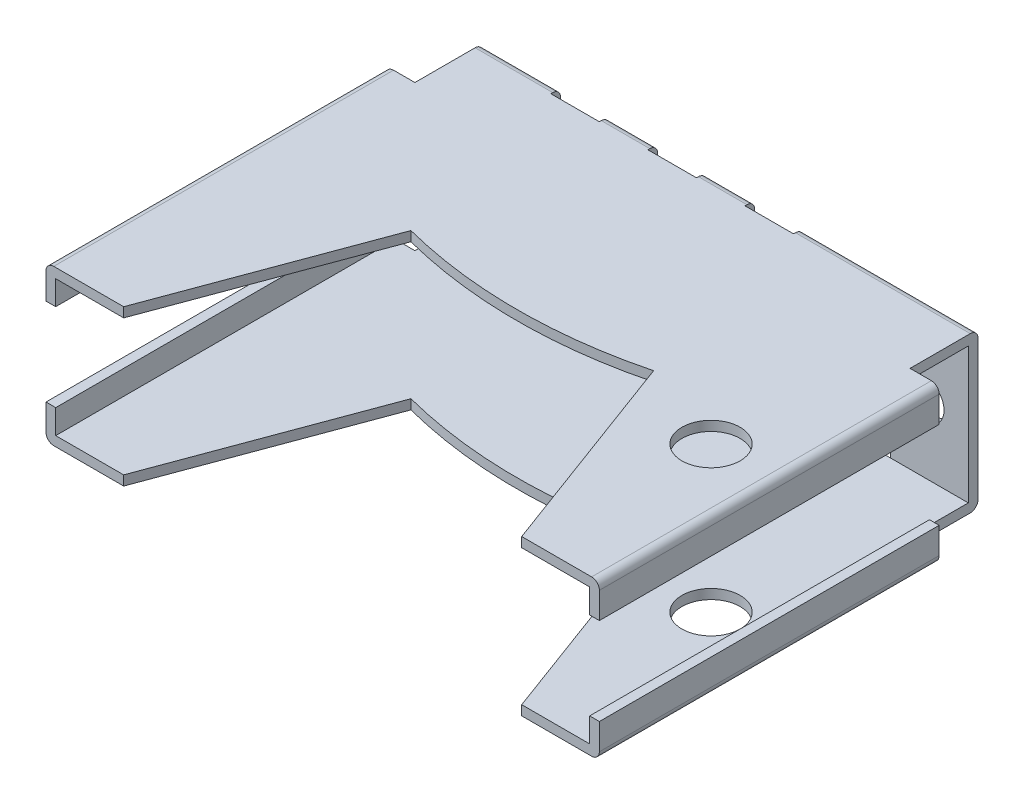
ISO-10303-21;
HEADER;
FILE_DESCRIPTION(('STEP AP214'),'2;1');
FILE_NAME('part.step','',(''),(''),'','','');
FILE_SCHEMA(('AUTOMOTIVE_DESIGN { 1 0 10303 214 1 1 1 1 }'));
ENDSEC;
DATA;
#1=APPLICATION_CONTEXT('core data for automotive mechanical design processes');
#2=APPLICATION_PROTOCOL_DEFINITION('international standard','automotive_design',2000,#1);
#3=PRODUCT_CONTEXT('',#1,'mechanical');
#4=PRODUCT('Part','Part','',(#3));
#5=PRODUCT_RELATED_PRODUCT_CATEGORY('part','',(#4));
#6=PRODUCT_DEFINITION_FORMATION('','',#4);
#7=PRODUCT_DEFINITION_CONTEXT('part definition',#1,'design');
#8=PRODUCT_DEFINITION('design','',#6,#7);
#9=PRODUCT_DEFINITION_SHAPE('','',#8);
#10=(LENGTH_UNIT() NAMED_UNIT(*) SI_UNIT(.MILLI.,.METRE.));
#11=(NAMED_UNIT(*) PLANE_ANGLE_UNIT() SI_UNIT($,.RADIAN.));
#12=(NAMED_UNIT(*) SI_UNIT($,.STERADIAN.) SOLID_ANGLE_UNIT());
#13=UNCERTAINTY_MEASURE_WITH_UNIT(LENGTH_MEASURE(1.E-05),#10,'distance_accuracy_value','');
#14=(GEOMETRIC_REPRESENTATION_CONTEXT(3) GLOBAL_UNCERTAINTY_ASSIGNED_CONTEXT((#13)) GLOBAL_UNIT_ASSIGNED_CONTEXT((#10,
#11,#12)) REPRESENTATION_CONTEXT('',''));
#15=CARTESIAN_POINT('',(0.,0.,0.));
#16=DIRECTION('',(0.,0.,1.));
#17=DIRECTION('',(1.,0.,0.));
#18=AXIS2_PLACEMENT_3D('',#15,#16,#17);
#19=CARTESIAN_POINT('',(-28.5,8.,0.));
#20=DIRECTION('',(0.,0.,1.));
#21=DIRECTION('',(1.,0.,0.));
#22=AXIS2_PLACEMENT_3D('',#19,#20,#21);
#23=PLANE('',#22);
#24=CARTESIAN_POINT('',(-10.,0.,0.));
#25=DIRECTION('',(0.,0.,1.));
#26=DIRECTION('',(1.,0.,0.));
#27=AXIS2_PLACEMENT_3D('',#24,#25,#26);
#28=CIRCLE('',#27,3.5);
#29=CARTESIAN_POINT('',(-6.5,0.,0.));
#30=VERTEX_POINT('',#29);
#31=EDGE_CURVE('E1201',#30,#30,#28,.F.);
#32=ORIENTED_EDGE('',*,*,#31,.F.);
#33=EDGE_LOOP('',(#32));
#34=FACE_BOUND('',#33,.T.);
#35=DIRECTION('',(0.,1.,0.));
#36=VECTOR('',#35,1.);
#37=CARTESIAN_POINT('',(-7.5,-3.,0.));
#38=LINE('',#37,#36);
#39=CARTESIAN_POINT('',(-7.5,-7.2,0.));
#40=VERTEX_POINT('',#39);
#41=CARTESIAN_POINT('',(-7.5,-3.,0.));
#42=VERTEX_POINT('',#41);
#43=EDGE_CURVE('E816',#40,#42,#38,.T.);
#44=ORIENTED_EDGE('',*,*,#43,.F.);
#45=DIRECTION('',(-1.,0.,0.));
#46=VECTOR('',#45,1.);
#47=CARTESIAN_POINT('',(-28.5,-7.2,0.));
#48=LINE('',#47,#46);
#49=CARTESIAN_POINT('',(-25.5,-7.2,0.));
#50=VERTEX_POINT('',#49);
#51=EDGE_CURVE('E1150',#40,#50,#48,.T.);
#52=ORIENTED_EDGE('',*,*,#51,.T.);
#53=DIRECTION('',(0.,1.,0.));
#54=VECTOR('',#53,1.);
#55=CARTESIAN_POINT('',(-25.5,-8.,0.));
#56=LINE('',#55,#54);
#57=CARTESIAN_POINT('',(-25.5,7.2,0.));
#58=VERTEX_POINT('',#57);
#59=EDGE_CURVE('E895',#50,#58,#56,.T.);
#60=ORIENTED_EDGE('',*,*,#59,.T.);
#61=DIRECTION('',(-1.,0.,0.));
#62=VECTOR('',#61,1.);
#63=CARTESIAN_POINT('',(-17.5,7.2,0.));
#64=LINE('',#63,#62);
#65=CARTESIAN_POINT('',(-17.5,7.2,0.));
#66=VERTEX_POINT('',#65);
#67=EDGE_CURVE('E1139',#58,#66,#64,.F.);
#68=ORIENTED_EDGE('',*,*,#67,.T.);
#69=DIRECTION('',(0.,1.,0.));
#70=VECTOR('',#69,1.);
#71=CARTESIAN_POINT('',(-17.5,8.,0.));
#72=LINE('',#71,#70);
#73=CARTESIAN_POINT('',(-17.5,3.,0.));
#74=VERTEX_POINT('',#73);
#75=EDGE_CURVE('E653',#74,#66,#72,.T.);
#76=ORIENTED_EDGE('',*,*,#75,.F.);
#77=DIRECTION('',(-1.,0.,0.));
#78=VECTOR('',#77,1.);
#79=CARTESIAN_POINT('',(-12.5,3.,0.));
#80=LINE('',#79,#78);
#81=CARTESIAN_POINT('',(-12.5,3.,0.));
#82=VERTEX_POINT('',#81);
#83=EDGE_CURVE('E657',#82,#74,#80,.T.);
#84=ORIENTED_EDGE('',*,*,#83,.F.);
#85=DIRECTION('',(0.,-1.,0.));
#86=VECTOR('',#85,1.);
#87=CARTESIAN_POINT('',(-12.5,8.,0.));
#88=LINE('',#87,#86);
#89=CARTESIAN_POINT('',(-12.5,7.2,0.));
#90=VERTEX_POINT('',#89);
#91=EDGE_CURVE('E652',#90,#82,#88,.T.);
#92=ORIENTED_EDGE('',*,*,#91,.F.);
#93=DIRECTION('',(-1.,0.,0.));
#94=VECTOR('',#93,1.);
#95=CARTESIAN_POINT('',(-7.5,7.2,0.));
#96=LINE('',#95,#94);
#97=CARTESIAN_POINT('',(-7.5,7.2,0.));
#98=VERTEX_POINT('',#97);
#99=EDGE_CURVE('E1137',#90,#98,#96,.F.);
#100=ORIENTED_EDGE('',*,*,#99,.T.);
#101=DIRECTION('',(0.,1.,0.));
#102=VECTOR('',#101,1.);
#103=CARTESIAN_POINT('',(-7.5,8.,0.));
#104=LINE('',#103,#102);
#105=CARTESIAN_POINT('',(-7.5,3.,0.));
#106=VERTEX_POINT('',#105);
#107=EDGE_CURVE('E685',#106,#98,#104,.T.);
#108=ORIENTED_EDGE('',*,*,#107,.F.);
#109=DIRECTION('',(-1.,0.,0.));
#110=VECTOR('',#109,1.);
#111=CARTESIAN_POINT('',(-2.5,3.,0.));
#112=LINE('',#111,#110);
#113=CARTESIAN_POINT('',(-2.5,3.,0.));
#114=VERTEX_POINT('',#113);
#115=EDGE_CURVE('E689',#114,#106,#112,.T.);
#116=ORIENTED_EDGE('',*,*,#115,.F.);
#117=DIRECTION('',(0.,-1.,0.));
#118=VECTOR('',#117,1.);
#119=CARTESIAN_POINT('',(-2.5,8.,0.));
#120=LINE('',#119,#118);
#121=CARTESIAN_POINT('',(-2.5,7.2,0.));
#122=VERTEX_POINT('',#121);
#123=EDGE_CURVE('E684',#122,#114,#120,.T.);
#124=ORIENTED_EDGE('',*,*,#123,.F.);
#125=DIRECTION('',(-1.,0.,0.));
#126=VECTOR('',#125,1.);
#127=CARTESIAN_POINT('',(2.5,7.2,0.));
#128=LINE('',#127,#126);
#129=CARTESIAN_POINT('',(2.5,7.2,0.));
#130=VERTEX_POINT('',#129);
#131=EDGE_CURVE('E1135',#122,#130,#128,.F.);
#132=ORIENTED_EDGE('',*,*,#131,.T.);
#133=DIRECTION('',(0.,1.,0.));
#134=VECTOR('',#133,1.);
#135=CARTESIAN_POINT('',(2.5,8.,0.));
#136=LINE('',#135,#134);
#137=CARTESIAN_POINT('',(2.5,3.,0.));
#138=VERTEX_POINT('',#137);
#139=EDGE_CURVE('E717',#138,#130,#136,.T.);
#140=ORIENTED_EDGE('',*,*,#139,.F.);
#141=DIRECTION('',(-1.,0.,0.));
#142=VECTOR('',#141,1.);
#143=CARTESIAN_POINT('',(7.5,3.,0.));
#144=LINE('',#143,#142);
#145=CARTESIAN_POINT('',(7.5,3.,0.));
#146=VERTEX_POINT('',#145);
#147=EDGE_CURVE('E721',#146,#138,#144,.T.);
#148=ORIENTED_EDGE('',*,*,#147,.F.);
#149=DIRECTION('',(0.,-1.,0.));
#150=VECTOR('',#149,1.);
#151=CARTESIAN_POINT('',(7.5,8.,0.));
#152=LINE('',#151,#150);
#153=CARTESIAN_POINT('',(7.5,7.2,0.));
#154=VERTEX_POINT('',#153);
#155=EDGE_CURVE('E716',#154,#146,#152,.T.);
#156=ORIENTED_EDGE('',*,*,#155,.F.);
#157=DIRECTION('',(-1.,0.,0.));
#158=VECTOR('',#157,1.);
#159=CARTESIAN_POINT('',(25.5,7.2,0.));
#160=LINE('',#159,#158);
#161=CARTESIAN_POINT('',(25.5,7.2,0.));
#162=VERTEX_POINT('',#161);
#163=EDGE_CURVE('E1133',#154,#162,#160,.F.);
#164=ORIENTED_EDGE('',*,*,#163,.T.);
#165=DIRECTION('',(0.,1.,0.));
#166=VECTOR('',#165,1.);
#167=CARTESIAN_POINT('',(25.5,-8.,0.));
#168=LINE('',#167,#166);
#169=CARTESIAN_POINT('',(25.5,-7.2,0.));
#170=VERTEX_POINT('',#169);
#171=EDGE_CURVE('E861',#170,#162,#168,.T.);
#172=ORIENTED_EDGE('',*,*,#171,.F.);
#173=DIRECTION('',(-1.,0.,0.));
#174=VECTOR('',#173,1.);
#175=CARTESIAN_POINT('',(-28.5,-7.2,0.));
#176=LINE('',#175,#174);
#177=CARTESIAN_POINT('',(17.5,-7.2,0.));
#178=VERTEX_POINT('',#177);
#179=EDGE_CURVE('E1141',#170,#178,#176,.T.);
#180=ORIENTED_EDGE('',*,*,#179,.T.);
#181=DIRECTION('',(0.,-1.,0.));
#182=VECTOR('',#181,1.);
#183=CARTESIAN_POINT('',(17.5,-3.,0.));
#184=LINE('',#183,#182);
#185=CARTESIAN_POINT('',(17.5,-3.,0.));
#186=VERTEX_POINT('',#185);
#187=EDGE_CURVE('E749',#186,#178,#184,.T.);
#188=ORIENTED_EDGE('',*,*,#187,.F.);
#189=DIRECTION('',(1.,0.,0.));
#190=VECTOR('',#189,1.);
#191=CARTESIAN_POINT('',(12.5,-3.,0.));
#192=LINE('',#191,#190);
#193=CARTESIAN_POINT('',(12.5,-3.,0.));
#194=VERTEX_POINT('',#193);
#195=EDGE_CURVE('E753',#194,#186,#192,.T.);
#196=ORIENTED_EDGE('',*,*,#195,.F.);
#197=DIRECTION('',(0.,1.,0.));
#198=VECTOR('',#197,1.);
#199=CARTESIAN_POINT('',(12.5,-3.,0.));
#200=LINE('',#199,#198);
#201=CARTESIAN_POINT('',(12.5,-7.2,0.));
#202=VERTEX_POINT('',#201);
#203=EDGE_CURVE('E748',#202,#194,#200,.T.);
#204=ORIENTED_EDGE('',*,*,#203,.F.);
#205=DIRECTION('',(-1.,0.,0.));
#206=VECTOR('',#205,1.);
#207=CARTESIAN_POINT('',(-28.5,-7.2,0.));
#208=LINE('',#207,#206);
#209=CARTESIAN_POINT('',(7.5,-7.2,0.));
#210=VERTEX_POINT('',#209);
#211=EDGE_CURVE('E1144',#202,#210,#208,.T.);
#212=ORIENTED_EDGE('',*,*,#211,.T.);
#213=DIRECTION('',(0.,-1.,0.));
#214=VECTOR('',#213,1.);
#215=CARTESIAN_POINT('',(7.5,-3.,0.));
#216=LINE('',#215,#214);
#217=CARTESIAN_POINT('',(7.5,-3.,0.));
#218=VERTEX_POINT('',#217);
#219=EDGE_CURVE('E781',#218,#210,#216,.T.);
#220=ORIENTED_EDGE('',*,*,#219,.F.);
#221=DIRECTION('',(1.,0.,0.));
#222=VECTOR('',#221,1.);
#223=CARTESIAN_POINT('',(2.5,-3.,0.));
#224=LINE('',#223,#222);
#225=CARTESIAN_POINT('',(2.5,-3.,0.));
#226=VERTEX_POINT('',#225);
#227=EDGE_CURVE('E785',#226,#218,#224,.T.);
#228=ORIENTED_EDGE('',*,*,#227,.F.);
#229=DIRECTION('',(0.,1.,0.));
#230=VECTOR('',#229,1.);
#231=CARTESIAN_POINT('',(2.5,-3.,0.));
#232=LINE('',#231,#230);
#233=CARTESIAN_POINT('',(2.5,-7.2,0.));
#234=VERTEX_POINT('',#233);
#235=EDGE_CURVE('E780',#234,#226,#232,.T.);
#236=ORIENTED_EDGE('',*,*,#235,.F.);
#237=DIRECTION('',(-1.,0.,0.));
#238=VECTOR('',#237,1.);
#239=CARTESIAN_POINT('',(-28.5,-7.2,0.));
#240=LINE('',#239,#238);
#241=CARTESIAN_POINT('',(-2.5,-7.2,0.));
#242=VERTEX_POINT('',#241);
#243=EDGE_CURVE('E1147',#234,#242,#240,.T.);
#244=ORIENTED_EDGE('',*,*,#243,.T.);
#245=DIRECTION('',(0.,-1.,0.));
#246=VECTOR('',#245,1.);
#247=CARTESIAN_POINT('',(-2.5,-3.,0.));
#248=LINE('',#247,#246);
#249=CARTESIAN_POINT('',(-2.5,-3.,0.));
#250=VERTEX_POINT('',#249);
#251=EDGE_CURVE('E812',#250,#242,#248,.T.);
#252=ORIENTED_EDGE('',*,*,#251,.F.);
#253=DIRECTION('',(1.,0.,0.));
#254=VECTOR('',#253,1.);
#255=CARTESIAN_POINT('',(-2.5,-3.,0.));
#256=LINE('',#255,#254);
#257=EDGE_CURVE('E813',#42,#250,#256,.T.);
#258=ORIENTED_EDGE('',*,*,#257,.F.);
#259=EDGE_LOOP('',(#44,#52,#60,#68,#76,#84,#92,#100,#108,#116,#124,#132,#140,#148,#156,#164,
#172,#180,#188,#196,#204,#212,#220,#228,#236,#244,#252,#258));
#260=FACE_BOUND('',#259,.T.);
#261=CARTESIAN_POINT('',(21.,0.,0.));
#262=DIRECTION('',(0.,0.,-1.));
#263=DIRECTION('',(-1.,0.,0.));
#264=AXIS2_PLACEMENT_3D('',#261,#262,#263);
#265=CIRCLE('',#264,2.);
#266=CARTESIAN_POINT('',(19.,0.,0.));
#267=VERTEX_POINT('',#266);
#268=EDGE_CURVE('E646',#267,#267,#265,.T.);
#269=ORIENTED_EDGE('',*,*,#268,.F.);
#270=EDGE_LOOP('',(#269));
#271=FACE_BOUND('',#270,.T.);
#272=CARTESIAN_POINT('',(-21.,0.,0.));
#273=DIRECTION('',(0.,0.,-1.));
#274=DIRECTION('',(-1.,0.,0.));
#275=AXIS2_PLACEMENT_3D('',#272,#273,#274);
#276=CIRCLE('',#275,2.);
#277=CARTESIAN_POINT('',(-23.,0.,0.));
#278=VERTEX_POINT('',#277);
#279=EDGE_CURVE('E640',#278,#278,#276,.T.);
#280=ORIENTED_EDGE('',*,*,#279,.F.);
#281=EDGE_LOOP('',(#280));
#282=FACE_BOUND('',#281,.T.);
#283=CARTESIAN_POINT('',(10.,0.,0.));
#284=DIRECTION('',(0.,0.,1.));
#285=DIRECTION('',(1.,0.,0.));
#286=AXIS2_PLACEMENT_3D('',#283,#284,#285);
#287=CIRCLE('',#286,3.5);
#288=CARTESIAN_POINT('',(13.5,0.,0.));
#289=VERTEX_POINT('',#288);
#290=EDGE_CURVE('E1198',#289,#289,#287,.F.);
#291=ORIENTED_EDGE('',*,*,#290,.F.);
#292=EDGE_LOOP('',(#291));
#293=FACE_BOUND('',#292,.T.);
#294=CARTESIAN_POINT('',(0.,0.,0.));
#295=DIRECTION('',(0.,0.,-1.));
#296=DIRECTION('',(-1.,0.,0.));
#297=AXIS2_PLACEMENT_3D('',#294,#295,#296);
#298=CIRCLE('',#297,3.5);
#299=CARTESIAN_POINT('',(1.80277563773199,3.,0.));
#300=VERTEX_POINT('',#299);
#301=CARTESIAN_POINT('',(1.80277563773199,-3.,0.));
#302=VERTEX_POINT('',#301);
#303=EDGE_CURVE('E609',#300,#302,#298,.T.);
#304=ORIENTED_EDGE('',*,*,#303,.F.);
#305=DIRECTION('',(1.,0.,0.));
#306=VECTOR('',#305,1.);
#307=CARTESIAN_POINT('',(1.80277563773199,3.,0.));
#308=LINE('',#307,#306);
#309=CARTESIAN_POINT('',(-1.80277563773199,3.,0.));
#310=VERTEX_POINT('',#309);
#311=EDGE_CURVE('E617',#310,#300,#308,.T.);
#312=ORIENTED_EDGE('',*,*,#311,.F.);
#313=CARTESIAN_POINT('',(0.,0.,0.));
#314=DIRECTION('',(0.,0.,-1.));
#315=DIRECTION('',(-1.,0.,0.));
#316=AXIS2_PLACEMENT_3D('',#313,#314,#315);
#317=CIRCLE('',#316,3.5);
#318=CARTESIAN_POINT('',(-1.80277563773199,-3.,0.));
#319=VERTEX_POINT('',#318);
#320=EDGE_CURVE('E630',#319,#310,#317,.T.);
#321=ORIENTED_EDGE('',*,*,#320,.F.);
#322=DIRECTION('',(-1.,0.,0.));
#323=VECTOR('',#322,1.);
#324=CARTESIAN_POINT('',(1.80277563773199,-3.,0.));
#325=LINE('',#324,#323);
#326=EDGE_CURVE('E625',#302,#319,#325,.T.);
#327=ORIENTED_EDGE('',*,*,#326,.F.);
#328=EDGE_LOOP('',(#304,#312,#321,#327));
#329=FACE_BOUND('',#328,.T.);
#330=ADVANCED_FACE('F64',(#34,#260,#271,#282,#293,#329),#23,.F.);
#331=CARTESIAN_POINT('',(28.5,8.,0.));
#332=DIRECTION('',(-1.,0.,0.));
#333=DIRECTION('',(0.,0.,1.));
#334=AXIS2_PLACEMENT_3D('',#331,#332,#333);
#335=PLANE('',#334);
#336=DIRECTION('',(0.,-1.,0.));
#337=VECTOR('',#336,1.);
#338=CARTESIAN_POINT('',(28.5,8.,42.));
#339=LINE('',#338,#337);
#340=CARTESIAN_POINT('',(28.5,-4.5,42.));
#341=VERTEX_POINT('',#340);
#342=CARTESIAN_POINT('',(28.5,-7.2,42.));
#343=VERTEX_POINT('',#342);
#344=EDGE_CURVE('E1049',#341,#343,#339,.T.);
#345=ORIENTED_EDGE('',*,*,#344,.T.);
#346=DIRECTION('',(0.,0.,-1.));
#347=VECTOR('',#346,1.);
#348=CARTESIAN_POINT('',(28.5,-7.2,0.));
#349=LINE('',#348,#347);
#350=CARTESIAN_POINT('',(28.5,-7.2,7.00000000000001));
#351=VERTEX_POINT('',#350);
#352=EDGE_CURVE('E1185',#343,#351,#349,.T.);
#353=ORIENTED_EDGE('',*,*,#352,.T.);
#354=DIRECTION('',(0.,1.,0.));
#355=VECTOR('',#354,1.);
#356=CARTESIAN_POINT('',(28.5,-8.,7.00000000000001));
#357=LINE('',#356,#355);
#358=CARTESIAN_POINT('',(28.5,-4.5,7.00000000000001));
#359=VERTEX_POINT('',#358);
#360=EDGE_CURVE('E855',#351,#359,#357,.T.);
#361=ORIENTED_EDGE('',*,*,#360,.T.);
#362=DIRECTION('',(0.,0.,1.));
#363=VECTOR('',#362,1.);
#364=CARTESIAN_POINT('',(28.5,-4.5,-58.6941223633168));
#365=LINE('',#364,#363);
#366=EDGE_CURVE('E1031',#359,#341,#365,.T.);
#367=ORIENTED_EDGE('',*,*,#366,.T.);
#368=EDGE_LOOP('',(#345,#353,#361,#367));
#369=FACE_BOUND('',#368,.T.);
#370=ADVANCED_FACE('F1390',(#369),#335,.F.);
#371=CARTESIAN_POINT('',(-28.5,8.,42.));
#372=DIRECTION('',(0.,1.,0.));
#373=DIRECTION('',(0.,0.,1.));
#374=AXIS2_PLACEMENT_3D('',#371,#372,#373);
#375=PLANE('',#374);
#376=DIRECTION('',(1.,0.,0.));
#377=VECTOR('',#376,1.);
#378=CARTESIAN_POINT('',(-28.5,8.,7.));
#379=LINE('',#378,#377);
#380=CARTESIAN_POINT('',(-27.7,8.,7.));
#381=VERTEX_POINT('',#380);
#382=CARTESIAN_POINT('',(-25.5,8.,7.));
#383=VERTEX_POINT('',#382);
#384=EDGE_CURVE('E913',#381,#383,#379,.T.);
#385=ORIENTED_EDGE('',*,*,#384,.F.);
#386=DIRECTION('',(0.,0.,1.));
#387=VECTOR('',#386,1.);
#388=CARTESIAN_POINT('',(-27.7,8.,42.));
#389=LINE('',#388,#387);
#390=CARTESIAN_POINT('',(-27.7,8.,42.));
#391=VERTEX_POINT('',#390);
#392=EDGE_CURVE('E1124',#381,#391,#389,.T.);
#393=ORIENTED_EDGE('',*,*,#392,.T.);
#394=DIRECTION('',(1.,0.,0.));
#395=VECTOR('',#394,1.);
#396=CARTESIAN_POINT('',(-28.5,8.,42.));
#397=LINE('',#396,#395);
#398=CARTESIAN_POINT('',(-20.5,8.,42.));
#399=VERTEX_POINT('',#398);
#400=EDGE_CURVE('E1047',#391,#399,#397,.T.);
#401=ORIENTED_EDGE('',*,*,#400,.T.);
#402=DIRECTION('',(0.347488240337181,0.,-0.937684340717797));
#403=VECTOR('',#402,1.);
#404=CARTESIAN_POINT('',(-20.5,8.,42.));
#405=LINE('',#404,#403);
#406=CARTESIAN_POINT('',(-12.5,8.,20.4122918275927));
#407=VERTEX_POINT('',#406);
#408=EDGE_CURVE('E935',#399,#407,#405,.T.);
#409=ORIENTED_EDGE('',*,*,#408,.T.);
#410=CARTESIAN_POINT('',(0.,8.,-28.));
#411=DIRECTION('',(0.,1.,0.));
#412=DIRECTION('',(0.,0.,1.));
#413=AXIS2_PLACEMENT_3D('',#410,#411,#412);
#414=CIRCLE('',#413,50.);
#415=CARTESIAN_POINT('',(12.5,8.,20.4122918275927));
#416=VERTEX_POINT('',#415);
#417=EDGE_CURVE('E938',#407,#416,#414,.T.);
#418=ORIENTED_EDGE('',*,*,#417,.T.);
#419=DIRECTION('',(-0.347488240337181,0.,-0.937684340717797));
#420=VECTOR('',#419,1.);
#421=CARTESIAN_POINT('',(20.5,8.,42.));
#422=LINE('',#421,#420);
#423=CARTESIAN_POINT('',(20.5,8.,42.));
#424=VERTEX_POINT('',#423);
#425=EDGE_CURVE('E941',#424,#416,#422,.T.);
#426=ORIENTED_EDGE('',*,*,#425,.F.);
#427=CARTESIAN_POINT('',(27.7,8.,42.));
#428=VERTEX_POINT('',#427);
#429=EDGE_CURVE('E1050',#424,#428,#397,.T.);
#430=ORIENTED_EDGE('',*,*,#429,.T.);
#431=DIRECTION('',(0.,0.,-1.));
#432=VECTOR('',#431,1.);
#433=CARTESIAN_POINT('',(27.7,8.,7.00000000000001));
#434=LINE('',#433,#432);
#435=CARTESIAN_POINT('',(27.7,8.,7.));
#436=VERTEX_POINT('',#435);
#437=EDGE_CURVE('E1109',#428,#436,#434,.T.);
#438=ORIENTED_EDGE('',*,*,#437,.T.);
#439=DIRECTION('',(1.,0.,0.));
#440=VECTOR('',#439,1.);
#441=CARTESIAN_POINT('',(25.5,8.,7.));
#442=LINE('',#441,#440);
#443=CARTESIAN_POINT('',(25.5,8.,7.));
#444=VERTEX_POINT('',#443);
#445=EDGE_CURVE('E871',#444,#436,#442,.T.);
#446=ORIENTED_EDGE('',*,*,#445,.F.);
#447=DIRECTION('',(0.,0.,1.));
#448=VECTOR('',#447,1.);
#449=CARTESIAN_POINT('',(25.5,8.,0.));
#450=LINE('',#449,#448);
#451=CARTESIAN_POINT('',(25.5,8.,0.800000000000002));
#452=VERTEX_POINT('',#451);
#453=EDGE_CURVE('E869',#452,#444,#450,.T.);
#454=ORIENTED_EDGE('',*,*,#453,.F.);
#455=DIRECTION('',(-1.,0.,0.));
#456=VECTOR('',#455,1.);
#457=CARTESIAN_POINT('',(7.5,8.,0.800000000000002));
#458=LINE('',#457,#456);
#459=CARTESIAN_POINT('',(7.5,8.,0.800000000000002));
#460=VERTEX_POINT('',#459);
#461=EDGE_CURVE('E1112',#452,#460,#458,.T.);
#462=ORIENTED_EDGE('',*,*,#461,.T.);
#463=DIRECTION('',(0.,0.,-1.));
#464=VECTOR('',#463,1.);
#465=CARTESIAN_POINT('',(7.5,8.,8.07106781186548));
#466=LINE('',#465,#464);
#467=CARTESIAN_POINT('',(7.5,8.,1.));
#468=VERTEX_POINT('',#467);
#469=EDGE_CURVE('E732',#468,#460,#466,.T.);
#470=ORIENTED_EDGE('',*,*,#469,.F.);
#471=DIRECTION('',(1.,0.,0.));
#472=VECTOR('',#471,1.);
#473=CARTESIAN_POINT('',(7.5,8.,1.));
#474=LINE('',#473,#472);
#475=CARTESIAN_POINT('',(2.5,8.,1.));
#476=VERTEX_POINT('',#475);
#477=EDGE_CURVE('E733',#476,#468,#474,.T.);
#478=ORIENTED_EDGE('',*,*,#477,.F.);
#479=DIRECTION('',(0.,0.,-1.));
#480=VECTOR('',#479,1.);
#481=CARTESIAN_POINT('',(2.5,8.,8.07106781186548));
#482=LINE('',#481,#480);
#483=CARTESIAN_POINT('',(2.5,8.,0.800000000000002));
#484=VERTEX_POINT('',#483);
#485=EDGE_CURVE('E736',#476,#484,#482,.T.);
#486=ORIENTED_EDGE('',*,*,#485,.T.);
#487=DIRECTION('',(-1.,0.,0.));
#488=VECTOR('',#487,1.);
#489=CARTESIAN_POINT('',(-2.5,8.,0.800000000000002));
#490=LINE('',#489,#488);
#491=CARTESIAN_POINT('',(-2.5,8.,0.800000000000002));
#492=VERTEX_POINT('',#491);
#493=EDGE_CURVE('E1115',#484,#492,#490,.T.);
#494=ORIENTED_EDGE('',*,*,#493,.T.);
#495=DIRECTION('',(0.,0.,-1.));
#496=VECTOR('',#495,1.);
#497=CARTESIAN_POINT('',(-2.5,8.,8.07106781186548));
#498=LINE('',#497,#496);
#499=CARTESIAN_POINT('',(-2.5,8.,1.));
#500=VERTEX_POINT('',#499);
#501=EDGE_CURVE('E700',#500,#492,#498,.T.);
#502=ORIENTED_EDGE('',*,*,#501,.F.);
#503=DIRECTION('',(1.,0.,0.));
#504=VECTOR('',#503,1.);
#505=CARTESIAN_POINT('',(-2.5,8.,1.));
#506=LINE('',#505,#504);
#507=CARTESIAN_POINT('',(-7.5,8.,1.));
#508=VERTEX_POINT('',#507);
#509=EDGE_CURVE('E701',#508,#500,#506,.T.);
#510=ORIENTED_EDGE('',*,*,#509,.F.);
#511=DIRECTION('',(0.,0.,-1.));
#512=VECTOR('',#511,1.);
#513=CARTESIAN_POINT('',(-7.5,8.,8.07106781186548));
#514=LINE('',#513,#512);
#515=CARTESIAN_POINT('',(-7.5,8.,0.800000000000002));
#516=VERTEX_POINT('',#515);
#517=EDGE_CURVE('E704',#508,#516,#514,.T.);
#518=ORIENTED_EDGE('',*,*,#517,.T.);
#519=DIRECTION('',(-1.,0.,0.));
#520=VECTOR('',#519,1.);
#521=CARTESIAN_POINT('',(-12.5,8.,0.800000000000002));
#522=LINE('',#521,#520);
#523=CARTESIAN_POINT('',(-12.5,8.,0.800000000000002));
#524=VERTEX_POINT('',#523);
#525=EDGE_CURVE('E1118',#516,#524,#522,.T.);
#526=ORIENTED_EDGE('',*,*,#525,.T.);
#527=DIRECTION('',(0.,0.,-1.));
#528=VECTOR('',#527,1.);
#529=CARTESIAN_POINT('',(-12.5,8.,8.07106781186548));
#530=LINE('',#529,#528);
#531=CARTESIAN_POINT('',(-12.5,8.,1.));
#532=VERTEX_POINT('',#531);
#533=EDGE_CURVE('E668',#532,#524,#530,.T.);
#534=ORIENTED_EDGE('',*,*,#533,.F.);
#535=DIRECTION('',(1.,0.,0.));
#536=VECTOR('',#535,1.);
#537=CARTESIAN_POINT('',(-12.5,8.,1.));
#538=LINE('',#537,#536);
#539=CARTESIAN_POINT('',(-17.5,8.,1.));
#540=VERTEX_POINT('',#539);
#541=EDGE_CURVE('E669',#540,#532,#538,.T.);
#542=ORIENTED_EDGE('',*,*,#541,.F.);
#543=DIRECTION('',(0.,0.,-1.));
#544=VECTOR('',#543,1.);
#545=CARTESIAN_POINT('',(-17.5,8.,8.07106781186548));
#546=LINE('',#545,#544);
#547=CARTESIAN_POINT('',(-17.5,8.,0.800000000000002));
#548=VERTEX_POINT('',#547);
#549=EDGE_CURVE('E672',#540,#548,#546,.T.);
#550=ORIENTED_EDGE('',*,*,#549,.T.);
#551=DIRECTION('',(-1.,0.,0.));
#552=VECTOR('',#551,1.);
#553=CARTESIAN_POINT('',(-25.5,8.,0.800000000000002));
#554=LINE('',#553,#552);
#555=CARTESIAN_POINT('',(-25.5,8.,0.800000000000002));
#556=VERTEX_POINT('',#555);
#557=EDGE_CURVE('E1121',#548,#556,#554,.T.);
#558=ORIENTED_EDGE('',*,*,#557,.T.);
#559=DIRECTION('',(0.,0.,1.));
#560=VECTOR('',#559,1.);
#561=CARTESIAN_POINT('',(-25.5,8.,0.));
#562=LINE('',#561,#560);
#563=EDGE_CURVE('E910',#556,#383,#562,.T.);
#564=ORIENTED_EDGE('',*,*,#563,.T.);
#565=EDGE_LOOP('',(#385,#393,#401,#409,#418,#426,#430,#438,#446,#454,#462,#470,#478,#486,#494,
#502,#510,#518,#526,#534,#542,#550,#558,#564));
#566=FACE_BOUND('',#565,.T.);
#567=CARTESIAN_POINT('',(22.,8.,24.));
#568=DIRECTION('',(0.,1.,0.));
#569=DIRECTION('',(0.,0.,1.));
#570=AXIS2_PLACEMENT_3D('',#567,#568,#569);
#571=CIRCLE('',#570,3.);
#572=CARTESIAN_POINT('',(22.,8.,27.));
#573=VERTEX_POINT('',#572);
#574=EDGE_CURVE('E847',#573,#573,#571,.T.);
#575=ORIENTED_EDGE('',*,*,#574,.F.);
#576=EDGE_LOOP('',(#575));
#577=FACE_BOUND('',#576,.T.);
#578=ADVANCED_FACE('F1396',(#566,#577),#375,.T.);
#579=CARTESIAN_POINT('',(-28.5,-8.,42.));
#580=DIRECTION('',(0.,1.,0.));
#581=DIRECTION('',(0.,0.,1.));
#582=AXIS2_PLACEMENT_3D('',#579,#580,#581);
#583=PLANE('',#582);
#584=CARTESIAN_POINT('',(22.,-8.,24.));
#585=DIRECTION('',(0.,1.,0.));
#586=DIRECTION('',(0.,0.,1.));
#587=AXIS2_PLACEMENT_3D('',#584,#585,#586);
#588=CIRCLE('',#587,3.);
#589=CARTESIAN_POINT('',(22.,-8.,27.));
#590=VERTEX_POINT('',#589);
#591=EDGE_CURVE('E844',#590,#590,#588,.T.);
#592=ORIENTED_EDGE('',*,*,#591,.T.);
#593=EDGE_LOOP('',(#592));
#594=FACE_BOUND('',#593,.T.);
#595=DIRECTION('',(1.,0.,0.));
#596=VECTOR('',#595,1.);
#597=CARTESIAN_POINT('',(-28.5,-8.,42.));
#598=LINE('',#597,#596);
#599=CARTESIAN_POINT('',(-27.7,-8.,42.));
#600=VERTEX_POINT('',#599);
#601=CARTESIAN_POINT('',(-20.5,-8.,42.));
#602=VERTEX_POINT('',#601);
#603=EDGE_CURVE('E1051',#600,#602,#598,.T.);
#604=ORIENTED_EDGE('',*,*,#603,.F.);
#605=DIRECTION('',(0.,0.,1.));
#606=VECTOR('',#605,1.);
#607=CARTESIAN_POINT('',(-27.7,-8.,42.));
#608=LINE('',#607,#606);
#609=CARTESIAN_POINT('',(-27.7,-8.,7.));
#610=VERTEX_POINT('',#609);
#611=EDGE_CURVE('E1105',#600,#610,#608,.F.);
#612=ORIENTED_EDGE('',*,*,#611,.T.);
#613=DIRECTION('',(1.,0.,0.));
#614=VECTOR('',#613,1.);
#615=CARTESIAN_POINT('',(-28.5,-8.,7.));
#616=LINE('',#615,#614);
#617=CARTESIAN_POINT('',(-25.5,-8.,7.));
#618=VERTEX_POINT('',#617);
#619=EDGE_CURVE('E907',#610,#618,#616,.T.);
#620=ORIENTED_EDGE('',*,*,#619,.T.);
#621=DIRECTION('',(0.,0.,1.));
#622=VECTOR('',#621,1.);
#623=CARTESIAN_POINT('',(-25.5,-8.,0.));
#624=LINE('',#623,#622);
#625=CARTESIAN_POINT('',(-25.5,-8.,0.8));
#626=VERTEX_POINT('',#625);
#627=EDGE_CURVE('E898',#626,#618,#624,.T.);
#628=ORIENTED_EDGE('',*,*,#627,.F.);
#629=DIRECTION('',(-1.,0.,0.));
#630=VECTOR('',#629,1.);
#631=CARTESIAN_POINT('',(-28.5,-8.,0.800000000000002));
#632=LINE('',#631,#630);
#633=CARTESIAN_POINT('',(-7.5,-8.,0.8));
#634=VERTEX_POINT('',#633);
#635=EDGE_CURVE('E1103',#626,#634,#632,.F.);
#636=ORIENTED_EDGE('',*,*,#635,.T.);
#637=DIRECTION('',(0.,0.,-1.));
#638=VECTOR('',#637,1.);
#639=CARTESIAN_POINT('',(-7.5,-8.,8.07106781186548));
#640=LINE('',#639,#638);
#641=CARTESIAN_POINT('',(-7.5,-8.,1.));
#642=VERTEX_POINT('',#641);
#643=EDGE_CURVE('E822',#642,#634,#640,.T.);
#644=ORIENTED_EDGE('',*,*,#643,.F.);
#645=DIRECTION('',(-1.,0.,0.));
#646=VECTOR('',#645,1.);
#647=CARTESIAN_POINT('',(-2.5,-8.,1.));
#648=LINE('',#647,#646);
#649=CARTESIAN_POINT('',(-2.5,-8.,1.));
#650=VERTEX_POINT('',#649);
#651=EDGE_CURVE('E815',#650,#642,#648,.T.);
#652=ORIENTED_EDGE('',*,*,#651,.F.);
#653=DIRECTION('',(0.,0.,-1.));
#654=VECTOR('',#653,1.);
#655=CARTESIAN_POINT('',(-2.5,-8.,8.07106781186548));
#656=LINE('',#655,#654);
#657=CARTESIAN_POINT('',(-2.5,-8.,0.8));
#658=VERTEX_POINT('',#657);
#659=EDGE_CURVE('E826',#650,#658,#656,.T.);
#660=ORIENTED_EDGE('',*,*,#659,.T.);
#661=DIRECTION('',(-1.,0.,0.));
#662=VECTOR('',#661,1.);
#663=CARTESIAN_POINT('',(-28.5,-8.,0.800000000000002));
#664=LINE('',#663,#662);
#665=CARTESIAN_POINT('',(2.5,-8.,0.8));
#666=VERTEX_POINT('',#665);
#667=EDGE_CURVE('E1101',#658,#666,#664,.F.);
#668=ORIENTED_EDGE('',*,*,#667,.T.);
#669=DIRECTION('',(0.,0.,-1.));
#670=VECTOR('',#669,1.);
#671=CARTESIAN_POINT('',(2.5,-8.,8.07106781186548));
#672=LINE('',#671,#670);
#673=CARTESIAN_POINT('',(2.5,-8.,1.));
#674=VERTEX_POINT('',#673);
#675=EDGE_CURVE('E796',#674,#666,#672,.T.);
#676=ORIENTED_EDGE('',*,*,#675,.F.);
#677=DIRECTION('',(-1.,0.,0.));
#678=VECTOR('',#677,1.);
#679=CARTESIAN_POINT('',(2.5,-8.,1.));
#680=LINE('',#679,#678);
#681=CARTESIAN_POINT('',(7.5,-8.,1.));
#682=VERTEX_POINT('',#681);
#683=EDGE_CURVE('E797',#682,#674,#680,.T.);
#684=ORIENTED_EDGE('',*,*,#683,.F.);
#685=DIRECTION('',(0.,0.,-1.));
#686=VECTOR('',#685,1.);
#687=CARTESIAN_POINT('',(7.5,-8.,8.07106781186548));
#688=LINE('',#687,#686);
#689=CARTESIAN_POINT('',(7.5,-8.,0.8));
#690=VERTEX_POINT('',#689);
#691=EDGE_CURVE('E800',#682,#690,#688,.T.);
#692=ORIENTED_EDGE('',*,*,#691,.T.);
#693=DIRECTION('',(-1.,0.,0.));
#694=VECTOR('',#693,1.);
#695=CARTESIAN_POINT('',(-28.5,-8.,0.800000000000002));
#696=LINE('',#695,#694);
#697=CARTESIAN_POINT('',(12.5,-8.,0.8));
#698=VERTEX_POINT('',#697);
#699=EDGE_CURVE('E1099',#690,#698,#696,.F.);
#700=ORIENTED_EDGE('',*,*,#699,.T.);
#701=DIRECTION('',(0.,0.,-1.));
#702=VECTOR('',#701,1.);
#703=CARTESIAN_POINT('',(12.5,-8.,8.07106781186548));
#704=LINE('',#703,#702);
#705=CARTESIAN_POINT('',(12.5,-8.,1.));
#706=VERTEX_POINT('',#705);
#707=EDGE_CURVE('E764',#706,#698,#704,.T.);
#708=ORIENTED_EDGE('',*,*,#707,.F.);
#709=DIRECTION('',(-1.,0.,0.));
#710=VECTOR('',#709,1.);
#711=CARTESIAN_POINT('',(12.5,-8.,1.));
#712=LINE('',#711,#710);
#713=CARTESIAN_POINT('',(17.5,-8.,1.));
#714=VERTEX_POINT('',#713);
#715=EDGE_CURVE('E765',#714,#706,#712,.T.);
#716=ORIENTED_EDGE('',*,*,#715,.F.);
#717=DIRECTION('',(0.,0.,-1.));
#718=VECTOR('',#717,1.);
#719=CARTESIAN_POINT('',(17.5,-8.,8.07106781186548));
#720=LINE('',#719,#718);
#721=CARTESIAN_POINT('',(17.5,-8.,0.8));
#722=VERTEX_POINT('',#721);
#723=EDGE_CURVE('E768',#714,#722,#720,.T.);
#724=ORIENTED_EDGE('',*,*,#723,.T.);
#725=DIRECTION('',(-1.,0.,0.));
#726=VECTOR('',#725,1.);
#727=CARTESIAN_POINT('',(-28.5,-8.,0.800000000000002));
#728=LINE('',#727,#726);
#729=CARTESIAN_POINT('',(25.5,-8.,0.8));
#730=VERTEX_POINT('',#729);
#731=EDGE_CURVE('E1097',#722,#730,#728,.F.);
#732=ORIENTED_EDGE('',*,*,#731,.T.);
#733=DIRECTION('',(0.,0.,1.));
#734=VECTOR('',#733,1.);
#735=CARTESIAN_POINT('',(25.5,-8.,0.));
#736=LINE('',#735,#734);
#737=CARTESIAN_POINT('',(25.5,-8.,7.));
#738=VERTEX_POINT('',#737);
#739=EDGE_CURVE('E864',#730,#738,#736,.T.);
#740=ORIENTED_EDGE('',*,*,#739,.T.);
#741=DIRECTION('',(1.,0.,0.));
#742=VECTOR('',#741,1.);
#743=CARTESIAN_POINT('',(25.5,-8.,7.));
#744=LINE('',#743,#742);
#745=CARTESIAN_POINT('',(27.7,-8.,7.));
#746=VERTEX_POINT('',#745);
#747=EDGE_CURVE('E866',#738,#746,#744,.T.);
#748=ORIENTED_EDGE('',*,*,#747,.T.);
#749=DIRECTION('',(0.,0.,-1.));
#750=VECTOR('',#749,1.);
#751=CARTESIAN_POINT('',(27.7,-8.,42.));
#752=LINE('',#751,#750);
#753=CARTESIAN_POINT('',(27.7,-8.,42.));
#754=VERTEX_POINT('',#753);
#755=EDGE_CURVE('E1095',#746,#754,#752,.F.);
#756=ORIENTED_EDGE('',*,*,#755,.T.);
#757=CARTESIAN_POINT('',(20.5,-8.,42.));
#758=VERTEX_POINT('',#757);
#759=EDGE_CURVE('E985',#758,#754,#598,.T.);
#760=ORIENTED_EDGE('',*,*,#759,.F.);
#761=DIRECTION('',(-0.347488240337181,0.,-0.937684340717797));
#762=VECTOR('',#761,1.);
#763=CARTESIAN_POINT('',(20.5,-8.,42.));
#764=LINE('',#763,#762);
#765=CARTESIAN_POINT('',(12.5,-8.,20.4122918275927));
#766=VERTEX_POINT('',#765);
#767=EDGE_CURVE('E948',#758,#766,#764,.T.);
#768=ORIENTED_EDGE('',*,*,#767,.T.);
#769=CARTESIAN_POINT('',(0.,-8.,-28.));
#770=DIRECTION('',(0.,1.,0.));
#771=DIRECTION('',(0.,0.,1.));
#772=AXIS2_PLACEMENT_3D('',#769,#770,#771);
#773=CIRCLE('',#772,50.);
#774=CARTESIAN_POINT('',(-12.5,-8.,20.4122918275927));
#775=VERTEX_POINT('',#774);
#776=EDGE_CURVE('E946',#775,#766,#773,.T.);
#777=ORIENTED_EDGE('',*,*,#776,.F.);
#778=DIRECTION('',(0.347488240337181,0.,-0.937684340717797));
#779=VECTOR('',#778,1.);
#780=CARTESIAN_POINT('',(-20.5,-8.,42.));
#781=LINE('',#780,#779);
#782=EDGE_CURVE('E944',#602,#775,#781,.T.);
#783=ORIENTED_EDGE('',*,*,#782,.F.);
#784=EDGE_LOOP('',(#604,#612,#620,#628,#636,#644,#652,#660,#668,#676,#684,#692,#700,#708,#716,
#724,#732,#740,#748,#756,#760,#768,#777,#783));
#785=FACE_BOUND('',#784,.T.);
#786=ADVANCED_FACE('F1403',(#594,#785),#583,.F.);
#787=CARTESIAN_POINT('',(27.5,7.,-58.6941223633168));
#788=DIRECTION('',(0.,1.,0.));
#789=DIRECTION('',(0.,0.,1.));
#790=AXIS2_PLACEMENT_3D('',#787,#788,#789);
#791=PLANE('',#790);
#792=CARTESIAN_POINT('',(22.,7.,24.));
#793=DIRECTION('',(0.,1.,0.));
#794=DIRECTION('',(0.,0.,1.));
#795=AXIS2_PLACEMENT_3D('',#792,#793,#794);
#796=CIRCLE('',#795,3.);
#797=CARTESIAN_POINT('',(22.,7.,27.));
#798=VERTEX_POINT('',#797);
#799=EDGE_CURVE('E851',#798,#798,#796,.T.);
#800=ORIENTED_EDGE('',*,*,#799,.T.);
#801=EDGE_LOOP('',(#800));
#802=FACE_BOUND('',#801,.T.);
#803=DIRECTION('',(0.,0.,1.));
#804=VECTOR('',#803,1.);
#805=CARTESIAN_POINT('',(25.5,7.,-58.6941223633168));
#806=LINE('',#805,#804);
#807=CARTESIAN_POINT('',(25.5,7.,1.));
#808=VERTEX_POINT('',#807);
#809=CARTESIAN_POINT('',(25.5,7.,7.));
#810=VERTEX_POINT('',#809);
#811=EDGE_CURVE('E892',#808,#810,#806,.T.);
#812=ORIENTED_EDGE('',*,*,#811,.T.);
#813=DIRECTION('',(1.,0.,0.));
#814=VECTOR('',#813,1.);
#815=CARTESIAN_POINT('',(27.4999999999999,7.,7.));
#816=LINE('',#815,#814);
#817=CARTESIAN_POINT('',(27.5,7.,7.));
#818=VERTEX_POINT('',#817);
#819=EDGE_CURVE('E886',#810,#818,#816,.T.);
#820=ORIENTED_EDGE('',*,*,#819,.T.);
#821=DIRECTION('',(0.,0.,1.));
#822=VECTOR('',#821,1.);
#823=CARTESIAN_POINT('',(27.5,7.,-58.6941223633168));
#824=LINE('',#823,#822);
#825=CARTESIAN_POINT('',(27.5,7.,42.));
#826=VERTEX_POINT('',#825);
#827=EDGE_CURVE('E1024',#818,#826,#824,.T.);
#828=ORIENTED_EDGE('',*,*,#827,.T.);
#829=DIRECTION('',(-1.,0.,0.));
#830=VECTOR('',#829,1.);
#831=CARTESIAN_POINT('',(27.5,7.,42.));
#832=LINE('',#831,#830);
#833=CARTESIAN_POINT('',(20.5,7.,42.));
#834=VERTEX_POINT('',#833);
#835=EDGE_CURVE('E1017',#826,#834,#832,.T.);
#836=ORIENTED_EDGE('',*,*,#835,.T.);
#837=DIRECTION('',(-0.347488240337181,0.,-0.937684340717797));
#838=VECTOR('',#837,1.);
#839=CARTESIAN_POINT('',(-11.4643604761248,7.,-44.2546607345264));
#840=LINE('',#839,#838);
#841=CARTESIAN_POINT('',(12.5,7.,20.4122918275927));
#842=VERTEX_POINT('',#841);
#843=EDGE_CURVE('E966',#834,#842,#840,.T.);
#844=ORIENTED_EDGE('',*,*,#843,.T.);
#845=CARTESIAN_POINT('',(0.,7.,-28.));
#846=DIRECTION('',(0.,1.,0.));
#847=DIRECTION('',(0.,0.,1.));
#848=AXIS2_PLACEMENT_3D('',#845,#846,#847);
#849=CIRCLE('',#848,50.);
#850=CARTESIAN_POINT('',(-12.5,7.,20.4122918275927));
#851=VERTEX_POINT('',#850);
#852=EDGE_CURVE('E969',#851,#842,#849,.T.);
#853=ORIENTED_EDGE('',*,*,#852,.F.);
#854=DIRECTION('',(0.347488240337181,0.,-0.937684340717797));
#855=VECTOR('',#854,1.);
#856=CARTESIAN_POINT('',(18.1055047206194,7.,-62.175546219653));
#857=LINE('',#856,#855);
#858=CARTESIAN_POINT('',(-20.5,7.,42.));
#859=VERTEX_POINT('',#858);
#860=EDGE_CURVE('E972',#859,#851,#857,.T.);
#861=ORIENTED_EDGE('',*,*,#860,.F.);
#862=CARTESIAN_POINT('',(-27.5,7.,42.));
#863=VERTEX_POINT('',#862);
#864=EDGE_CURVE('E1016',#859,#863,#832,.T.);
#865=ORIENTED_EDGE('',*,*,#864,.T.);
#866=DIRECTION('',(0.,0.,1.));
#867=VECTOR('',#866,1.);
#868=CARTESIAN_POINT('',(-27.5,7.,-58.6941223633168));
#869=LINE('',#868,#867);
#870=CARTESIAN_POINT('',(-27.5,7.,7.));
#871=VERTEX_POINT('',#870);
#872=EDGE_CURVE('E1021',#871,#863,#869,.T.);
#873=ORIENTED_EDGE('',*,*,#872,.F.);
#874=DIRECTION('',(1.,0.,0.));
#875=VECTOR('',#874,1.);
#876=CARTESIAN_POINT('',(27.5,7.,7.));
#877=LINE('',#876,#875);
#878=CARTESIAN_POINT('',(-25.5,7.,7.));
#879=VERTEX_POINT('',#878);
#880=EDGE_CURVE('E923',#871,#879,#877,.T.);
#881=ORIENTED_EDGE('',*,*,#880,.T.);
#882=DIRECTION('',(0.,0.,1.));
#883=VECTOR('',#882,1.);
#884=CARTESIAN_POINT('',(-25.5,7.,-58.6941223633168));
#885=LINE('',#884,#883);
#886=CARTESIAN_POINT('',(-25.5,7.,1.));
#887=VERTEX_POINT('',#886);
#888=EDGE_CURVE('E918',#887,#879,#885,.T.);
#889=ORIENTED_EDGE('',*,*,#888,.F.);
#890=DIRECTION('',(1.,0.,0.));
#891=VECTOR('',#890,1.);
#892=CARTESIAN_POINT('',(27.5,7.,1.));
#893=LINE('',#892,#891);
#894=CARTESIAN_POINT('',(-17.5,7.,1.));
#895=VERTEX_POINT('',#894);
#896=EDGE_CURVE('E982',#887,#895,#893,.T.);
#897=ORIENTED_EDGE('',*,*,#896,.T.);
#898=CARTESIAN_POINT('',(-12.5,7.,1.));
#899=VERTEX_POINT('',#898);
#900=EDGE_CURVE('E986',#895,#899,#893,.T.);
#901=ORIENTED_EDGE('',*,*,#900,.T.);
#902=CARTESIAN_POINT('',(-7.5,7.,1.));
#903=VERTEX_POINT('',#902);
#904=EDGE_CURVE('E987',#899,#903,#893,.T.);
#905=ORIENTED_EDGE('',*,*,#904,.T.);
#906=CARTESIAN_POINT('',(-2.5,7.,1.));
#907=VERTEX_POINT('',#906);
#908=EDGE_CURVE('E1887',#903,#907,#893,.T.);
#909=ORIENTED_EDGE('',*,*,#908,.T.);
#910=CARTESIAN_POINT('',(2.5,7.,1.));
#911=VERTEX_POINT('',#910);
#912=EDGE_CURVE('E1886',#907,#911,#893,.T.);
#913=ORIENTED_EDGE('',*,*,#912,.T.);
#914=CARTESIAN_POINT('',(7.5,7.,1.));
#915=VERTEX_POINT('',#914);
#916=EDGE_CURVE('E988',#911,#915,#893,.T.);
#917=ORIENTED_EDGE('',*,*,#916,.T.);
#918=EDGE_CURVE('E978',#915,#808,#893,.T.);
#919=ORIENTED_EDGE('',*,*,#918,.T.);
#920=EDGE_LOOP('',(#812,#820,#828,#836,#844,#853,#861,#865,#873,#881,#889,#897,#901,#905,#909,
#913,#917,#919));
#921=FACE_BOUND('',#920,.T.);
#922=ADVANCED_FACE('F1671',(#802,#921),#791,.F.);
#923=CARTESIAN_POINT('',(-27.5,-7.,-58.6941223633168));
#924=DIRECTION('',(0.,-1.,0.));
#925=DIRECTION('',(0.,0.,-1.));
#926=AXIS2_PLACEMENT_3D('',#923,#924,#925);
#927=PLANE('',#926);
#928=CARTESIAN_POINT('',(22.,-7.,24.));
#929=DIRECTION('',(0.,-1.,0.));
#930=DIRECTION('',(0.,0.,-1.));
#931=AXIS2_PLACEMENT_3D('',#928,#929,#930);
#932=CIRCLE('',#931,3.);
#933=CARTESIAN_POINT('',(22.,-7.,21.));
#934=VERTEX_POINT('',#933);
#935=EDGE_CURVE('E850',#934,#934,#932,.T.);
#936=ORIENTED_EDGE('',*,*,#935,.T.);
#937=EDGE_LOOP('',(#936));
#938=FACE_BOUND('',#937,.T.);
#939=DIRECTION('',(0.,0.,1.));
#940=VECTOR('',#939,1.);
#941=CARTESIAN_POINT('',(27.5,-7.,-58.6941223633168));
#942=LINE('',#941,#940);
#943=CARTESIAN_POINT('',(27.5,-7.,7.));
#944=VERTEX_POINT('',#943);
#945=CARTESIAN_POINT('',(27.5,-7.,42.));
#946=VERTEX_POINT('',#945);
#947=EDGE_CURVE('E1035',#944,#946,#942,.T.);
#948=ORIENTED_EDGE('',*,*,#947,.F.);
#949=DIRECTION('',(-1.,0.,0.));
#950=VECTOR('',#949,1.);
#951=CARTESIAN_POINT('',(-27.5000000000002,-7.,6.99999999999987));
#952=LINE('',#951,#950);
#953=CARTESIAN_POINT('',(25.5,-7.,7.));
#954=VERTEX_POINT('',#953);
#955=EDGE_CURVE('E877',#944,#954,#952,.T.);
#956=ORIENTED_EDGE('',*,*,#955,.T.);
#957=DIRECTION('',(0.,0.,-1.));
#958=VECTOR('',#957,1.);
#959=CARTESIAN_POINT('',(25.5,-7.,-58.6941223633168));
#960=LINE('',#959,#958);
#961=CARTESIAN_POINT('',(25.5,-7.,1.));
#962=VERTEX_POINT('',#961);
#963=EDGE_CURVE('E889',#954,#962,#960,.T.);
#964=ORIENTED_EDGE('',*,*,#963,.T.);
#965=DIRECTION('',(-1.,0.,0.));
#966=VECTOR('',#965,1.);
#967=CARTESIAN_POINT('',(-27.5,-7.,1.));
#968=LINE('',#967,#966);
#969=CARTESIAN_POINT('',(17.5,-7.,1.));
#970=VERTEX_POINT('',#969);
#971=EDGE_CURVE('E975',#962,#970,#968,.T.);
#972=ORIENTED_EDGE('',*,*,#971,.T.);
#973=CARTESIAN_POINT('',(12.5,-7.,1.));
#974=VERTEX_POINT('',#973);
#975=EDGE_CURVE('E979',#970,#974,#968,.T.);
#976=ORIENTED_EDGE('',*,*,#975,.T.);
#977=CARTESIAN_POINT('',(7.5,-7.,1.));
#978=VERTEX_POINT('',#977);
#979=EDGE_CURVE('E980',#974,#978,#968,.T.);
#980=ORIENTED_EDGE('',*,*,#979,.T.);
#981=CARTESIAN_POINT('',(2.5,-7.,1.));
#982=VERTEX_POINT('',#981);
#983=EDGE_CURVE('E1790',#978,#982,#968,.T.);
#984=ORIENTED_EDGE('',*,*,#983,.T.);
#985=CARTESIAN_POINT('',(-2.5,-7.,1.));
#986=VERTEX_POINT('',#985);
#987=EDGE_CURVE('E1791',#982,#986,#968,.T.);
#988=ORIENTED_EDGE('',*,*,#987,.T.);
#989=CARTESIAN_POINT('',(-7.5,-7.,1.));
#990=VERTEX_POINT('',#989);
#991=EDGE_CURVE('E981',#986,#990,#968,.T.);
#992=ORIENTED_EDGE('',*,*,#991,.T.);
#993=CARTESIAN_POINT('',(-25.5,-7.,1.));
#994=VERTEX_POINT('',#993);
#995=EDGE_CURVE('E1023',#990,#994,#968,.T.);
#996=ORIENTED_EDGE('',*,*,#995,.T.);
#997=DIRECTION('',(0.,0.,-1.));
#998=VECTOR('',#997,1.);
#999=CARTESIAN_POINT('',(-25.5,-7.,-58.6941223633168));
#1000=LINE('',#999,#998);
#1001=CARTESIAN_POINT('',(-25.5,-7.,7.));
#1002=VERTEX_POINT('',#1001);
#1003=EDGE_CURVE('E915',#1002,#994,#1000,.T.);
#1004=ORIENTED_EDGE('',*,*,#1003,.F.);
#1005=DIRECTION('',(-1.,0.,0.));
#1006=VECTOR('',#1005,1.);
#1007=CARTESIAN_POINT('',(-27.5,-7.,7.));
#1008=LINE('',#1007,#1006);
#1009=CARTESIAN_POINT('',(-27.5,-7.,7.));
#1010=VERTEX_POINT('',#1009);
#1011=EDGE_CURVE('E932',#1002,#1010,#1008,.T.);
#1012=ORIENTED_EDGE('',*,*,#1011,.T.);
#1013=DIRECTION('',(0.,0.,1.));
#1014=VECTOR('',#1013,1.);
#1015=CARTESIAN_POINT('',(-27.5,-7.,-58.6941223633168));
#1016=LINE('',#1015,#1014);
#1017=CARTESIAN_POINT('',(-27.5,-7.,42.));
#1018=VERTEX_POINT('',#1017);
#1019=EDGE_CURVE('E1037',#1010,#1018,#1016,.T.);
#1020=ORIENTED_EDGE('',*,*,#1019,.T.);
#1021=DIRECTION('',(1.,0.,0.));
#1022=VECTOR('',#1021,1.);
#1023=CARTESIAN_POINT('',(-27.5,-7.,42.));
#1024=LINE('',#1023,#1022);
#1025=CARTESIAN_POINT('',(-20.5,-7.,42.));
#1026=VERTEX_POINT('',#1025);
#1027=EDGE_CURVE('E1001',#1018,#1026,#1024,.T.);
#1028=ORIENTED_EDGE('',*,*,#1027,.T.);
#1029=DIRECTION('',(-0.347488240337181,0.,0.937684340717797));
#1030=VECTOR('',#1029,1.);
#1031=CARTESIAN_POINT('',(11.4643604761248,-7.,-44.2546607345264));
#1032=LINE('',#1031,#1030);
#1033=CARTESIAN_POINT('',(-12.5,-7.,20.4122918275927));
#1034=VERTEX_POINT('',#1033);
#1035=EDGE_CURVE('E1063',#1034,#1026,#1032,.T.);
#1036=ORIENTED_EDGE('',*,*,#1035,.F.);
#1037=CARTESIAN_POINT('',(0.,-7.,-28.));
#1038=DIRECTION('',(0.,-1.,0.));
#1039=DIRECTION('',(0.,0.,-1.));
#1040=AXIS2_PLACEMENT_3D('',#1037,#1038,#1039);
#1041=CIRCLE('',#1040,50.);
#1042=CARTESIAN_POINT('',(12.5,-7.,20.4122918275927));
#1043=VERTEX_POINT('',#1042);
#1044=EDGE_CURVE('E1061',#1043,#1034,#1041,.T.);
#1045=ORIENTED_EDGE('',*,*,#1044,.F.);
#1046=DIRECTION('',(0.347488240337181,0.,0.937684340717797));
#1047=VECTOR('',#1046,1.);
#1048=CARTESIAN_POINT('',(-18.1055047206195,-7.,-62.175546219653));
#1049=LINE('',#1048,#1047);
#1050=CARTESIAN_POINT('',(20.5,-7.,42.));
#1051=VERTEX_POINT('',#1050);
#1052=EDGE_CURVE('E1058',#1043,#1051,#1049,.T.);
#1053=ORIENTED_EDGE('',*,*,#1052,.T.);
#1054=EDGE_CURVE('E1000',#1051,#946,#1024,.T.);
#1055=ORIENTED_EDGE('',*,*,#1054,.T.);
#1056=EDGE_LOOP('',(#948,#956,#964,#972,#976,#980,#984,#988,#992,#996,#1004,#1012,#1020,#1028,
#1036,#1045,#1053,#1055));
#1057=FACE_BOUND('',#1056,.T.);
#1058=ADVANCED_FACE('F1674',(#938,#1057),#927,.F.);
#1059=CARTESIAN_POINT('',(-28.5,8.,0.));
#1060=DIRECTION('',(1.,0.,0.));
#1061=DIRECTION('',(0.,0.,-1.));
#1062=AXIS2_PLACEMENT_3D('',#1059,#1060,#1061);
#1063=PLANE('',#1062);
#1064=DIRECTION('',(0.,-1.,0.));
#1065=VECTOR('',#1064,1.);
#1066=CARTESIAN_POINT('',(-28.5,8.,42.));
#1067=LINE('',#1066,#1065);
#1068=CARTESIAN_POINT('',(-28.5,7.2,42.));
#1069=VERTEX_POINT('',#1068);
#1070=CARTESIAN_POINT('',(-28.5,4.5,42.));
#1071=VERTEX_POINT('',#1070);
#1072=EDGE_CURVE('E1056',#1069,#1071,#1067,.T.);
#1073=ORIENTED_EDGE('',*,*,#1072,.F.);
#1074=DIRECTION('',(0.,0.,1.));
#1075=VECTOR('',#1074,1.);
#1076=CARTESIAN_POINT('',(-28.5,7.2,7.));
#1077=LINE('',#1076,#1075);
#1078=CARTESIAN_POINT('',(-28.5,7.2,7.));
#1079=VERTEX_POINT('',#1078);
#1080=EDGE_CURVE('E1129',#1069,#1079,#1077,.F.);
#1081=ORIENTED_EDGE('',*,*,#1080,.T.);
#1082=DIRECTION('',(0.,1.,0.));
#1083=VECTOR('',#1082,1.);
#1084=CARTESIAN_POINT('',(-28.5,-8.,7.));
#1085=LINE('',#1084,#1083);
#1086=CARTESIAN_POINT('',(-28.5,4.5,7.));
#1087=VERTEX_POINT('',#1086);
#1088=EDGE_CURVE('E899',#1087,#1079,#1085,.T.);
#1089=ORIENTED_EDGE('',*,*,#1088,.F.);
#1090=DIRECTION('',(0.,0.,1.));
#1091=VECTOR('',#1090,1.);
#1092=CARTESIAN_POINT('',(-28.5,4.5,-58.6941223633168));
#1093=LINE('',#1092,#1091);
#1094=EDGE_CURVE('E1043',#1087,#1071,#1093,.T.);
#1095=ORIENTED_EDGE('',*,*,#1094,.T.);
#1096=EDGE_LOOP('',(#1073,#1081,#1089,#1095));
#1097=FACE_BOUND('',#1096,.T.);
#1098=ADVANCED_FACE('F1419',(#1097),#1063,.F.);
#1099=CARTESIAN_POINT('',(-28.5,8.,1.));
#1100=DIRECTION('',(0.,0.,1.));
#1101=DIRECTION('',(1.,0.,0.));
#1102=AXIS2_PLACEMENT_3D('',#1099,#1100,#1101);
#1103=PLANE('',#1102);
#1104=CARTESIAN_POINT('',(10.,0.,1.));
#1105=DIRECTION('',(0.,0.,1.));
#1106=DIRECTION('',(1.,0.,0.));
#1107=AXIS2_PLACEMENT_3D('',#1104,#1105,#1106);
#1108=CIRCLE('',#1107,3.);
#1109=CARTESIAN_POINT('',(13.,0.,1.));
#1110=VERTEX_POINT('',#1109);
#1111=EDGE_CURVE('E13',#1110,#1110,#1108,.F.);
#1112=ORIENTED_EDGE('',*,*,#1111,.T.);
#1113=EDGE_LOOP('',(#1112));
#1114=FACE_BOUND('',#1113,.T.);
#1115=DIRECTION('',(-1.,0.,0.));
#1116=VECTOR('',#1115,1.);
#1117=CARTESIAN_POINT('',(1.5,2.5,1.));
#1118=LINE('',#1117,#1116);
#1119=CARTESIAN_POINT('',(-1.6583123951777,2.5,1.));
#1120=VERTEX_POINT('',#1119);
#1121=CARTESIAN_POINT('',(1.6583123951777,2.5,1.));
#1122=VERTEX_POINT('',#1121);
#1123=EDGE_CURVE('E2363',#1120,#1122,#1118,.F.);
#1124=ORIENTED_EDGE('',*,*,#1123,.T.);
#1125=CARTESIAN_POINT('',(0.,0.,1.));
#1126=DIRECTION('',(0.,0.,1.));
#1127=DIRECTION('',(1.,0.,0.));
#1128=AXIS2_PLACEMENT_3D('',#1125,#1126,#1127);
#1129=CIRCLE('',#1128,3.);
#1130=CARTESIAN_POINT('',(1.6583123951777,-2.5,1.));
#1131=VERTEX_POINT('',#1130);
#1132=EDGE_CURVE('E77',#1122,#1131,#1129,.F.);
#1133=ORIENTED_EDGE('',*,*,#1132,.T.);
#1134=DIRECTION('',(1.,0.,0.));
#1135=VECTOR('',#1134,1.);
#1136=CARTESIAN_POINT('',(-1.5,-2.5,1.));
#1137=LINE('',#1136,#1135);
#1138=CARTESIAN_POINT('',(-1.6583123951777,-2.5,1.));
#1139=VERTEX_POINT('',#1138);
#1140=EDGE_CURVE('E92',#1131,#1139,#1137,.F.);
#1141=ORIENTED_EDGE('',*,*,#1140,.T.);
#1142=CARTESIAN_POINT('',(0.,0.,1.));
#1143=DIRECTION('',(0.,0.,1.));
#1144=DIRECTION('',(1.,0.,0.));
#1145=AXIS2_PLACEMENT_3D('',#1142,#1143,#1144);
#1146=CIRCLE('',#1145,3.);
#1147=EDGE_CURVE('E2364',#1139,#1120,#1146,.F.);
#1148=ORIENTED_EDGE('',*,*,#1147,.T.);
#1149=EDGE_LOOP('',(#1124,#1133,#1141,#1148));
#1150=FACE_BOUND('',#1149,.T.);
#1151=CARTESIAN_POINT('',(-10.,0.,1.));
#1152=DIRECTION('',(0.,0.,1.));
#1153=DIRECTION('',(1.,0.,0.));
#1154=AXIS2_PLACEMENT_3D('',#1151,#1152,#1153);
#1155=CIRCLE('',#1154,3.);
#1156=CARTESIAN_POINT('',(-7.,0.,1.));
#1157=VERTEX_POINT('',#1156);
#1158=EDGE_CURVE('E1306',#1157,#1157,#1155,.F.);
#1159=ORIENTED_EDGE('',*,*,#1158,.T.);
#1160=EDGE_LOOP('',(#1159));
#1161=FACE_BOUND('',#1160,.T.);
#1162=CARTESIAN_POINT('',(-21.,0.,1.));
#1163=DIRECTION('',(0.,0.,1.));
#1164=DIRECTION('',(1.,0.,0.));
#1165=AXIS2_PLACEMENT_3D('',#1162,#1163,#1164);
#1166=CIRCLE('',#1165,2.);
#1167=CARTESIAN_POINT('',(-19.,0.,1.));
#1168=VERTEX_POINT('',#1167);
#1169=EDGE_CURVE('E643',#1168,#1168,#1166,.F.);
#1170=ORIENTED_EDGE('',*,*,#1169,.T.);
#1171=EDGE_LOOP('',(#1170));
#1172=FACE_BOUND('',#1171,.T.);
#1173=CARTESIAN_POINT('',(21.,0.,1.));
#1174=DIRECTION('',(0.,0.,1.));
#1175=DIRECTION('',(1.,0.,0.));
#1176=AXIS2_PLACEMENT_3D('',#1173,#1174,#1175);
#1177=CIRCLE('',#1176,2.);
#1178=CARTESIAN_POINT('',(23.,0.,1.));
#1179=VERTEX_POINT('',#1178);
#1180=EDGE_CURVE('E649',#1179,#1179,#1177,.F.);
#1181=ORIENTED_EDGE('',*,*,#1180,.T.);
#1182=EDGE_LOOP('',(#1181));
#1183=FACE_BOUND('',#1182,.T.);
#1184=DIRECTION('',(0.,1.,0.));
#1185=VECTOR('',#1184,1.);
#1186=CARTESIAN_POINT('',(-17.5,8.,1.));
#1187=LINE('',#1186,#1185);
#1188=CARTESIAN_POINT('',(-17.5,3.,1.));
#1189=VERTEX_POINT('',#1188);
#1190=EDGE_CURVE('E673',#1189,#895,#1187,.T.);
#1191=ORIENTED_EDGE('',*,*,#1190,.T.);
#1192=ORIENTED_EDGE('',*,*,#896,.F.);
#1193=DIRECTION('',(0.,-1.,0.));
#1194=VECTOR('',#1193,1.);
#1195=CARTESIAN_POINT('',(-25.5,8.,1.));
#1196=LINE('',#1195,#1194);
#1197=EDGE_CURVE('E1065',#887,#994,#1196,.T.);
#1198=ORIENTED_EDGE('',*,*,#1197,.T.);
#1199=ORIENTED_EDGE('',*,*,#995,.F.);
#1200=DIRECTION('',(0.,-1.,0.));
#1201=VECTOR('',#1200,1.);
#1202=CARTESIAN_POINT('',(-7.5,8.,1.));
#1203=LINE('',#1202,#1201);
#1204=CARTESIAN_POINT('',(-7.5,-3.,1.));
#1205=VERTEX_POINT('',#1204);
#1206=EDGE_CURVE('E1076',#1205,#990,#1203,.T.);
#1207=ORIENTED_EDGE('',*,*,#1206,.F.);
#1208=DIRECTION('',(1.,0.,0.));
#1209=VECTOR('',#1208,1.);
#1210=CARTESIAN_POINT('',(-2.5,-3.,1.));
#1211=LINE('',#1210,#1209);
#1212=CARTESIAN_POINT('',(-2.5,-3.,1.));
#1213=VERTEX_POINT('',#1212);
#1214=EDGE_CURVE('E828',#1205,#1213,#1211,.T.);
#1215=ORIENTED_EDGE('',*,*,#1214,.T.);
#1216=DIRECTION('',(0.,-1.,0.));
#1217=VECTOR('',#1216,1.);
#1218=CARTESIAN_POINT('',(-2.5,-3.,1.));
#1219=LINE('',#1218,#1217);
#1220=EDGE_CURVE('E823',#1213,#986,#1219,.T.);
#1221=ORIENTED_EDGE('',*,*,#1220,.T.);
#1222=ORIENTED_EDGE('',*,*,#987,.F.);
#1223=DIRECTION('',(0.,-1.,0.));
#1224=VECTOR('',#1223,1.);
#1225=CARTESIAN_POINT('',(2.5,8.,1.));
#1226=LINE('',#1225,#1224);
#1227=CARTESIAN_POINT('',(2.5,-3.,1.));
#1228=VERTEX_POINT('',#1227);
#1229=EDGE_CURVE('E1080',#1228,#982,#1226,.T.);
#1230=ORIENTED_EDGE('',*,*,#1229,.F.);
#1231=DIRECTION('',(1.,0.,0.));
#1232=VECTOR('',#1231,1.);
#1233=CARTESIAN_POINT('',(2.5,-3.,1.));
#1234=LINE('',#1233,#1232);
#1235=CARTESIAN_POINT('',(7.5,-3.,1.));
#1236=VERTEX_POINT('',#1235);
#1237=EDGE_CURVE('E784',#1228,#1236,#1234,.T.);
#1238=ORIENTED_EDGE('',*,*,#1237,.T.);
#1239=DIRECTION('',(0.,-1.,0.));
#1240=VECTOR('',#1239,1.);
#1241=CARTESIAN_POINT('',(7.5,-3.,1.));
#1242=LINE('',#1241,#1240);
#1243=EDGE_CURVE('E801',#1236,#978,#1242,.T.);
#1244=ORIENTED_EDGE('',*,*,#1243,.T.);
#1245=ORIENTED_EDGE('',*,*,#979,.F.);
#1246=DIRECTION('',(0.,-1.,0.));
#1247=VECTOR('',#1246,1.);
#1248=CARTESIAN_POINT('',(12.5,8.,1.));
#1249=LINE('',#1248,#1247);
#1250=CARTESIAN_POINT('',(12.5,-3.,1.));
#1251=VERTEX_POINT('',#1250);
#1252=EDGE_CURVE('E1082',#1251,#974,#1249,.T.);
#1253=ORIENTED_EDGE('',*,*,#1252,.F.);
#1254=DIRECTION('',(1.,0.,0.));
#1255=VECTOR('',#1254,1.);
#1256=CARTESIAN_POINT('',(12.5,-3.,1.));
#1257=LINE('',#1256,#1255);
#1258=CARTESIAN_POINT('',(17.5,-3.,1.));
#1259=VERTEX_POINT('',#1258);
#1260=EDGE_CURVE('E752',#1251,#1259,#1257,.T.);
#1261=ORIENTED_EDGE('',*,*,#1260,.T.);
#1262=DIRECTION('',(0.,-1.,0.));
#1263=VECTOR('',#1262,1.);
#1264=CARTESIAN_POINT('',(17.5,-3.,1.));
#1265=LINE('',#1264,#1263);
#1266=EDGE_CURVE('E769',#1259,#970,#1265,.T.);
#1267=ORIENTED_EDGE('',*,*,#1266,.T.);
#1268=ORIENTED_EDGE('',*,*,#971,.F.);
#1269=DIRECTION('',(0.,-1.,0.));
#1270=VECTOR('',#1269,1.);
#1271=CARTESIAN_POINT('',(25.5,8.,1.));
#1272=LINE('',#1271,#1270);
#1273=EDGE_CURVE('E1074',#808,#962,#1272,.T.);
#1274=ORIENTED_EDGE('',*,*,#1273,.F.);
#1275=ORIENTED_EDGE('',*,*,#918,.F.);
#1276=DIRECTION('',(0.,1.,0.));
#1277=VECTOR('',#1276,1.);
#1278=CARTESIAN_POINT('',(7.5,8.00000000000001,1.));
#1279=LINE('',#1278,#1277);
#1280=CARTESIAN_POINT('',(7.5,3.,1.));
#1281=VERTEX_POINT('',#1280);
#1282=EDGE_CURVE('E1084',#1281,#915,#1279,.T.);
#1283=ORIENTED_EDGE('',*,*,#1282,.F.);
#1284=DIRECTION('',(-1.,0.,0.));
#1285=VECTOR('',#1284,1.);
#1286=CARTESIAN_POINT('',(7.5,3.,1.));
#1287=LINE('',#1286,#1285);
#1288=CARTESIAN_POINT('',(2.5,3.,1.));
#1289=VERTEX_POINT('',#1288);
#1290=EDGE_CURVE('E720',#1281,#1289,#1287,.T.);
#1291=ORIENTED_EDGE('',*,*,#1290,.T.);
#1292=DIRECTION('',(0.,1.,0.));
#1293=VECTOR('',#1292,1.);
#1294=CARTESIAN_POINT('',(2.5,8.,1.));
#1295=LINE('',#1294,#1293);
#1296=EDGE_CURVE('E737',#1289,#911,#1295,.T.);
#1297=ORIENTED_EDGE('',*,*,#1296,.T.);
#1298=ORIENTED_EDGE('',*,*,#912,.F.);
#1299=DIRECTION('',(0.,1.,0.));
#1300=VECTOR('',#1299,1.);
#1301=CARTESIAN_POINT('',(-2.5,8.,1.));
#1302=LINE('',#1301,#1300);
#1303=CARTESIAN_POINT('',(-2.5,3.,1.));
#1304=VERTEX_POINT('',#1303);
#1305=EDGE_CURVE('E1086',#1304,#907,#1302,.T.);
#1306=ORIENTED_EDGE('',*,*,#1305,.F.);
#1307=DIRECTION('',(-1.,0.,0.));
#1308=VECTOR('',#1307,1.);
#1309=CARTESIAN_POINT('',(-2.5,3.,1.));
#1310=LINE('',#1309,#1308);
#1311=CARTESIAN_POINT('',(-7.5,3.,1.));
#1312=VERTEX_POINT('',#1311);
#1313=EDGE_CURVE('E688',#1304,#1312,#1310,.T.);
#1314=ORIENTED_EDGE('',*,*,#1313,.T.);
#1315=DIRECTION('',(0.,1.,0.));
#1316=VECTOR('',#1315,1.);
#1317=CARTESIAN_POINT('',(-7.5,8.,1.));
#1318=LINE('',#1317,#1316);
#1319=EDGE_CURVE('E705',#1312,#903,#1318,.T.);
#1320=ORIENTED_EDGE('',*,*,#1319,.T.);
#1321=ORIENTED_EDGE('',*,*,#904,.F.);
#1322=DIRECTION('',(0.,1.,0.));
#1323=VECTOR('',#1322,1.);
#1324=CARTESIAN_POINT('',(-12.5,8.,1.));
#1325=LINE('',#1324,#1323);
#1326=CARTESIAN_POINT('',(-12.5,3.,1.));
#1327=VERTEX_POINT('',#1326);
#1328=EDGE_CURVE('E1088',#1327,#899,#1325,.T.);
#1329=ORIENTED_EDGE('',*,*,#1328,.F.);
#1330=DIRECTION('',(-1.,0.,0.));
#1331=VECTOR('',#1330,1.);
#1332=CARTESIAN_POINT('',(-12.5,3.,1.));
#1333=LINE('',#1332,#1331);
#1334=EDGE_CURVE('E656',#1327,#1189,#1333,.T.);
#1335=ORIENTED_EDGE('',*,*,#1334,.T.);
#1336=EDGE_LOOP('',(#1191,#1192,#1198,#1199,#1207,#1215,#1221,#1222,#1230,#1238,#1244,#1245,
#1253,#1261,#1267,#1268,#1274,#1275,#1283,#1291,#1297,#1298,#1306,#1314,#1320,#1321,#1329,#1335));
#1337=FACE_BOUND('',#1336,.T.);
#1338=ADVANCED_FACE('F1667',(#1114,#1150,#1161,#1172,#1183,#1337),#1103,.T.);
#1339=CARTESIAN_POINT('',(-28.5,8.,42.));
#1340=DIRECTION('',(0.,0.,-1.));
#1341=DIRECTION('',(-1.,0.,0.));
#1342=AXIS2_PLACEMENT_3D('',#1339,#1340,#1341);
#1343=PLANE('',#1342);
#1344=CARTESIAN_POINT('',(-28.5,-4.5,42.));
#1345=VERTEX_POINT('',#1344);
#1346=CARTESIAN_POINT('',(-28.5,-7.2,42.));
#1347=VERTEX_POINT('',#1346);
#1348=EDGE_CURVE('E1055',#1345,#1347,#1067,.T.);
#1349=ORIENTED_EDGE('',*,*,#1348,.T.);
#1350=CARTESIAN_POINT('',(-27.7,-7.2,42.));
#1351=DIRECTION('',(0.,0.,-1.));
#1352=DIRECTION('',(-1.,0.,0.));
#1353=AXIS2_PLACEMENT_3D('',#1350,#1351,#1352);
#1354=CIRCLE('',#1353,0.8);
#1355=EDGE_CURVE('E1093',#1347,#600,#1354,.F.);
#1356=ORIENTED_EDGE('',*,*,#1355,.T.);
#1357=ORIENTED_EDGE('',*,*,#603,.T.);
#1358=DIRECTION('',(0.,1.,0.));
#1359=VECTOR('',#1358,1.);
#1360=CARTESIAN_POINT('',(-20.5,-8.,42.));
#1361=LINE('',#1360,#1359);
#1362=EDGE_CURVE('E952',#602,#1026,#1361,.T.);
#1363=ORIENTED_EDGE('',*,*,#1362,.T.);
#1364=ORIENTED_EDGE('',*,*,#1027,.F.);
#1365=DIRECTION('',(0.,-1.,0.));
#1366=VECTOR('',#1365,1.);
#1367=CARTESIAN_POINT('',(-27.5,-4.5,42.));
#1368=LINE('',#1367,#1366);
#1369=CARTESIAN_POINT('',(-27.5,-4.5,42.));
#1370=VERTEX_POINT('',#1369);
#1371=EDGE_CURVE('E997',#1370,#1018,#1368,.T.);
#1372=ORIENTED_EDGE('',*,*,#1371,.F.);
#1373=DIRECTION('',(1.,0.,0.));
#1374=VECTOR('',#1373,1.);
#1375=CARTESIAN_POINT('',(-27.5,-4.5,42.));
#1376=LINE('',#1375,#1374);
#1377=EDGE_CURVE('E994',#1345,#1370,#1376,.T.);
#1378=ORIENTED_EDGE('',*,*,#1377,.F.);
#1379=EDGE_LOOP('',(#1349,#1356,#1357,#1363,#1364,#1372,#1378));
#1380=FACE_BOUND('',#1379,.T.);
#1381=ADVANCED_FACE('F1414',(#1380),#1343,.F.);
#1382=ORIENTED_EDGE('',*,*,#400,.F.);
#1383=CARTESIAN_POINT('',(-27.7,7.2,42.));
#1384=DIRECTION('',(0.,0.,-1.));
#1385=DIRECTION('',(-1.,0.,0.));
#1386=AXIS2_PLACEMENT_3D('',#1383,#1384,#1385);
#1387=CIRCLE('',#1386,0.8);
#1388=EDGE_CURVE('E1127',#391,#1069,#1387,.F.);
#1389=ORIENTED_EDGE('',*,*,#1388,.T.);
#1390=ORIENTED_EDGE('',*,*,#1072,.T.);
#1391=DIRECTION('',(-1.,0.,0.));
#1392=VECTOR('',#1391,1.);
#1393=CARTESIAN_POINT('',(-27.5,4.5,42.));
#1394=LINE('',#1393,#1392);
#1395=CARTESIAN_POINT('',(-27.5,4.5,42.));
#1396=VERTEX_POINT('',#1395);
#1397=EDGE_CURVE('E991',#1396,#1071,#1394,.T.);
#1398=ORIENTED_EDGE('',*,*,#1397,.F.);
#1399=DIRECTION('',(0.,-1.,0.));
#1400=VECTOR('',#1399,1.);
#1401=CARTESIAN_POINT('',(-27.5,7.,42.));
#1402=LINE('',#1401,#1400);
#1403=EDGE_CURVE('E974',#863,#1396,#1402,.T.);
#1404=ORIENTED_EDGE('',*,*,#1403,.F.);
#1405=ORIENTED_EDGE('',*,*,#864,.F.);
#1406=EDGE_CURVE('E951',#859,#399,#1361,.T.);
#1407=ORIENTED_EDGE('',*,*,#1406,.T.);
#1408=EDGE_LOOP('',(#1382,#1389,#1390,#1398,#1404,#1405,#1407));
#1409=FACE_BOUND('',#1408,.T.);
#1410=ADVANCED_FACE('F1871',(#1409),#1343,.F.);
#1411=ORIENTED_EDGE('',*,*,#759,.T.);
#1412=CARTESIAN_POINT('',(27.7,-7.2,42.));
#1413=DIRECTION('',(0.,0.,-1.));
#1414=DIRECTION('',(-1.,0.,0.));
#1415=AXIS2_PLACEMENT_3D('',#1412,#1413,#1414);
#1416=CIRCLE('',#1415,0.8);
#1417=EDGE_CURVE('E1190',#754,#343,#1416,.F.);
#1418=ORIENTED_EDGE('',*,*,#1417,.T.);
#1419=ORIENTED_EDGE('',*,*,#344,.F.);
#1420=DIRECTION('',(1.,0.,0.));
#1421=VECTOR('',#1420,1.);
#1422=CARTESIAN_POINT('',(27.5,-4.5,42.));
#1423=LINE('',#1422,#1421);
#1424=CARTESIAN_POINT('',(27.5,-4.5,42.));
#1425=VERTEX_POINT('',#1424);
#1426=EDGE_CURVE('E1007',#1425,#341,#1423,.T.);
#1427=ORIENTED_EDGE('',*,*,#1426,.F.);
#1428=DIRECTION('',(0.,1.,0.));
#1429=VECTOR('',#1428,1.);
#1430=CARTESIAN_POINT('',(27.5,-4.5,42.));
#1431=LINE('',#1430,#1429);
#1432=EDGE_CURVE('E1004',#946,#1425,#1431,.T.);
#1433=ORIENTED_EDGE('',*,*,#1432,.F.);
#1434=ORIENTED_EDGE('',*,*,#1054,.F.);
#1435=DIRECTION('',(0.,1.,0.));
#1436=VECTOR('',#1435,1.);
#1437=CARTESIAN_POINT('',(20.5,-8.,42.));
#1438=LINE('',#1437,#1436);
#1439=EDGE_CURVE('E956',#758,#1051,#1438,.T.);
#1440=ORIENTED_EDGE('',*,*,#1439,.F.);
#1441=EDGE_LOOP('',(#1411,#1418,#1419,#1427,#1433,#1434,#1440));
#1442=FACE_BOUND('',#1441,.T.);
#1443=ADVANCED_FACE('F1415',(#1442),#1343,.F.);
#1444=CARTESIAN_POINT('',(-28.5,-7.2,7.));
#1445=VERTEX_POINT('',#1444);
#1446=CARTESIAN_POINT('',(-28.5,-4.5,7.));
#1447=VERTEX_POINT('',#1446);
#1448=EDGE_CURVE('E896',#1445,#1447,#1085,.T.);
#1449=ORIENTED_EDGE('',*,*,#1448,.F.);
#1450=DIRECTION('',(0.,0.,1.));
#1451=VECTOR('',#1450,1.);
#1452=CARTESIAN_POINT('',(-28.5,-7.2,0.));
#1453=LINE('',#1452,#1451);
#1454=EDGE_CURVE('E1090',#1445,#1347,#1453,.T.);
#1455=ORIENTED_EDGE('',*,*,#1454,.T.);
#1456=ORIENTED_EDGE('',*,*,#1348,.F.);
#1457=DIRECTION('',(0.,0.,1.));
#1458=VECTOR('',#1457,1.);
#1459=CARTESIAN_POINT('',(-28.5,-4.5,-58.6941223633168));
#1460=LINE('',#1459,#1458);
#1461=EDGE_CURVE('E1041',#1447,#1345,#1460,.T.);
#1462=ORIENTED_EDGE('',*,*,#1461,.F.);
#1463=EDGE_LOOP('',(#1449,#1455,#1456,#1462));
#1464=FACE_BOUND('',#1463,.T.);
#1465=ADVANCED_FACE('F1412',(#1464),#1063,.F.);
#1466=CARTESIAN_POINT('',(28.5,7.2,42.));
#1467=VERTEX_POINT('',#1466);
#1468=CARTESIAN_POINT('',(28.5,4.5,42.));
#1469=VERTEX_POINT('',#1468);
#1470=EDGE_CURVE('E1053',#1467,#1469,#339,.T.);
#1471=ORIENTED_EDGE('',*,*,#1470,.F.);
#1472=CARTESIAN_POINT('',(27.7,7.2,42.));
#1473=DIRECTION('',(0.,0.,-1.));
#1474=DIRECTION('',(-1.,0.,0.));
#1475=AXIS2_PLACEMENT_3D('',#1472,#1473,#1474);
#1476=CIRCLE('',#1475,0.8);
#1477=EDGE_CURVE('E1196',#1467,#428,#1476,.F.);
#1478=ORIENTED_EDGE('',*,*,#1477,.T.);
#1479=ORIENTED_EDGE('',*,*,#429,.F.);
#1480=EDGE_CURVE('E955',#834,#424,#1438,.T.);
#1481=ORIENTED_EDGE('',*,*,#1480,.F.);
#1482=ORIENTED_EDGE('',*,*,#835,.F.);
#1483=DIRECTION('',(0.,1.,0.));
#1484=VECTOR('',#1483,1.);
#1485=CARTESIAN_POINT('',(27.5,4.5,42.));
#1486=LINE('',#1485,#1484);
#1487=CARTESIAN_POINT('',(27.5,4.5,42.));
#1488=VERTEX_POINT('',#1487);
#1489=EDGE_CURVE('E1013',#1488,#826,#1486,.T.);
#1490=ORIENTED_EDGE('',*,*,#1489,.F.);
#1491=DIRECTION('',(-1.,0.,0.));
#1492=VECTOR('',#1491,1.);
#1493=CARTESIAN_POINT('',(27.5,4.5,42.));
#1494=LINE('',#1493,#1492);
#1495=EDGE_CURVE('E1010',#1469,#1488,#1494,.T.);
#1496=ORIENTED_EDGE('',*,*,#1495,.F.);
#1497=EDGE_LOOP('',(#1471,#1478,#1479,#1481,#1482,#1490,#1496));
#1498=FACE_BOUND('',#1497,.T.);
#1499=ADVANCED_FACE('F1408',(#1498),#1343,.F.);
#1500=CARTESIAN_POINT('',(28.5,4.5,7.00000000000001));
#1501=VERTEX_POINT('',#1500);
#1502=CARTESIAN_POINT('',(28.5,7.2,7.00000000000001));
#1503=VERTEX_POINT('',#1502);
#1504=EDGE_CURVE('E854',#1501,#1503,#357,.T.);
#1505=ORIENTED_EDGE('',*,*,#1504,.T.);
#1506=DIRECTION('',(0.,0.,-1.));
#1507=VECTOR('',#1506,1.);
#1508=CARTESIAN_POINT('',(28.5,7.2,42.));
#1509=LINE('',#1508,#1507);
#1510=EDGE_CURVE('E1194',#1503,#1467,#1509,.F.);
#1511=ORIENTED_EDGE('',*,*,#1510,.T.);
#1512=ORIENTED_EDGE('',*,*,#1470,.T.);
#1513=DIRECTION('',(0.,0.,1.));
#1514=VECTOR('',#1513,1.);
#1515=CARTESIAN_POINT('',(28.5,4.5,-58.6941223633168));
#1516=LINE('',#1515,#1514);
#1517=EDGE_CURVE('E1028',#1501,#1469,#1516,.T.);
#1518=ORIENTED_EDGE('',*,*,#1517,.F.);
#1519=EDGE_LOOP('',(#1505,#1511,#1512,#1518));
#1520=FACE_BOUND('',#1519,.T.);
#1521=ADVANCED_FACE('F1399',(#1520),#335,.F.);
#1522=CARTESIAN_POINT('',(-27.5,7.,-58.6941223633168));
#1523=DIRECTION('',(-1.,0.,0.));
#1524=DIRECTION('',(0.,0.,1.));
#1525=AXIS2_PLACEMENT_3D('',#1522,#1523,#1524);
#1526=PLANE('',#1525);
#1527=DIRECTION('',(0.,0.,1.));
#1528=VECTOR('',#1527,1.);
#1529=CARTESIAN_POINT('',(-27.5,4.5,-58.6941223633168));
#1530=LINE('',#1529,#1528);
#1531=CARTESIAN_POINT('',(-27.5,4.5,7.));
#1532=VERTEX_POINT('',#1531);
#1533=EDGE_CURVE('E1020',#1532,#1396,#1530,.T.);
#1534=ORIENTED_EDGE('',*,*,#1533,.F.);
#1535=DIRECTION('',(0.,1.,0.));
#1536=VECTOR('',#1535,1.);
#1537=CARTESIAN_POINT('',(-27.5,7.,7.));
#1538=LINE('',#1537,#1536);
#1539=EDGE_CURVE('E920',#1532,#871,#1538,.T.);
#1540=ORIENTED_EDGE('',*,*,#1539,.T.);
#1541=ORIENTED_EDGE('',*,*,#872,.T.);
#1542=ORIENTED_EDGE('',*,*,#1403,.T.);
#1543=EDGE_LOOP('',(#1534,#1540,#1541,#1542));
#1544=FACE_BOUND('',#1543,.T.);
#1545=ADVANCED_FACE('F1407',(#1544),#1526,.F.);
#1546=CARTESIAN_POINT('',(27.5,4.5,-58.6941223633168));
#1547=DIRECTION('',(1.,0.,0.));
#1548=DIRECTION('',(0.,0.,-1.));
#1549=AXIS2_PLACEMENT_3D('',#1546,#1547,#1548);
#1550=PLANE('',#1549);
#1551=ORIENTED_EDGE('',*,*,#827,.F.);
#1552=DIRECTION('',(0.,-1.,0.));
#1553=VECTOR('',#1552,1.);
#1554=CARTESIAN_POINT('',(27.5,4.5,7.));
#1555=LINE('',#1554,#1553);
#1556=CARTESIAN_POINT('',(27.5,4.5,7.));
#1557=VERTEX_POINT('',#1556);
#1558=EDGE_CURVE('E883',#818,#1557,#1555,.T.);
#1559=ORIENTED_EDGE('',*,*,#1558,.T.);
#1560=DIRECTION('',(0.,0.,1.));
#1561=VECTOR('',#1560,1.);
#1562=CARTESIAN_POINT('',(27.5,4.5,-58.6941223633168));
#1563=LINE('',#1562,#1561);
#1564=EDGE_CURVE('E1026',#1557,#1488,#1563,.T.);
#1565=ORIENTED_EDGE('',*,*,#1564,.T.);
#1566=ORIENTED_EDGE('',*,*,#1489,.T.);
#1567=EDGE_LOOP('',(#1551,#1559,#1565,#1566));
#1568=FACE_BOUND('',#1567,.T.);
#1569=ADVANCED_FACE('F1676',(#1568),#1550,.F.);
#1570=CARTESIAN_POINT('',(27.5,4.5,-58.6941223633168));
#1571=DIRECTION('',(0.,1.,0.));
#1572=DIRECTION('',(0.,0.,1.));
#1573=AXIS2_PLACEMENT_3D('',#1570,#1571,#1572);
#1574=PLANE('',#1573);
#1575=ORIENTED_EDGE('',*,*,#1564,.F.);
#1576=DIRECTION('',(1.,0.,0.));
#1577=VECTOR('',#1576,1.);
#1578=CARTESIAN_POINT('',(27.4999999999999,4.5,7.));
#1579=LINE('',#1578,#1577);
#1580=EDGE_CURVE('E880',#1557,#1501,#1579,.T.);
#1581=ORIENTED_EDGE('',*,*,#1580,.T.);
#1582=ORIENTED_EDGE('',*,*,#1517,.T.);
#1583=ORIENTED_EDGE('',*,*,#1495,.T.);
#1584=EDGE_LOOP('',(#1575,#1581,#1582,#1583));
#1585=FACE_BOUND('',#1584,.T.);
#1586=ADVANCED_FACE('F1679',(#1585),#1574,.F.);
#1587=CARTESIAN_POINT('',(27.5,-4.5,-58.6941223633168));
#1588=DIRECTION('',(0.,-1.,0.));
#1589=DIRECTION('',(0.,0.,-1.));
#1590=AXIS2_PLACEMENT_3D('',#1587,#1588,#1589);
#1591=PLANE('',#1590);
#1592=ORIENTED_EDGE('',*,*,#366,.F.);
#1593=DIRECTION('',(-1.,0.,0.));
#1594=VECTOR('',#1593,1.);
#1595=CARTESIAN_POINT('',(27.4999999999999,-4.5,7.));
#1596=LINE('',#1595,#1594);
#1597=CARTESIAN_POINT('',(27.5,-4.5,7.));
#1598=VERTEX_POINT('',#1597);
#1599=EDGE_CURVE('E874',#359,#1598,#1596,.T.);
#1600=ORIENTED_EDGE('',*,*,#1599,.T.);
#1601=DIRECTION('',(0.,0.,1.));
#1602=VECTOR('',#1601,1.);
#1603=CARTESIAN_POINT('',(27.5,-4.5,-58.6941223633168));
#1604=LINE('',#1603,#1602);
#1605=EDGE_CURVE('E1033',#1598,#1425,#1604,.T.);
#1606=ORIENTED_EDGE('',*,*,#1605,.T.);
#1607=ORIENTED_EDGE('',*,*,#1426,.T.);
#1608=EDGE_LOOP('',(#1592,#1600,#1606,#1607));
#1609=FACE_BOUND('',#1608,.T.);
#1610=ADVANCED_FACE('F1683',(#1609),#1591,.F.);
#1611=CARTESIAN_POINT('',(27.5,-4.5,-58.6941223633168));
#1612=DIRECTION('',(1.,0.,0.));
#1613=DIRECTION('',(0.,0.,-1.));
#1614=AXIS2_PLACEMENT_3D('',#1611,#1612,#1613);
#1615=PLANE('',#1614);
#1616=ORIENTED_EDGE('',*,*,#1605,.F.);
#1617=DIRECTION('',(0.,-1.,0.));
#1618=VECTOR('',#1617,1.);
#1619=CARTESIAN_POINT('',(27.5,-4.5,7.));
#1620=LINE('',#1619,#1618);
#1621=EDGE_CURVE('E1071',#1598,#944,#1620,.T.);
#1622=ORIENTED_EDGE('',*,*,#1621,.T.);
#1623=ORIENTED_EDGE('',*,*,#947,.T.);
#1624=ORIENTED_EDGE('',*,*,#1432,.T.);
#1625=EDGE_LOOP('',(#1616,#1622,#1623,#1624));
#1626=FACE_BOUND('',#1625,.T.);
#1627=ADVANCED_FACE('F1687',(#1626),#1615,.F.);
#1628=CARTESIAN_POINT('',(-27.5,-4.5,-58.6941223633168));
#1629=DIRECTION('',(-1.,0.,0.));
#1630=DIRECTION('',(0.,0.,1.));
#1631=AXIS2_PLACEMENT_3D('',#1628,#1629,#1630);
#1632=PLANE('',#1631);
#1633=ORIENTED_EDGE('',*,*,#1019,.F.);
#1634=DIRECTION('',(0.,1.,0.));
#1635=VECTOR('',#1634,1.);
#1636=CARTESIAN_POINT('',(-27.5,-4.5,7.));
#1637=LINE('',#1636,#1635);
#1638=CARTESIAN_POINT('',(-27.5,-4.5,7.));
#1639=VERTEX_POINT('',#1638);
#1640=EDGE_CURVE('E929',#1010,#1639,#1637,.T.);
#1641=ORIENTED_EDGE('',*,*,#1640,.T.);
#1642=DIRECTION('',(0.,0.,1.));
#1643=VECTOR('',#1642,1.);
#1644=CARTESIAN_POINT('',(-27.5,-4.5,-58.6941223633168));
#1645=LINE('',#1644,#1643);
#1646=EDGE_CURVE('E1039',#1639,#1370,#1645,.T.);
#1647=ORIENTED_EDGE('',*,*,#1646,.T.);
#1648=ORIENTED_EDGE('',*,*,#1371,.T.);
#1649=EDGE_LOOP('',(#1633,#1641,#1647,#1648));
#1650=FACE_BOUND('',#1649,.T.);
#1651=ADVANCED_FACE('F1691',(#1650),#1632,.F.);
#1652=CARTESIAN_POINT('',(-27.5,-4.5,-58.6941223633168));
#1653=DIRECTION('',(0.,-1.,0.));
#1654=DIRECTION('',(0.,0.,-1.));
#1655=AXIS2_PLACEMENT_3D('',#1652,#1653,#1654);
#1656=PLANE('',#1655);
#1657=ORIENTED_EDGE('',*,*,#1646,.F.);
#1658=DIRECTION('',(-1.,0.,0.));
#1659=VECTOR('',#1658,1.);
#1660=CARTESIAN_POINT('',(-27.5,-4.5,7.));
#1661=LINE('',#1660,#1659);
#1662=EDGE_CURVE('E926',#1639,#1447,#1661,.T.);
#1663=ORIENTED_EDGE('',*,*,#1662,.T.);
#1664=ORIENTED_EDGE('',*,*,#1461,.T.);
#1665=ORIENTED_EDGE('',*,*,#1377,.T.);
#1666=EDGE_LOOP('',(#1657,#1663,#1664,#1665));
#1667=FACE_BOUND('',#1666,.T.);
#1668=ADVANCED_FACE('F1698',(#1667),#1656,.F.);
#1669=CARTESIAN_POINT('',(-27.5,4.5,-58.6941223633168));
#1670=DIRECTION('',(0.,1.,0.));
#1671=DIRECTION('',(0.,0.,1.));
#1672=AXIS2_PLACEMENT_3D('',#1669,#1670,#1671);
#1673=PLANE('',#1672);
#1674=ORIENTED_EDGE('',*,*,#1094,.F.);
#1675=DIRECTION('',(1.,0.,0.));
#1676=VECTOR('',#1675,1.);
#1677=CARTESIAN_POINT('',(-27.5,4.5,7.));
#1678=LINE('',#1677,#1676);
#1679=EDGE_CURVE('E1068',#1087,#1532,#1678,.T.);
#1680=ORIENTED_EDGE('',*,*,#1679,.T.);
#1681=ORIENTED_EDGE('',*,*,#1533,.T.);
#1682=ORIENTED_EDGE('',*,*,#1397,.T.);
#1683=EDGE_LOOP('',(#1674,#1680,#1681,#1682));
#1684=FACE_BOUND('',#1683,.T.);
#1685=ADVANCED_FACE('F1702',(#1684),#1673,.F.);
#1686=CARTESIAN_POINT('',(20.5,-8.,42.));
#1687=DIRECTION('',(0.937684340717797,0.,-0.347488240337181));
#1688=DIRECTION('',(-0.347488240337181,0.,-0.937684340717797));
#1689=AXIS2_PLACEMENT_3D('',#1686,#1687,#1688);
#1690=PLANE('',#1689);
#1691=DIRECTION('',(0.,1.,0.));
#1692=VECTOR('',#1691,1.);
#1693=CARTESIAN_POINT('',(12.5,-8.,20.4122918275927));
#1694=LINE('',#1693,#1692);
#1695=EDGE_CURVE('E959',#766,#1043,#1694,.T.);
#1696=ORIENTED_EDGE('',*,*,#1695,.F.);
#1697=ORIENTED_EDGE('',*,*,#767,.F.);
#1698=ORIENTED_EDGE('',*,*,#1439,.T.);
#1699=ORIENTED_EDGE('',*,*,#1052,.F.);
#1700=EDGE_LOOP('',(#1696,#1697,#1698,#1699));
#1701=FACE_BOUND('',#1700,.T.);
#1702=ADVANCED_FACE('F1657',(#1701),#1690,.F.);
#1703=CARTESIAN_POINT('',(0.,-8.,-28.));
#1704=DIRECTION('',(0.,1.,0.));
#1705=DIRECTION('',(0.,0.,1.));
#1706=AXIS2_PLACEMENT_3D('',#1703,#1704,#1705);
#1707=CYLINDRICAL_SURFACE('',#1706,50.);
#1708=ORIENTED_EDGE('',*,*,#1044,.T.);
#1709=DIRECTION('',(0.,1.,0.));
#1710=VECTOR('',#1709,1.);
#1711=CARTESIAN_POINT('',(-12.5,-8.,20.4122918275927));
#1712=LINE('',#1711,#1710);
#1713=EDGE_CURVE('E963',#775,#1034,#1712,.T.);
#1714=ORIENTED_EDGE('',*,*,#1713,.F.);
#1715=ORIENTED_EDGE('',*,*,#776,.T.);
#1716=ORIENTED_EDGE('',*,*,#1695,.T.);
#1717=EDGE_LOOP('',(#1708,#1714,#1715,#1716));
#1718=FACE_BOUND('',#1717,.T.);
#1719=ADVANCED_FACE('F1662',(#1718),#1707,.T.);
#1720=CARTESIAN_POINT('',(-20.5,-8.,42.));
#1721=DIRECTION('',(0.937684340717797,0.,0.347488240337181));
#1722=DIRECTION('',(0.347488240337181,0.,-0.937684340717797));
#1723=AXIS2_PLACEMENT_3D('',#1720,#1721,#1722);
#1724=PLANE('',#1723);
#1725=ORIENTED_EDGE('',*,*,#1035,.T.);
#1726=ORIENTED_EDGE('',*,*,#1362,.F.);
#1727=ORIENTED_EDGE('',*,*,#782,.T.);
#1728=ORIENTED_EDGE('',*,*,#1713,.T.);
#1729=EDGE_LOOP('',(#1725,#1726,#1727,#1728));
#1730=FACE_BOUND('',#1729,.T.);
#1731=ADVANCED_FACE('F1665',(#1730),#1724,.T.);
#1732=ORIENTED_EDGE('',*,*,#860,.T.);
#1733=EDGE_CURVE('E962',#851,#407,#1712,.T.);
#1734=ORIENTED_EDGE('',*,*,#1733,.T.);
#1735=ORIENTED_EDGE('',*,*,#408,.F.);
#1736=ORIENTED_EDGE('',*,*,#1406,.F.);
#1737=EDGE_LOOP('',(#1732,#1734,#1735,#1736));
#1738=FACE_BOUND('',#1737,.T.);
#1739=ADVANCED_FACE('F1660',(#1738),#1724,.T.);
#1740=ORIENTED_EDGE('',*,*,#852,.T.);
#1741=EDGE_CURVE('E958',#842,#416,#1694,.T.);
#1742=ORIENTED_EDGE('',*,*,#1741,.T.);
#1743=ORIENTED_EDGE('',*,*,#417,.F.);
#1744=ORIENTED_EDGE('',*,*,#1733,.F.);
#1745=EDGE_LOOP('',(#1740,#1742,#1743,#1744));
#1746=FACE_BOUND('',#1745,.T.);
#1747=ADVANCED_FACE('F1655',(#1746),#1707,.T.);
#1748=ORIENTED_EDGE('',*,*,#1480,.T.);
#1749=ORIENTED_EDGE('',*,*,#425,.T.);
#1750=ORIENTED_EDGE('',*,*,#1741,.F.);
#1751=ORIENTED_EDGE('',*,*,#843,.F.);
#1752=EDGE_LOOP('',(#1748,#1749,#1750,#1751));
#1753=FACE_BOUND('',#1752,.T.);
#1754=ADVANCED_FACE('F1648',(#1753),#1690,.F.);
#1755=CARTESIAN_POINT('',(-28.5,-8.,7.));
#1756=DIRECTION('',(0.,0.,1.));
#1757=DIRECTION('',(1.,0.,0.));
#1758=AXIS2_PLACEMENT_3D('',#1755,#1756,#1757);
#1759=PLANE('',#1758);
#1760=ORIENTED_EDGE('',*,*,#619,.F.);
#1761=CARTESIAN_POINT('',(-27.7,-7.2,7.));
#1762=DIRECTION('',(0.,0.,1.));
#1763=DIRECTION('',(1.,0.,0.));
#1764=AXIS2_PLACEMENT_3D('',#1761,#1762,#1763);
#1765=CIRCLE('',#1764,0.8);
#1766=EDGE_CURVE('E1107',#610,#1445,#1765,.F.);
#1767=ORIENTED_EDGE('',*,*,#1766,.T.);
#1768=ORIENTED_EDGE('',*,*,#1448,.T.);
#1769=ORIENTED_EDGE('',*,*,#1662,.F.);
#1770=ORIENTED_EDGE('',*,*,#1640,.F.);
#1771=ORIENTED_EDGE('',*,*,#1011,.F.);
#1772=DIRECTION('',(0.,1.,0.));
#1773=VECTOR('',#1772,1.);
#1774=CARTESIAN_POINT('',(-25.5,-8.,7.));
#1775=LINE('',#1774,#1773);
#1776=EDGE_CURVE('E900',#618,#1002,#1775,.T.);
#1777=ORIENTED_EDGE('',*,*,#1776,.F.);
#1778=EDGE_LOOP('',(#1760,#1767,#1768,#1769,#1770,#1771,#1777));
#1779=FACE_BOUND('',#1778,.T.);
#1780=ADVANCED_FACE('F1644',(#1779),#1759,.F.);
#1781=ORIENTED_EDGE('',*,*,#1088,.T.);
#1782=CARTESIAN_POINT('',(-27.7,7.2,7.));
#1783=DIRECTION('',(0.,0.,1.));
#1784=DIRECTION('',(1.,0.,0.));
#1785=AXIS2_PLACEMENT_3D('',#1782,#1783,#1784);
#1786=CIRCLE('',#1785,0.8);
#1787=EDGE_CURVE('E1131',#1079,#381,#1786,.F.);
#1788=ORIENTED_EDGE('',*,*,#1787,.T.);
#1789=ORIENTED_EDGE('',*,*,#384,.T.);
#1790=EDGE_CURVE('E903',#879,#383,#1775,.T.);
#1791=ORIENTED_EDGE('',*,*,#1790,.F.);
#1792=ORIENTED_EDGE('',*,*,#880,.F.);
#1793=ORIENTED_EDGE('',*,*,#1539,.F.);
#1794=ORIENTED_EDGE('',*,*,#1679,.F.);
#1795=EDGE_LOOP('',(#1781,#1788,#1789,#1791,#1792,#1793,#1794));
#1796=FACE_BOUND('',#1795,.T.);
#1797=ADVANCED_FACE('F1647',(#1796),#1759,.F.);
#1798=CARTESIAN_POINT('',(-25.5,-8.,0.));
#1799=DIRECTION('',(-1.,0.,0.));
#1800=DIRECTION('',(0.,0.,1.));
#1801=AXIS2_PLACEMENT_3D('',#1798,#1799,#1800);
#1802=PLANE('',#1801);
#1803=ORIENTED_EDGE('',*,*,#59,.F.);
#1804=CARTESIAN_POINT('',(-25.5,-7.2,0.8));
#1805=DIRECTION('',(-1.,0.,0.));
#1806=DIRECTION('',(0.,0.,1.));
#1807=AXIS2_PLACEMENT_3D('',#1804,#1805,#1806);
#1808=CIRCLE('',#1807,0.8);
#1809=EDGE_CURVE('E1155',#50,#626,#1808,.T.);
#1810=ORIENTED_EDGE('',*,*,#1809,.T.);
#1811=ORIENTED_EDGE('',*,*,#627,.T.);
#1812=ORIENTED_EDGE('',*,*,#1776,.T.);
#1813=ORIENTED_EDGE('',*,*,#1003,.T.);
#1814=ORIENTED_EDGE('',*,*,#1197,.F.);
#1815=ORIENTED_EDGE('',*,*,#888,.T.);
#1816=ORIENTED_EDGE('',*,*,#1790,.T.);
#1817=ORIENTED_EDGE('',*,*,#563,.F.);
#1818=CARTESIAN_POINT('',(-25.5,7.2,0.800000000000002));
#1819=DIRECTION('',(-1.,0.,0.));
#1820=DIRECTION('',(0.,0.,1.));
#1821=AXIS2_PLACEMENT_3D('',#1818,#1819,#1820);
#1822=CIRCLE('',#1821,0.8);
#1823=EDGE_CURVE('E1153',#556,#58,#1822,.T.);
#1824=ORIENTED_EDGE('',*,*,#1823,.T.);
#1825=EDGE_LOOP('',(#1803,#1810,#1811,#1812,#1813,#1814,#1815,#1816,#1817,#1824));
#1826=FACE_BOUND('',#1825,.T.);
#1827=ADVANCED_FACE('F1642',(#1826),#1802,.T.);
#1828=CARTESIAN_POINT('',(25.5,-8.,0.));
#1829=DIRECTION('',(-1.,0.,0.));
#1830=DIRECTION('',(0.,0.,1.));
#1831=AXIS2_PLACEMENT_3D('',#1828,#1829,#1830);
#1832=PLANE('',#1831);
#1833=ORIENTED_EDGE('',*,*,#739,.F.);
#1834=CARTESIAN_POINT('',(25.5,-7.2,0.8));
#1835=DIRECTION('',(-1.,0.,0.));
#1836=DIRECTION('',(0.,0.,1.));
#1837=AXIS2_PLACEMENT_3D('',#1834,#1835,#1836);
#1838=CIRCLE('',#1837,0.8);
#1839=EDGE_CURVE('E1171',#730,#170,#1838,.F.);
#1840=ORIENTED_EDGE('',*,*,#1839,.T.);
#1841=ORIENTED_EDGE('',*,*,#171,.T.);
#1842=CARTESIAN_POINT('',(25.5,7.2,0.800000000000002));
#1843=DIRECTION('',(-1.,0.,0.));
#1844=DIRECTION('',(0.,0.,1.));
#1845=AXIS2_PLACEMENT_3D('',#1842,#1843,#1844);
#1846=CIRCLE('',#1845,0.8);
#1847=EDGE_CURVE('E1169',#162,#452,#1846,.F.);
#1848=ORIENTED_EDGE('',*,*,#1847,.T.);
#1849=ORIENTED_EDGE('',*,*,#453,.T.);
#1850=DIRECTION('',(0.,1.,0.));
#1851=VECTOR('',#1850,1.);
#1852=CARTESIAN_POINT('',(25.5,-8.,7.));
#1853=LINE('',#1852,#1851);
#1854=EDGE_CURVE('E857',#810,#444,#1853,.T.);
#1855=ORIENTED_EDGE('',*,*,#1854,.F.);
#1856=ORIENTED_EDGE('',*,*,#811,.F.);
#1857=ORIENTED_EDGE('',*,*,#1273,.T.);
#1858=ORIENTED_EDGE('',*,*,#963,.F.);
#1859=EDGE_CURVE('E858',#738,#954,#1853,.T.);
#1860=ORIENTED_EDGE('',*,*,#1859,.F.);
#1861=EDGE_LOOP('',(#1833,#1840,#1841,#1848,#1849,#1855,#1856,#1857,#1858,#1860));
#1862=FACE_BOUND('',#1861,.T.);
#1863=ADVANCED_FACE('F1638',(#1862),#1832,.F.);
#1864=CARTESIAN_POINT('',(25.5,-8.,7.));
#1865=DIRECTION('',(0.,0.,1.));
#1866=DIRECTION('',(1.,0.,0.));
#1867=AXIS2_PLACEMENT_3D('',#1864,#1865,#1866);
#1868=PLANE('',#1867);
#1869=ORIENTED_EDGE('',*,*,#445,.T.);
#1870=CARTESIAN_POINT('',(27.7,7.2,7.00000000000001));
#1871=DIRECTION('',(0.,0.,1.));
#1872=DIRECTION('',(1.,0.,0.));
#1873=AXIS2_PLACEMENT_3D('',#1870,#1871,#1872);
#1874=CIRCLE('',#1873,0.8);
#1875=EDGE_CURVE('E1192',#436,#1503,#1874,.F.);
#1876=ORIENTED_EDGE('',*,*,#1875,.T.);
#1877=ORIENTED_EDGE('',*,*,#1504,.F.);
#1878=ORIENTED_EDGE('',*,*,#1580,.F.);
#1879=ORIENTED_EDGE('',*,*,#1558,.F.);
#1880=ORIENTED_EDGE('',*,*,#819,.F.);
#1881=ORIENTED_EDGE('',*,*,#1854,.T.);
#1882=EDGE_LOOP('',(#1869,#1876,#1877,#1878,#1879,#1880,#1881));
#1883=FACE_BOUND('',#1882,.T.);
#1884=ADVANCED_FACE('F1634',(#1883),#1868,.F.);
#1885=ORIENTED_EDGE('',*,*,#360,.F.);
#1886=CARTESIAN_POINT('',(27.7,-7.2,7.));
#1887=DIRECTION('',(0.,0.,1.));
#1888=DIRECTION('',(1.,0.,0.));
#1889=AXIS2_PLACEMENT_3D('',#1886,#1887,#1888);
#1890=CIRCLE('',#1889,0.8);
#1891=EDGE_CURVE('E1188',#351,#746,#1890,.F.);
#1892=ORIENTED_EDGE('',*,*,#1891,.T.);
#1893=ORIENTED_EDGE('',*,*,#747,.F.);
#1894=ORIENTED_EDGE('',*,*,#1859,.T.);
#1895=ORIENTED_EDGE('',*,*,#955,.F.);
#1896=ORIENTED_EDGE('',*,*,#1621,.F.);
#1897=ORIENTED_EDGE('',*,*,#1599,.F.);
#1898=EDGE_LOOP('',(#1885,#1892,#1893,#1894,#1895,#1896,#1897));
#1899=FACE_BOUND('',#1898,.T.);
#1900=ADVANCED_FACE('F1637',(#1899),#1868,.F.);
#1901=CARTESIAN_POINT('',(22.,-8.,24.));
#1902=DIRECTION('',(0.,1.,0.));
#1903=DIRECTION('',(0.,0.,1.));
#1904=AXIS2_PLACEMENT_3D('',#1901,#1902,#1903);
#1905=CYLINDRICAL_SURFACE('',#1904,3.);
#1906=ORIENTED_EDGE('',*,*,#591,.F.);
#1907=EDGE_LOOP('',(#1906));
#1908=FACE_BOUND('',#1907,.T.);
#1909=ORIENTED_EDGE('',*,*,#935,.F.);
#1910=EDGE_LOOP('',(#1909));
#1911=FACE_BOUND('',#1910,.T.);
#1912=ADVANCED_FACE('F1632',(#1908,#1911),#1905,.F.);
#1913=ORIENTED_EDGE('',*,*,#574,.T.);
#1914=EDGE_LOOP('',(#1913));
#1915=FACE_BOUND('',#1914,.T.);
#1916=ORIENTED_EDGE('',*,*,#799,.F.);
#1917=EDGE_LOOP('',(#1916));
#1918=FACE_BOUND('',#1917,.T.);
#1919=ADVANCED_FACE('F1628',(#1915,#1918),#1905,.F.);
#1920=CARTESIAN_POINT('',(-28.5,8.,1.));
#1921=DIRECTION('',(0.,0.,1.));
#1922=DIRECTION('',(1.,0.,0.));
#1923=AXIS2_PLACEMENT_3D('',#1920,#1921,#1922);
#1924=PLANE('',#1923);
#1925=EDGE_CURVE('E827',#986,#650,#1219,.T.);
#1926=ORIENTED_EDGE('',*,*,#1925,.T.);
#1927=ORIENTED_EDGE('',*,*,#651,.T.);
#1928=DIRECTION('',(0.,1.,0.));
#1929=VECTOR('',#1928,1.);
#1930=CARTESIAN_POINT('',(-7.5,-3.,1.));
#1931=LINE('',#1930,#1929);
#1932=EDGE_CURVE('E833',#642,#990,#1931,.T.);
#1933=ORIENTED_EDGE('',*,*,#1932,.T.);
#1934=ORIENTED_EDGE('',*,*,#991,.F.);
#1935=EDGE_LOOP('',(#1926,#1927,#1933,#1934));
#1936=FACE_BOUND('',#1935,.T.);
#1937=ADVANCED_FACE('F1624',(#1936),#1924,.F.);
#1938=CARTESIAN_POINT('',(-7.5,-3.,8.07106781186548));
#1939=DIRECTION('',(-1.,0.,0.));
#1940=DIRECTION('',(0.,0.,1.));
#1941=AXIS2_PLACEMENT_3D('',#1938,#1939,#1940);
#1942=PLANE('',#1941);
#1943=ORIENTED_EDGE('',*,*,#643,.T.);
#1944=CARTESIAN_POINT('',(-7.5,-7.2,0.8));
#1945=DIRECTION('',(-1.,0.,0.));
#1946=DIRECTION('',(0.,0.,1.));
#1947=AXIS2_PLACEMENT_3D('',#1944,#1945,#1946);
#1948=CIRCLE('',#1947,0.8);
#1949=EDGE_CURVE('E1157',#634,#40,#1948,.F.);
#1950=ORIENTED_EDGE('',*,*,#1949,.T.);
#1951=ORIENTED_EDGE('',*,*,#43,.T.);
#1952=DIRECTION('',(0.,0.,-1.));
#1953=VECTOR('',#1952,1.);
#1954=CARTESIAN_POINT('',(-7.5,-3.,8.07106781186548));
#1955=LINE('',#1954,#1953);
#1956=EDGE_CURVE('E832',#1205,#42,#1955,.T.);
#1957=ORIENTED_EDGE('',*,*,#1956,.F.);
#1958=ORIENTED_EDGE('',*,*,#1206,.T.);
#1959=ORIENTED_EDGE('',*,*,#1932,.F.);
#1960=EDGE_LOOP('',(#1943,#1950,#1951,#1957,#1958,#1959));
#1961=FACE_BOUND('',#1960,.T.);
#1962=ADVANCED_FACE('F1620',(#1961),#1942,.F.);
#1963=CARTESIAN_POINT('',(-2.5,-3.,8.07106781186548));
#1964=DIRECTION('',(0.,1.,0.));
#1965=DIRECTION('',(-1.,0.,0.));
#1966=AXIS2_PLACEMENT_3D('',#1963,#1964,#1965);
#1967=PLANE('',#1966);
#1968=ORIENTED_EDGE('',*,*,#1956,.T.);
#1969=ORIENTED_EDGE('',*,*,#257,.T.);
#1970=DIRECTION('',(0.,0.,-1.));
#1971=VECTOR('',#1970,1.);
#1972=CARTESIAN_POINT('',(-2.5,-3.,8.07106781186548));
#1973=LINE('',#1972,#1971);
#1974=EDGE_CURVE('E831',#1213,#250,#1973,.T.);
#1975=ORIENTED_EDGE('',*,*,#1974,.F.);
#1976=ORIENTED_EDGE('',*,*,#1214,.F.);
#1977=EDGE_LOOP('',(#1968,#1969,#1975,#1976));
#1978=FACE_BOUND('',#1977,.T.);
#1979=ADVANCED_FACE('F1616',(#1978),#1967,.F.);
#1980=CARTESIAN_POINT('',(-2.5,-3.,8.07106781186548));
#1981=DIRECTION('',(1.,0.,0.));
#1982=DIRECTION('',(0.,1.,0.));
#1983=AXIS2_PLACEMENT_3D('',#1980,#1981,#1982);
#1984=PLANE('',#1983);
#1985=ORIENTED_EDGE('',*,*,#251,.T.);
#1986=CARTESIAN_POINT('',(-2.5,-7.2,0.8));
#1987=DIRECTION('',(1.,0.,0.));
#1988=DIRECTION('',(0.,1.,0.));
#1989=AXIS2_PLACEMENT_3D('',#1986,#1987,#1988);
#1990=CIRCLE('',#1989,0.8);
#1991=EDGE_CURVE('E1159',#242,#658,#1990,.F.);
#1992=ORIENTED_EDGE('',*,*,#1991,.T.);
#1993=ORIENTED_EDGE('',*,*,#659,.F.);
#1994=ORIENTED_EDGE('',*,*,#1925,.F.);
#1995=ORIENTED_EDGE('',*,*,#1220,.F.);
#1996=ORIENTED_EDGE('',*,*,#1974,.T.);
#1997=EDGE_LOOP('',(#1985,#1992,#1993,#1994,#1995,#1996));
#1998=FACE_BOUND('',#1997,.T.);
#1999=ADVANCED_FACE('F1612',(#1998),#1984,.F.);
#2000=CARTESIAN_POINT('',(-28.5,8.,1.));
#2001=DIRECTION('',(0.,0.,1.));
#2002=DIRECTION('',(1.,0.,0.));
#2003=AXIS2_PLACEMENT_3D('',#2000,#2001,#2002);
#2004=PLANE('',#2003);
#2005=EDGE_CURVE('E804',#978,#682,#1242,.T.);
#2006=ORIENTED_EDGE('',*,*,#2005,.T.);
#2007=ORIENTED_EDGE('',*,*,#683,.T.);
#2008=DIRECTION('',(0.,1.,0.));
#2009=VECTOR('',#2008,1.);
#2010=CARTESIAN_POINT('',(2.5,-3.,1.));
#2011=LINE('',#2010,#2009);
#2012=EDGE_CURVE('E792',#674,#982,#2011,.T.);
#2013=ORIENTED_EDGE('',*,*,#2012,.T.);
#2014=ORIENTED_EDGE('',*,*,#983,.F.);
#2015=EDGE_LOOP('',(#2006,#2007,#2013,#2014));
#2016=FACE_BOUND('',#2015,.T.);
#2017=ADVANCED_FACE('F1608',(#2016),#2004,.F.);
#2018=CARTESIAN_POINT('',(2.5,-3.,8.07106781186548));
#2019=DIRECTION('',(0.,1.,0.));
#2020=DIRECTION('',(-1.,0.,0.));
#2021=AXIS2_PLACEMENT_3D('',#2018,#2019,#2020);
#2022=PLANE('',#2021);
#2023=DIRECTION('',(0.,0.,-1.));
#2024=VECTOR('',#2023,1.);
#2025=CARTESIAN_POINT('',(2.5,-3.,8.07106781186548));
#2026=LINE('',#2025,#2024);
#2027=EDGE_CURVE('E795',#1228,#226,#2026,.T.);
#2028=ORIENTED_EDGE('',*,*,#2027,.T.);
#2029=ORIENTED_EDGE('',*,*,#227,.T.);
#2030=DIRECTION('',(0.,0.,-1.));
#2031=VECTOR('',#2030,1.);
#2032=CARTESIAN_POINT('',(7.5,-3.,8.07106781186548));
#2033=LINE('',#2032,#2031);
#2034=EDGE_CURVE('E791',#1236,#218,#2033,.T.);
#2035=ORIENTED_EDGE('',*,*,#2034,.F.);
#2036=ORIENTED_EDGE('',*,*,#1237,.F.);
#2037=EDGE_LOOP('',(#2028,#2029,#2035,#2036));
#2038=FACE_BOUND('',#2037,.T.);
#2039=ADVANCED_FACE('F1604',(#2038),#2022,.F.);
#2040=CARTESIAN_POINT('',(7.5,-3.,8.07106781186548));
#2041=DIRECTION('',(1.,0.,0.));
#2042=DIRECTION('',(0.,1.,0.));
#2043=AXIS2_PLACEMENT_3D('',#2040,#2041,#2042);
#2044=PLANE('',#2043);
#2045=ORIENTED_EDGE('',*,*,#219,.T.);
#2046=CARTESIAN_POINT('',(7.5,-7.2,0.8));
#2047=DIRECTION('',(1.,0.,0.));
#2048=DIRECTION('',(0.,1.,0.));
#2049=AXIS2_PLACEMENT_3D('',#2046,#2047,#2048);
#2050=CIRCLE('',#2049,0.8);
#2051=EDGE_CURVE('E1163',#210,#690,#2050,.F.);
#2052=ORIENTED_EDGE('',*,*,#2051,.T.);
#2053=ORIENTED_EDGE('',*,*,#691,.F.);
#2054=ORIENTED_EDGE('',*,*,#2005,.F.);
#2055=ORIENTED_EDGE('',*,*,#1243,.F.);
#2056=ORIENTED_EDGE('',*,*,#2034,.T.);
#2057=EDGE_LOOP('',(#2045,#2052,#2053,#2054,#2055,#2056));
#2058=FACE_BOUND('',#2057,.T.);
#2059=ADVANCED_FACE('F1600',(#2058),#2044,.F.);
#2060=CARTESIAN_POINT('',(2.5,-3.,8.07106781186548));
#2061=DIRECTION('',(-1.,0.,0.));
#2062=DIRECTION('',(0.,-1.,0.));
#2063=AXIS2_PLACEMENT_3D('',#2060,#2061,#2062);
#2064=PLANE('',#2063);
#2065=ORIENTED_EDGE('',*,*,#675,.T.);
#2066=CARTESIAN_POINT('',(2.5,-7.2,0.8));
#2067=DIRECTION('',(-1.,0.,0.));
#2068=DIRECTION('',(0.,-1.,0.));
#2069=AXIS2_PLACEMENT_3D('',#2066,#2067,#2068);
#2070=CIRCLE('',#2069,0.8);
#2071=EDGE_CURVE('E1161',#666,#234,#2070,.F.);
#2072=ORIENTED_EDGE('',*,*,#2071,.T.);
#2073=ORIENTED_EDGE('',*,*,#235,.T.);
#2074=ORIENTED_EDGE('',*,*,#2027,.F.);
#2075=ORIENTED_EDGE('',*,*,#1229,.T.);
#2076=ORIENTED_EDGE('',*,*,#2012,.F.);
#2077=EDGE_LOOP('',(#2065,#2072,#2073,#2074,#2075,#2076));
#2078=FACE_BOUND('',#2077,.T.);
#2079=ADVANCED_FACE('F1596',(#2078),#2064,.F.);
#2080=CARTESIAN_POINT('',(-28.5,8.,1.));
#2081=DIRECTION('',(0.,0.,1.));
#2082=DIRECTION('',(1.,0.,0.));
#2083=AXIS2_PLACEMENT_3D('',#2080,#2081,#2082);
#2084=PLANE('',#2083);
#2085=EDGE_CURVE('E772',#970,#714,#1265,.T.);
#2086=ORIENTED_EDGE('',*,*,#2085,.T.);
#2087=ORIENTED_EDGE('',*,*,#715,.T.);
#2088=DIRECTION('',(0.,1.,0.));
#2089=VECTOR('',#2088,1.);
#2090=CARTESIAN_POINT('',(12.5,-3.,1.));
#2091=LINE('',#2090,#2089);
#2092=EDGE_CURVE('E760',#706,#974,#2091,.T.);
#2093=ORIENTED_EDGE('',*,*,#2092,.T.);
#2094=ORIENTED_EDGE('',*,*,#975,.F.);
#2095=EDGE_LOOP('',(#2086,#2087,#2093,#2094));
#2096=FACE_BOUND('',#2095,.T.);
#2097=ADVANCED_FACE('F1592',(#2096),#2084,.F.);
#2098=CARTESIAN_POINT('',(12.5,-3.,8.07106781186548));
#2099=DIRECTION('',(0.,1.,0.));
#2100=DIRECTION('',(-1.,0.,0.));
#2101=AXIS2_PLACEMENT_3D('',#2098,#2099,#2100);
#2102=PLANE('',#2101);
#2103=DIRECTION('',(0.,0.,-1.));
#2104=VECTOR('',#2103,1.);
#2105=CARTESIAN_POINT('',(12.5,-3.,8.07106781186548));
#2106=LINE('',#2105,#2104);
#2107=EDGE_CURVE('E763',#1251,#194,#2106,.T.);
#2108=ORIENTED_EDGE('',*,*,#2107,.T.);
#2109=ORIENTED_EDGE('',*,*,#195,.T.);
#2110=DIRECTION('',(0.,0.,-1.));
#2111=VECTOR('',#2110,1.);
#2112=CARTESIAN_POINT('',(17.5,-3.,8.07106781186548));
#2113=LINE('',#2112,#2111);
#2114=EDGE_CURVE('E759',#1259,#186,#2113,.T.);
#2115=ORIENTED_EDGE('',*,*,#2114,.F.);
#2116=ORIENTED_EDGE('',*,*,#1260,.F.);
#2117=EDGE_LOOP('',(#2108,#2109,#2115,#2116));
#2118=FACE_BOUND('',#2117,.T.);
#2119=ADVANCED_FACE('F1588',(#2118),#2102,.F.);
#2120=CARTESIAN_POINT('',(17.5,-3.,8.07106781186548));
#2121=DIRECTION('',(1.,0.,0.));
#2122=DIRECTION('',(0.,0.,-1.));
#2123=AXIS2_PLACEMENT_3D('',#2120,#2121,#2122);
#2124=PLANE('',#2123);
#2125=ORIENTED_EDGE('',*,*,#187,.T.);
#2126=CARTESIAN_POINT('',(17.5,-7.2,0.8));
#2127=DIRECTION('',(1.,0.,0.));
#2128=DIRECTION('',(0.,0.,-1.));
#2129=AXIS2_PLACEMENT_3D('',#2126,#2127,#2128);
#2130=CIRCLE('',#2129,0.8);
#2131=EDGE_CURVE('E1167',#178,#722,#2130,.F.);
#2132=ORIENTED_EDGE('',*,*,#2131,.T.);
#2133=ORIENTED_EDGE('',*,*,#723,.F.);
#2134=ORIENTED_EDGE('',*,*,#2085,.F.);
#2135=ORIENTED_EDGE('',*,*,#1266,.F.);
#2136=ORIENTED_EDGE('',*,*,#2114,.T.);
#2137=EDGE_LOOP('',(#2125,#2132,#2133,#2134,#2135,#2136));
#2138=FACE_BOUND('',#2137,.T.);
#2139=ADVANCED_FACE('F1584',(#2138),#2124,.F.);
#2140=CARTESIAN_POINT('',(12.5,-3.,8.07106781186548));
#2141=DIRECTION('',(-1.,0.,0.));
#2142=DIRECTION('',(0.,0.,1.));
#2143=AXIS2_PLACEMENT_3D('',#2140,#2141,#2142);
#2144=PLANE('',#2143);
#2145=ORIENTED_EDGE('',*,*,#707,.T.);
#2146=CARTESIAN_POINT('',(12.5,-7.2,0.8));
#2147=DIRECTION('',(-1.,0.,0.));
#2148=DIRECTION('',(0.,0.,1.));
#2149=AXIS2_PLACEMENT_3D('',#2146,#2147,#2148);
#2150=CIRCLE('',#2149,0.8);
#2151=EDGE_CURVE('E1165',#698,#202,#2150,.F.);
#2152=ORIENTED_EDGE('',*,*,#2151,.T.);
#2153=ORIENTED_EDGE('',*,*,#203,.T.);
#2154=ORIENTED_EDGE('',*,*,#2107,.F.);
#2155=ORIENTED_EDGE('',*,*,#1252,.T.);
#2156=ORIENTED_EDGE('',*,*,#2092,.F.);
#2157=EDGE_LOOP('',(#2145,#2152,#2153,#2154,#2155,#2156));
#2158=FACE_BOUND('',#2157,.T.);
#2159=ADVANCED_FACE('F1580',(#2158),#2144,.F.);
#2160=CARTESIAN_POINT('',(-28.5,8.,1.));
#2161=DIRECTION('',(0.,0.,1.));
#2162=DIRECTION('',(1.,0.,0.));
#2163=AXIS2_PLACEMENT_3D('',#2160,#2161,#2162);
#2164=PLANE('',#2163);
#2165=EDGE_CURVE('E740',#911,#476,#1295,.T.);
#2166=ORIENTED_EDGE('',*,*,#2165,.T.);
#2167=ORIENTED_EDGE('',*,*,#477,.T.);
#2168=DIRECTION('',(0.,-1.,0.));
#2169=VECTOR('',#2168,1.);
#2170=CARTESIAN_POINT('',(7.5,8.,1.));
#2171=LINE('',#2170,#2169);
#2172=EDGE_CURVE('E728',#468,#915,#2171,.T.);
#2173=ORIENTED_EDGE('',*,*,#2172,.T.);
#2174=ORIENTED_EDGE('',*,*,#916,.F.);
#2175=EDGE_LOOP('',(#2166,#2167,#2173,#2174));
#2176=FACE_BOUND('',#2175,.T.);
#2177=ADVANCED_FACE('F1576',(#2176),#2164,.F.);
#2178=CARTESIAN_POINT('',(7.5,3.,8.07106781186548));
#2179=DIRECTION('',(0.,-1.,0.));
#2180=DIRECTION('',(1.,0.,0.));
#2181=AXIS2_PLACEMENT_3D('',#2178,#2179,#2180);
#2182=PLANE('',#2181);
#2183=DIRECTION('',(0.,0.,-1.));
#2184=VECTOR('',#2183,1.);
#2185=CARTESIAN_POINT('',(7.5,3.,8.07106781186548));
#2186=LINE('',#2185,#2184);
#2187=EDGE_CURVE('E731',#1281,#146,#2186,.T.);
#2188=ORIENTED_EDGE('',*,*,#2187,.T.);
#2189=ORIENTED_EDGE('',*,*,#147,.T.);
#2190=DIRECTION('',(0.,0.,-1.));
#2191=VECTOR('',#2190,1.);
#2192=CARTESIAN_POINT('',(2.5,3.,8.07106781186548));
#2193=LINE('',#2192,#2191);
#2194=EDGE_CURVE('E727',#1289,#138,#2193,.T.);
#2195=ORIENTED_EDGE('',*,*,#2194,.F.);
#2196=ORIENTED_EDGE('',*,*,#1290,.F.);
#2197=EDGE_LOOP('',(#2188,#2189,#2195,#2196));
#2198=FACE_BOUND('',#2197,.T.);
#2199=ADVANCED_FACE('F1572',(#2198),#2182,.F.);
#2200=CARTESIAN_POINT('',(2.5,8.,8.07106781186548));
#2201=DIRECTION('',(-1.,0.,0.));
#2202=DIRECTION('',(0.,-1.,0.));
#2203=AXIS2_PLACEMENT_3D('',#2200,#2201,#2202);
#2204=PLANE('',#2203);
#2205=ORIENTED_EDGE('',*,*,#139,.T.);
#2206=CARTESIAN_POINT('',(2.5,7.2,0.800000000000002));
#2207=DIRECTION('',(-1.,0.,0.));
#2208=DIRECTION('',(0.,-1.,0.));
#2209=AXIS2_PLACEMENT_3D('',#2206,#2207,#2208);
#2210=CIRCLE('',#2209,0.8);
#2211=EDGE_CURVE('E1181',#130,#484,#2210,.F.);
#2212=ORIENTED_EDGE('',*,*,#2211,.T.);
#2213=ORIENTED_EDGE('',*,*,#485,.F.);
#2214=ORIENTED_EDGE('',*,*,#2165,.F.);
#2215=ORIENTED_EDGE('',*,*,#1296,.F.);
#2216=ORIENTED_EDGE('',*,*,#2194,.T.);
#2217=EDGE_LOOP('',(#2205,#2212,#2213,#2214,#2215,#2216));
#2218=FACE_BOUND('',#2217,.T.);
#2219=ADVANCED_FACE('F1568',(#2218),#2204,.F.);
#2220=CARTESIAN_POINT('',(7.5,8.,8.07106781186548));
#2221=DIRECTION('',(1.,0.,0.));
#2222=DIRECTION('',(0.,1.,0.));
#2223=AXIS2_PLACEMENT_3D('',#2220,#2221,#2222);
#2224=PLANE('',#2223);
#2225=ORIENTED_EDGE('',*,*,#469,.T.);
#2226=CARTESIAN_POINT('',(7.5,7.2,0.800000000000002));
#2227=DIRECTION('',(1.,0.,0.));
#2228=DIRECTION('',(0.,1.,0.));
#2229=AXIS2_PLACEMENT_3D('',#2226,#2227,#2228);
#2230=CIRCLE('',#2229,0.8);
#2231=EDGE_CURVE('E1183',#460,#154,#2230,.F.);
#2232=ORIENTED_EDGE('',*,*,#2231,.T.);
#2233=ORIENTED_EDGE('',*,*,#155,.T.);
#2234=ORIENTED_EDGE('',*,*,#2187,.F.);
#2235=ORIENTED_EDGE('',*,*,#1282,.T.);
#2236=ORIENTED_EDGE('',*,*,#2172,.F.);
#2237=EDGE_LOOP('',(#2225,#2232,#2233,#2234,#2235,#2236));
#2238=FACE_BOUND('',#2237,.T.);
#2239=ADVANCED_FACE('F1564',(#2238),#2224,.F.);
#2240=CARTESIAN_POINT('',(-28.5,8.,1.));
#2241=DIRECTION('',(0.,0.,1.));
#2242=DIRECTION('',(1.,0.,0.));
#2243=AXIS2_PLACEMENT_3D('',#2240,#2241,#2242);
#2244=PLANE('',#2243);
#2245=EDGE_CURVE('E708',#903,#508,#1318,.T.);
#2246=ORIENTED_EDGE('',*,*,#2245,.T.);
#2247=ORIENTED_EDGE('',*,*,#509,.T.);
#2248=DIRECTION('',(0.,-1.,0.));
#2249=VECTOR('',#2248,1.);
#2250=CARTESIAN_POINT('',(-2.5,8.,1.));
#2251=LINE('',#2250,#2249);
#2252=EDGE_CURVE('E696',#500,#907,#2251,.T.);
#2253=ORIENTED_EDGE('',*,*,#2252,.T.);
#2254=ORIENTED_EDGE('',*,*,#908,.F.);
#2255=EDGE_LOOP('',(#2246,#2247,#2253,#2254));
#2256=FACE_BOUND('',#2255,.T.);
#2257=ADVANCED_FACE('F1560',(#2256),#2244,.F.);
#2258=CARTESIAN_POINT('',(-2.5,3.,8.07106781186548));
#2259=DIRECTION('',(0.,-1.,0.));
#2260=DIRECTION('',(1.,0.,0.));
#2261=AXIS2_PLACEMENT_3D('',#2258,#2259,#2260);
#2262=PLANE('',#2261);
#2263=DIRECTION('',(0.,0.,-1.));
#2264=VECTOR('',#2263,1.);
#2265=CARTESIAN_POINT('',(-2.5,3.,8.07106781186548));
#2266=LINE('',#2265,#2264);
#2267=EDGE_CURVE('E699',#1304,#114,#2266,.T.);
#2268=ORIENTED_EDGE('',*,*,#2267,.T.);
#2269=ORIENTED_EDGE('',*,*,#115,.T.);
#2270=DIRECTION('',(0.,0.,-1.));
#2271=VECTOR('',#2270,1.);
#2272=CARTESIAN_POINT('',(-7.5,3.,8.07106781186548));
#2273=LINE('',#2272,#2271);
#2274=EDGE_CURVE('E695',#1312,#106,#2273,.T.);
#2275=ORIENTED_EDGE('',*,*,#2274,.F.);
#2276=ORIENTED_EDGE('',*,*,#1313,.F.);
#2277=EDGE_LOOP('',(#2268,#2269,#2275,#2276));
#2278=FACE_BOUND('',#2277,.T.);
#2279=ADVANCED_FACE('F1556',(#2278),#2262,.F.);
#2280=CARTESIAN_POINT('',(-7.5,8.,8.07106781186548));
#2281=DIRECTION('',(-1.,0.,0.));
#2282=DIRECTION('',(0.,-1.,0.));
#2283=AXIS2_PLACEMENT_3D('',#2280,#2281,#2282);
#2284=PLANE('',#2283);
#2285=ORIENTED_EDGE('',*,*,#107,.T.);
#2286=CARTESIAN_POINT('',(-7.5,7.2,0.800000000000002));
#2287=DIRECTION('',(-1.,0.,0.));
#2288=DIRECTION('',(0.,-1.,0.));
#2289=AXIS2_PLACEMENT_3D('',#2286,#2287,#2288);
#2290=CIRCLE('',#2289,0.8);
#2291=EDGE_CURVE('E1177',#98,#516,#2290,.F.);
#2292=ORIENTED_EDGE('',*,*,#2291,.T.);
#2293=ORIENTED_EDGE('',*,*,#517,.F.);
#2294=ORIENTED_EDGE('',*,*,#2245,.F.);
#2295=ORIENTED_EDGE('',*,*,#1319,.F.);
#2296=ORIENTED_EDGE('',*,*,#2274,.T.);
#2297=EDGE_LOOP('',(#2285,#2292,#2293,#2294,#2295,#2296));
#2298=FACE_BOUND('',#2297,.T.);
#2299=ADVANCED_FACE('F1552',(#2298),#2284,.F.);
#2300=CARTESIAN_POINT('',(-2.5,8.,8.07106781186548));
#2301=DIRECTION('',(1.,0.,0.));
#2302=DIRECTION('',(0.,1.,0.));
#2303=AXIS2_PLACEMENT_3D('',#2300,#2301,#2302);
#2304=PLANE('',#2303);
#2305=ORIENTED_EDGE('',*,*,#501,.T.);
#2306=CARTESIAN_POINT('',(-2.5,7.2,0.800000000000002));
#2307=DIRECTION('',(1.,0.,0.));
#2308=DIRECTION('',(0.,1.,0.));
#2309=AXIS2_PLACEMENT_3D('',#2306,#2307,#2308);
#2310=CIRCLE('',#2309,0.8);
#2311=EDGE_CURVE('E1179',#492,#122,#2310,.F.);
#2312=ORIENTED_EDGE('',*,*,#2311,.T.);
#2313=ORIENTED_EDGE('',*,*,#123,.T.);
#2314=ORIENTED_EDGE('',*,*,#2267,.F.);
#2315=ORIENTED_EDGE('',*,*,#1305,.T.);
#2316=ORIENTED_EDGE('',*,*,#2252,.F.);
#2317=EDGE_LOOP('',(#2305,#2312,#2313,#2314,#2315,#2316));
#2318=FACE_BOUND('',#2317,.T.);
#2319=ADVANCED_FACE('F1548',(#2318),#2304,.F.);
#2320=CARTESIAN_POINT('',(-28.5,8.,1.));
#2321=DIRECTION('',(0.,0.,1.));
#2322=DIRECTION('',(1.,0.,0.));
#2323=AXIS2_PLACEMENT_3D('',#2320,#2321,#2322);
#2324=PLANE('',#2323);
#2325=EDGE_CURVE('E676',#895,#540,#1187,.T.);
#2326=ORIENTED_EDGE('',*,*,#2325,.T.);
#2327=ORIENTED_EDGE('',*,*,#541,.T.);
#2328=DIRECTION('',(0.,-1.,0.));
#2329=VECTOR('',#2328,1.);
#2330=CARTESIAN_POINT('',(-12.5,8.,1.));
#2331=LINE('',#2330,#2329);
#2332=EDGE_CURVE('E664',#532,#899,#2331,.T.);
#2333=ORIENTED_EDGE('',*,*,#2332,.T.);
#2334=ORIENTED_EDGE('',*,*,#900,.F.);
#2335=EDGE_LOOP('',(#2326,#2327,#2333,#2334));
#2336=FACE_BOUND('',#2335,.T.);
#2337=ADVANCED_FACE('F1544',(#2336),#2324,.F.);
#2338=CARTESIAN_POINT('',(-12.5,3.,8.07106781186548));
#2339=DIRECTION('',(0.,-1.,0.));
#2340=DIRECTION('',(1.,0.,0.));
#2341=AXIS2_PLACEMENT_3D('',#2338,#2339,#2340);
#2342=PLANE('',#2341);
#2343=DIRECTION('',(0.,0.,-1.));
#2344=VECTOR('',#2343,1.);
#2345=CARTESIAN_POINT('',(-12.5,3.,8.07106781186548));
#2346=LINE('',#2345,#2344);
#2347=EDGE_CURVE('E667',#1327,#82,#2346,.T.);
#2348=ORIENTED_EDGE('',*,*,#2347,.T.);
#2349=ORIENTED_EDGE('',*,*,#83,.T.);
#2350=DIRECTION('',(0.,0.,-1.));
#2351=VECTOR('',#2350,1.);
#2352=CARTESIAN_POINT('',(-17.5,3.,8.07106781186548));
#2353=LINE('',#2352,#2351);
#2354=EDGE_CURVE('E663',#1189,#74,#2353,.T.);
#2355=ORIENTED_EDGE('',*,*,#2354,.F.);
#2356=ORIENTED_EDGE('',*,*,#1334,.F.);
#2357=EDGE_LOOP('',(#2348,#2349,#2355,#2356));
#2358=FACE_BOUND('',#2357,.T.);
#2359=ADVANCED_FACE('F1540',(#2358),#2342,.F.);
#2360=CARTESIAN_POINT('',(-17.5,8.,8.07106781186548));
#2361=DIRECTION('',(-1.,0.,0.));
#2362=DIRECTION('',(0.,0.,1.));
#2363=AXIS2_PLACEMENT_3D('',#2360,#2361,#2362);
#2364=PLANE('',#2363);
#2365=ORIENTED_EDGE('',*,*,#75,.T.);
#2366=CARTESIAN_POINT('',(-17.5,7.2,0.800000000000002));
#2367=DIRECTION('',(-1.,0.,0.));
#2368=DIRECTION('',(0.,0.,1.));
#2369=AXIS2_PLACEMENT_3D('',#2366,#2367,#2368);
#2370=CIRCLE('',#2369,0.8);
#2371=EDGE_CURVE('E1173',#66,#548,#2370,.F.);
#2372=ORIENTED_EDGE('',*,*,#2371,.T.);
#2373=ORIENTED_EDGE('',*,*,#549,.F.);
#2374=ORIENTED_EDGE('',*,*,#2325,.F.);
#2375=ORIENTED_EDGE('',*,*,#1190,.F.);
#2376=ORIENTED_EDGE('',*,*,#2354,.T.);
#2377=EDGE_LOOP('',(#2365,#2372,#2373,#2374,#2375,#2376));
#2378=FACE_BOUND('',#2377,.T.);
#2379=ADVANCED_FACE('F1536',(#2378),#2364,.F.);
#2380=CARTESIAN_POINT('',(-12.5,8.,8.07106781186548));
#2381=DIRECTION('',(1.,0.,0.));
#2382=DIRECTION('',(0.,0.,-1.));
#2383=AXIS2_PLACEMENT_3D('',#2380,#2381,#2382);
#2384=PLANE('',#2383);
#2385=ORIENTED_EDGE('',*,*,#533,.T.);
#2386=CARTESIAN_POINT('',(-12.5,7.2,0.800000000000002));
#2387=DIRECTION('',(1.,0.,0.));
#2388=DIRECTION('',(0.,0.,-1.));
#2389=AXIS2_PLACEMENT_3D('',#2386,#2387,#2388);
#2390=CIRCLE('',#2389,0.8);
#2391=EDGE_CURVE('E1175',#524,#90,#2390,.F.);
#2392=ORIENTED_EDGE('',*,*,#2391,.T.);
#2393=ORIENTED_EDGE('',*,*,#91,.T.);
#2394=ORIENTED_EDGE('',*,*,#2347,.F.);
#2395=ORIENTED_EDGE('',*,*,#1328,.T.);
#2396=ORIENTED_EDGE('',*,*,#2332,.F.);
#2397=EDGE_LOOP('',(#2385,#2392,#2393,#2394,#2395,#2396));
#2398=FACE_BOUND('',#2397,.T.);
#2399=ADVANCED_FACE('F1532',(#2398),#2384,.F.);
#2400=CARTESIAN_POINT('',(21.,0.,8.07106781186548));
#2401=DIRECTION('',(0.,0.,-1.));
#2402=DIRECTION('',(-1.,0.,0.));
#2403=AXIS2_PLACEMENT_3D('',#2400,#2401,#2402);
#2404=CYLINDRICAL_SURFACE('',#2403,2.);
#2405=ORIENTED_EDGE('',*,*,#268,.T.);
#2406=EDGE_LOOP('',(#2405));
#2407=FACE_BOUND('',#2406,.T.);
#2408=ORIENTED_EDGE('',*,*,#1180,.F.);
#2409=EDGE_LOOP('',(#2408));
#2410=FACE_BOUND('',#2409,.T.);
#2411=ADVANCED_FACE('F1528',(#2407,#2410),#2404,.F.);
#2412=CARTESIAN_POINT('',(-21.,0.,8.07106781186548));
#2413=DIRECTION('',(0.,0.,-1.));
#2414=DIRECTION('',(-1.,0.,0.));
#2415=AXIS2_PLACEMENT_3D('',#2412,#2413,#2414);
#2416=CYLINDRICAL_SURFACE('',#2415,2.);
#2417=ORIENTED_EDGE('',*,*,#279,.T.);
#2418=EDGE_LOOP('',(#2417));
#2419=FACE_BOUND('',#2418,.T.);
#2420=ORIENTED_EDGE('',*,*,#1169,.F.);
#2421=EDGE_LOOP('',(#2420));
#2422=FACE_BOUND('',#2421,.T.);
#2423=ADVANCED_FACE('F1424',(#2419,#2422),#2416,.F.);
#2424=CARTESIAN_POINT('',(-27.7,-7.2,0.));
#2425=DIRECTION('',(0.,0.,1.));
#2426=DIRECTION('',(1.,0.,0.));
#2427=AXIS2_PLACEMENT_3D('',#2424,#2425,#2426);
#2428=CYLINDRICAL_SURFACE('',#2427,0.8);
#2429=ORIENTED_EDGE('',*,*,#1766,.F.);
#2430=ORIENTED_EDGE('',*,*,#611,.F.);
#2431=ORIENTED_EDGE('',*,*,#1355,.F.);
#2432=ORIENTED_EDGE('',*,*,#1454,.F.);
#2433=EDGE_LOOP('',(#2429,#2430,#2431,#2432));
#2434=FACE_BOUND('',#2433,.T.);
#2435=ADVANCED_FACE('F1420',(#2434),#2428,.T.);
#2436=CARTESIAN_POINT('',(-27.7,7.2,42.));
#2437=DIRECTION('',(0.,0.,-1.));
#2438=DIRECTION('',(-1.,0.,0.));
#2439=AXIS2_PLACEMENT_3D('',#2436,#2437,#2438);
#2440=CYLINDRICAL_SURFACE('',#2439,0.8);
#2441=ORIENTED_EDGE('',*,*,#1787,.F.);
#2442=ORIENTED_EDGE('',*,*,#1080,.F.);
#2443=ORIENTED_EDGE('',*,*,#1388,.F.);
#2444=ORIENTED_EDGE('',*,*,#392,.F.);
#2445=EDGE_LOOP('',(#2441,#2442,#2443,#2444));
#2446=FACE_BOUND('',#2445,.T.);
#2447=ADVANCED_FACE('F1423',(#2446),#2440,.T.);
#2448=CARTESIAN_POINT('',(-28.5,-7.2,0.8));
#2449=DIRECTION('',(-1.,0.,0.));
#2450=DIRECTION('',(0.,0.,1.));
#2451=AXIS2_PLACEMENT_3D('',#2448,#2449,#2450);
#2452=CYLINDRICAL_SURFACE('',#2451,0.8);
#2453=ORIENTED_EDGE('',*,*,#1949,.F.);
#2454=ORIENTED_EDGE('',*,*,#635,.F.);
#2455=ORIENTED_EDGE('',*,*,#1809,.F.);
#2456=ORIENTED_EDGE('',*,*,#51,.F.);
#2457=EDGE_LOOP('',(#2453,#2454,#2455,#2456));
#2458=FACE_BOUND('',#2457,.T.);
#2459=ADVANCED_FACE('F1428',(#2458),#2452,.T.);
#2460=CARTESIAN_POINT('',(-28.5,-7.2,0.8));
#2461=DIRECTION('',(-1.,0.,0.));
#2462=DIRECTION('',(0.,0.,1.));
#2463=AXIS2_PLACEMENT_3D('',#2460,#2461,#2462);
#2464=CYLINDRICAL_SURFACE('',#2463,0.8);
#2465=ORIENTED_EDGE('',*,*,#2071,.F.);
#2466=ORIENTED_EDGE('',*,*,#667,.F.);
#2467=ORIENTED_EDGE('',*,*,#1991,.F.);
#2468=ORIENTED_EDGE('',*,*,#243,.F.);
#2469=EDGE_LOOP('',(#2465,#2466,#2467,#2468));
#2470=FACE_BOUND('',#2469,.T.);
#2471=ADVANCED_FACE('F1432',(#2470),#2464,.T.);
#2472=CARTESIAN_POINT('',(-28.5,-7.2,0.8));
#2473=DIRECTION('',(-1.,0.,0.));
#2474=DIRECTION('',(0.,0.,1.));
#2475=AXIS2_PLACEMENT_3D('',#2472,#2473,#2474);
#2476=CYLINDRICAL_SURFACE('',#2475,0.8);
#2477=ORIENTED_EDGE('',*,*,#2151,.F.);
#2478=ORIENTED_EDGE('',*,*,#699,.F.);
#2479=ORIENTED_EDGE('',*,*,#2051,.F.);
#2480=ORIENTED_EDGE('',*,*,#211,.F.);
#2481=EDGE_LOOP('',(#2477,#2478,#2479,#2480));
#2482=FACE_BOUND('',#2481,.T.);
#2483=ADVANCED_FACE('F1436',(#2482),#2476,.T.);
#2484=CARTESIAN_POINT('',(-28.5,-7.2,0.8));
#2485=DIRECTION('',(-1.,0.,0.));
#2486=DIRECTION('',(0.,0.,1.));
#2487=AXIS2_PLACEMENT_3D('',#2484,#2485,#2486);
#2488=CYLINDRICAL_SURFACE('',#2487,0.8);
#2489=ORIENTED_EDGE('',*,*,#1839,.F.);
#2490=ORIENTED_EDGE('',*,*,#731,.F.);
#2491=ORIENTED_EDGE('',*,*,#2131,.F.);
#2492=ORIENTED_EDGE('',*,*,#179,.F.);
#2493=EDGE_LOOP('',(#2489,#2490,#2491,#2492));
#2494=FACE_BOUND('',#2493,.T.);
#2495=ADVANCED_FACE('F1440',(#2494),#2488,.T.);
#2496=CARTESIAN_POINT('',(-28.5,7.2,0.800000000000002));
#2497=DIRECTION('',(1.,0.,0.));
#2498=DIRECTION('',(0.,0.,-1.));
#2499=AXIS2_PLACEMENT_3D('',#2496,#2497,#2498);
#2500=CYLINDRICAL_SURFACE('',#2499,0.8);
#2501=ORIENTED_EDGE('',*,*,#2371,.F.);
#2502=ORIENTED_EDGE('',*,*,#67,.F.);
#2503=ORIENTED_EDGE('',*,*,#1823,.F.);
#2504=ORIENTED_EDGE('',*,*,#557,.F.);
#2505=EDGE_LOOP('',(#2501,#2502,#2503,#2504));
#2506=FACE_BOUND('',#2505,.T.);
#2507=ADVANCED_FACE('F1444',(#2506),#2500,.T.);
#2508=CARTESIAN_POINT('',(-28.5,7.2,0.800000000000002));
#2509=DIRECTION('',(1.,0.,0.));
#2510=DIRECTION('',(0.,0.,-1.));
#2511=AXIS2_PLACEMENT_3D('',#2508,#2509,#2510);
#2512=CYLINDRICAL_SURFACE('',#2511,0.8);
#2513=ORIENTED_EDGE('',*,*,#2291,.F.);
#2514=ORIENTED_EDGE('',*,*,#99,.F.);
#2515=ORIENTED_EDGE('',*,*,#2391,.F.);
#2516=ORIENTED_EDGE('',*,*,#525,.F.);
#2517=EDGE_LOOP('',(#2513,#2514,#2515,#2516));
#2518=FACE_BOUND('',#2517,.T.);
#2519=ADVANCED_FACE('F1448',(#2518),#2512,.T.);
#2520=CARTESIAN_POINT('',(-28.5,7.2,0.800000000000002));
#2521=DIRECTION('',(1.,0.,0.));
#2522=DIRECTION('',(0.,0.,-1.));
#2523=AXIS2_PLACEMENT_3D('',#2520,#2521,#2522);
#2524=CYLINDRICAL_SURFACE('',#2523,0.8);
#2525=ORIENTED_EDGE('',*,*,#2211,.F.);
#2526=ORIENTED_EDGE('',*,*,#131,.F.);
#2527=ORIENTED_EDGE('',*,*,#2311,.F.);
#2528=ORIENTED_EDGE('',*,*,#493,.F.);
#2529=EDGE_LOOP('',(#2525,#2526,#2527,#2528));
#2530=FACE_BOUND('',#2529,.T.);
#2531=ADVANCED_FACE('F1452',(#2530),#2524,.T.);
#2532=CARTESIAN_POINT('',(-28.5,7.2,0.800000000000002));
#2533=DIRECTION('',(1.,0.,0.));
#2534=DIRECTION('',(0.,0.,-1.));
#2535=AXIS2_PLACEMENT_3D('',#2532,#2533,#2534);
#2536=CYLINDRICAL_SURFACE('',#2535,0.8);
#2537=ORIENTED_EDGE('',*,*,#1847,.F.);
#2538=ORIENTED_EDGE('',*,*,#163,.F.);
#2539=ORIENTED_EDGE('',*,*,#2231,.F.);
#2540=ORIENTED_EDGE('',*,*,#461,.F.);
#2541=EDGE_LOOP('',(#2537,#2538,#2539,#2540));
#2542=FACE_BOUND('',#2541,.T.);
#2543=ADVANCED_FACE('F1456',(#2542),#2536,.T.);
#2544=CARTESIAN_POINT('',(27.7,-7.2,0.));
#2545=DIRECTION('',(0.,0.,-1.));
#2546=DIRECTION('',(-1.,0.,0.));
#2547=AXIS2_PLACEMENT_3D('',#2544,#2545,#2546);
#2548=CYLINDRICAL_SURFACE('',#2547,0.8);
#2549=ORIENTED_EDGE('',*,*,#1417,.F.);
#2550=ORIENTED_EDGE('',*,*,#755,.F.);
#2551=ORIENTED_EDGE('',*,*,#1891,.F.);
#2552=ORIENTED_EDGE('',*,*,#352,.F.);
#2553=EDGE_LOOP('',(#2549,#2550,#2551,#2552));
#2554=FACE_BOUND('',#2553,.T.);
#2555=ADVANCED_FACE('F1460',(#2554),#2548,.T.);
#2556=CARTESIAN_POINT('',(27.7,7.2,42.));
#2557=DIRECTION('',(0.,0.,1.));
#2558=DIRECTION('',(1.,0.,0.));
#2559=AXIS2_PLACEMENT_3D('',#2556,#2557,#2558);
#2560=CYLINDRICAL_SURFACE('',#2559,0.8);
#2561=ORIENTED_EDGE('',*,*,#1477,.F.);
#2562=ORIENTED_EDGE('',*,*,#1510,.F.);
#2563=ORIENTED_EDGE('',*,*,#1875,.F.);
#2564=ORIENTED_EDGE('',*,*,#437,.F.);
#2565=EDGE_LOOP('',(#2561,#2562,#2563,#2564));
#2566=FACE_BOUND('',#2565,.T.);
#2567=ADVANCED_FACE('F1464',(#2566),#2560,.T.);
#2568=CARTESIAN_POINT('',(10.,0.,-2.));
#2569=DIRECTION('',(0.,0.,1.));
#2570=DIRECTION('',(1.,0.,0.));
#2571=AXIS2_PLACEMENT_3D('',#2568,#2569,#2570);
#2572=CYLINDRICAL_SURFACE('',#2571,3.5);
#2573=CARTESIAN_POINT('',(10.,0.,-0.5));
#2574=DIRECTION('',(0.,0.,-1.));
#2575=DIRECTION('',(-1.,0.,0.));
#2576=AXIS2_PLACEMENT_3D('',#2573,#2574,#2575);
#2577=CIRCLE('',#2576,3.5);
#2578=CARTESIAN_POINT('',(6.5,0.,-0.5));
#2579=VERTEX_POINT('',#2578);
#2580=EDGE_CURVE('E1281',#2579,#2579,#2577,.F.);
#2581=ORIENTED_EDGE('',*,*,#2580,.T.);
#2582=EDGE_LOOP('',(#2581));
#2583=FACE_BOUND('',#2582,.T.);
#2584=ORIENTED_EDGE('',*,*,#290,.T.);
#2585=EDGE_LOOP('',(#2584));
#2586=FACE_BOUND('',#2585,.T.);
#2587=ADVANCED_FACE('F1467',(#2583,#2586),#2572,.T.);
#2588=CARTESIAN_POINT('',(10.,0.,-2.));
#2589=DIRECTION('',(0.,0.,-1.));
#2590=DIRECTION('',(-1.,0.,0.));
#2591=AXIS2_PLACEMENT_3D('',#2588,#2589,#2590);
#2592=PLANE('',#2591);
#2593=CARTESIAN_POINT('',(10.,0.,-2.));
#2594=DIRECTION('',(0.,0.,-1.));
#2595=DIRECTION('',(-1.,0.,0.));
#2596=AXIS2_PLACEMENT_3D('',#2593,#2594,#2595);
#2597=CIRCLE('',#2596,2.);
#2598=CARTESIAN_POINT('',(8.,0.,-2.));
#2599=VERTEX_POINT('',#2598);
#2600=EDGE_CURVE('E1236',#2599,#2599,#2597,.T.);
#2601=ORIENTED_EDGE('',*,*,#2600,.T.);
#2602=EDGE_LOOP('',(#2601));
#2603=FACE_BOUND('',#2602,.T.);
#2604=ADVANCED_FACE('F1518',(#2603),#2592,.T.);
#2605=CARTESIAN_POINT('',(-10.,0.,-2.));
#2606=DIRECTION('',(0.,0.,1.));
#2607=DIRECTION('',(1.,0.,0.));
#2608=AXIS2_PLACEMENT_3D('',#2605,#2606,#2607);
#2609=CYLINDRICAL_SURFACE('',#2608,3.5);
#2610=CARTESIAN_POINT('',(-10.,0.,-0.5));
#2611=DIRECTION('',(0.,0.,1.));
#2612=DIRECTION('',(1.,0.,0.));
#2613=AXIS2_PLACEMENT_3D('',#2610,#2611,#2612);
#2614=CIRCLE('',#2613,3.5);
#2615=CARTESIAN_POINT('',(-6.5,0.,-0.5));
#2616=VERTEX_POINT('',#2615);
#2617=EDGE_CURVE('E1303',#2616,#2616,#2614,.T.);
#2618=ORIENTED_EDGE('',*,*,#2617,.T.);
#2619=EDGE_LOOP('',(#2618));
#2620=FACE_BOUND('',#2619,.T.);
#2621=ORIENTED_EDGE('',*,*,#31,.T.);
#2622=EDGE_LOOP('',(#2621));
#2623=FACE_BOUND('',#2622,.T.);
#2624=ADVANCED_FACE('F1514',(#2620,#2623),#2609,.T.);
#2625=CARTESIAN_POINT('',(-10.,0.,-2.));
#2626=DIRECTION('',(0.,0.,1.));
#2627=DIRECTION('',(1.,0.,0.));
#2628=AXIS2_PLACEMENT_3D('',#2625,#2626,#2627);
#2629=PLANE('',#2628);
#2630=CARTESIAN_POINT('',(-10.,0.,-2.));
#2631=DIRECTION('',(0.,0.,1.));
#2632=DIRECTION('',(1.,0.,0.));
#2633=AXIS2_PLACEMENT_3D('',#2630,#2631,#2632);
#2634=CIRCLE('',#2633,2.);
#2635=CARTESIAN_POINT('',(-8.,0.,-2.));
#2636=VERTEX_POINT('',#2635);
#2637=EDGE_CURVE('E1300',#2636,#2636,#2634,.F.);
#2638=ORIENTED_EDGE('',*,*,#2637,.T.);
#2639=EDGE_LOOP('',(#2638));
#2640=FACE_BOUND('',#2639,.T.);
#2641=ADVANCED_FACE('F1511',(#2640),#2629,.F.);
#2642=CARTESIAN_POINT('',(0.,0.,-2.));
#2643=DIRECTION('',(0.,0.,1.));
#2644=DIRECTION('',(1.,0.,0.));
#2645=AXIS2_PLACEMENT_3D('',#2642,#2643,#2644);
#2646=CYLINDRICAL_SURFACE('',#2645,3.5);
#2647=DIRECTION('',(0.,0.,1.));
#2648=VECTOR('',#2647,1.);
#2649=CARTESIAN_POINT('',(1.80277563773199,-3.,-2.));
#2650=LINE('',#2649,#2648);
#2651=CARTESIAN_POINT('',(1.80277563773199,-3.,-0.5));
#2652=VERTEX_POINT('',#2651);
#2653=EDGE_CURVE('E638',#2652,#302,#2650,.T.);
#2654=ORIENTED_EDGE('',*,*,#2653,.F.);
#2655=CARTESIAN_POINT('',(0.,0.,-0.5));
#2656=DIRECTION('',(0.,0.,-1.));
#2657=DIRECTION('',(-1.,0.,0.));
#2658=AXIS2_PLACEMENT_3D('',#2655,#2656,#2657);
#2659=CIRCLE('',#2658,3.5);
#2660=CARTESIAN_POINT('',(1.80277563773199,3.,-0.5));
#2661=VERTEX_POINT('',#2660);
#2662=EDGE_CURVE('E611',#2652,#2661,#2659,.F.);
#2663=ORIENTED_EDGE('',*,*,#2662,.T.);
#2664=DIRECTION('',(0.,0.,1.));
#2665=VECTOR('',#2664,1.);
#2666=CARTESIAN_POINT('',(1.80277563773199,3.,-2.));
#2667=LINE('',#2666,#2665);
#2668=EDGE_CURVE('E605',#2661,#300,#2667,.T.);
#2669=ORIENTED_EDGE('',*,*,#2668,.T.);
#2670=ORIENTED_EDGE('',*,*,#303,.T.);
#2671=EDGE_LOOP('',(#2654,#2663,#2669,#2670));
#2672=FACE_BOUND('',#2671,.T.);
#2673=ADVANCED_FACE('F608',(#2672),#2646,.T.);
#2674=CARTESIAN_POINT('',(1.80277563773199,-3.,-2.));
#2675=DIRECTION('',(0.,1.,0.));
#2676=DIRECTION('',(-1.,0.,0.));
#2677=AXIS2_PLACEMENT_3D('',#2674,#2675,#2676);
#2678=PLANE('',#2677);
#2679=DIRECTION('',(0.,0.,1.));
#2680=VECTOR('',#2679,1.);
#2681=CARTESIAN_POINT('',(-1.80277563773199,-3.,-2.));
#2682=LINE('',#2681,#2680);
#2683=CARTESIAN_POINT('',(-1.80277563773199,-3.,-0.5));
#2684=VERTEX_POINT('',#2683);
#2685=EDGE_CURVE('E636',#2684,#319,#2682,.T.);
#2686=ORIENTED_EDGE('',*,*,#2685,.F.);
#2687=DIRECTION('',(-1.,0.,0.));
#2688=VECTOR('',#2687,1.);
#2689=CARTESIAN_POINT('',(1.80277563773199,-3.,-0.5));
#2690=LINE('',#2689,#2688);
#2691=EDGE_CURVE('E1297',#2684,#2652,#2690,.F.);
#2692=ORIENTED_EDGE('',*,*,#2691,.T.);
#2693=ORIENTED_EDGE('',*,*,#2653,.T.);
#2694=ORIENTED_EDGE('',*,*,#326,.T.);
#2695=EDGE_LOOP('',(#2686,#2692,#2693,#2694));
#2696=FACE_BOUND('',#2695,.T.);
#2697=ADVANCED_FACE('F1504',(#2696),#2678,.F.);
#2698=CARTESIAN_POINT('',(0.,0.,-2.));
#2699=DIRECTION('',(0.,0.,1.));
#2700=DIRECTION('',(1.,0.,0.));
#2701=AXIS2_PLACEMENT_3D('',#2698,#2699,#2700);
#2702=CYLINDRICAL_SURFACE('',#2701,3.5);
#2703=DIRECTION('',(0.,0.,1.));
#2704=VECTOR('',#2703,1.);
#2705=CARTESIAN_POINT('',(-1.80277563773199,3.,-2.));
#2706=LINE('',#2705,#2704);
#2707=CARTESIAN_POINT('',(-1.80277563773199,3.,-0.5));
#2708=VERTEX_POINT('',#2707);
#2709=EDGE_CURVE('E616',#2708,#310,#2706,.T.);
#2710=ORIENTED_EDGE('',*,*,#2709,.F.);
#2711=CARTESIAN_POINT('',(0.,0.,-0.5));
#2712=DIRECTION('',(0.,0.,-1.));
#2713=DIRECTION('',(-1.,0.,0.));
#2714=AXIS2_PLACEMENT_3D('',#2711,#2712,#2713);
#2715=CIRCLE('',#2714,3.5);
#2716=EDGE_CURVE('E1295',#2708,#2684,#2715,.F.);
#2717=ORIENTED_EDGE('',*,*,#2716,.T.);
#2718=ORIENTED_EDGE('',*,*,#2685,.T.);
#2719=ORIENTED_EDGE('',*,*,#320,.T.);
#2720=EDGE_LOOP('',(#2710,#2717,#2718,#2719));
#2721=FACE_BOUND('',#2720,.T.);
#2722=ADVANCED_FACE('F1501',(#2721),#2702,.T.);
#2723=CARTESIAN_POINT('',(1.80277563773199,3.,-2.));
#2724=DIRECTION('',(0.,-1.,0.));
#2725=DIRECTION('',(1.,0.,0.));
#2726=AXIS2_PLACEMENT_3D('',#2723,#2724,#2725);
#2727=PLANE('',#2726);
#2728=ORIENTED_EDGE('',*,*,#2668,.F.);
#2729=DIRECTION('',(1.,0.,0.));
#2730=VECTOR('',#2729,1.);
#2731=CARTESIAN_POINT('',(-1.80277563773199,3.,-0.5));
#2732=LINE('',#2731,#2730);
#2733=EDGE_CURVE('E1293',#2661,#2708,#2732,.F.);
#2734=ORIENTED_EDGE('',*,*,#2733,.T.);
#2735=ORIENTED_EDGE('',*,*,#2709,.T.);
#2736=ORIENTED_EDGE('',*,*,#311,.T.);
#2737=EDGE_LOOP('',(#2728,#2734,#2735,#2736));
#2738=FACE_BOUND('',#2737,.T.);
#2739=ADVANCED_FACE('F628',(#2738),#2727,.F.);
#2740=CARTESIAN_POINT('',(0.,0.,-2.));
#2741=DIRECTION('',(0.,0.,-1.));
#2742=DIRECTION('',(-1.,0.,0.));
#2743=AXIS2_PLACEMENT_3D('',#2740,#2741,#2742);
#2744=PLANE('',#2743);
#2745=CARTESIAN_POINT('',(0.,0.,-2.));
#2746=DIRECTION('',(0.,0.,-1.));
#2747=DIRECTION('',(-1.,0.,0.));
#2748=AXIS2_PLACEMENT_3D('',#2745,#2746,#2747);
#2749=CIRCLE('',#2748,2.);
#2750=CARTESIAN_POINT('',(-1.3228756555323,-1.5,-2.));
#2751=VERTEX_POINT('',#2750);
#2752=CARTESIAN_POINT('',(-1.3228756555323,1.5,-2.));
#2753=VERTEX_POINT('',#2752);
#2754=EDGE_CURVE('E1288',#2751,#2753,#2749,.T.);
#2755=ORIENTED_EDGE('',*,*,#2754,.T.);
#2756=DIRECTION('',(1.,0.,0.));
#2757=VECTOR('',#2756,1.);
#2758=CARTESIAN_POINT('',(1.80277563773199,1.5,-2.));
#2759=LINE('',#2758,#2757);
#2760=CARTESIAN_POINT('',(1.3228756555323,1.5,-2.));
#2761=VERTEX_POINT('',#2760);
#2762=EDGE_CURVE('E1290',#2753,#2761,#2759,.T.);
#2763=ORIENTED_EDGE('',*,*,#2762,.T.);
#2764=CARTESIAN_POINT('',(0.,0.,-2.));
#2765=DIRECTION('',(0.,0.,-1.));
#2766=DIRECTION('',(-1.,0.,0.));
#2767=AXIS2_PLACEMENT_3D('',#2764,#2765,#2766);
#2768=CIRCLE('',#2767,2.);
#2769=CARTESIAN_POINT('',(1.3228756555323,-1.5,-2.));
#2770=VERTEX_POINT('',#2769);
#2771=EDGE_CURVE('E1284',#2761,#2770,#2768,.T.);
#2772=ORIENTED_EDGE('',*,*,#2771,.T.);
#2773=DIRECTION('',(-1.,0.,0.));
#2774=VECTOR('',#2773,1.);
#2775=CARTESIAN_POINT('',(-1.80277563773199,-1.5,-2.));
#2776=LINE('',#2775,#2774);
#2777=EDGE_CURVE('E1286',#2770,#2751,#2776,.T.);
#2778=ORIENTED_EDGE('',*,*,#2777,.T.);
#2779=EDGE_LOOP('',(#2755,#2763,#2772,#2778));
#2780=FACE_BOUND('',#2779,.T.);
#2781=ADVANCED_FACE('F1494',(#2780),#2744,.T.);
#2782=CARTESIAN_POINT('',(-10.,0.,-1.));
#2783=DIRECTION('',(0.,0.,1.));
#2784=DIRECTION('',(1.,0.,0.));
#2785=AXIS2_PLACEMENT_3D('',#2782,#2783,#2784);
#2786=PLANE('',#2785);
#2787=CARTESIAN_POINT('',(-10.,0.,-1.));
#2788=DIRECTION('',(0.,0.,1.));
#2789=DIRECTION('',(1.,0.,0.));
#2790=AXIS2_PLACEMENT_3D('',#2787,#2788,#2789);
#2791=CIRCLE('',#2790,1.);
#2792=CARTESIAN_POINT('',(-9.,0.,-1.));
#2793=VERTEX_POINT('',#2792);
#2794=EDGE_CURVE('E1230',#2793,#2793,#2791,.T.);
#2795=ORIENTED_EDGE('',*,*,#2794,.T.);
#2796=EDGE_LOOP('',(#2795));
#2797=FACE_BOUND('',#2796,.T.);
#2798=ADVANCED_FACE('F1488',(#2797),#2786,.T.);
#2799=CARTESIAN_POINT('',(0.,0.,-1.));
#2800=DIRECTION('',(0.,0.,1.));
#2801=DIRECTION('',(1.,0.,0.));
#2802=AXIS2_PLACEMENT_3D('',#2799,#2800,#2801);
#2803=PLANE('',#2802);
#2804=CARTESIAN_POINT('',(0.,0.,-1.));
#2805=DIRECTION('',(0.,0.,1.));
#2806=DIRECTION('',(1.,0.,0.));
#2807=AXIS2_PLACEMENT_3D('',#2804,#2805,#2806);
#2808=CIRCLE('',#2807,1.);
#2809=CARTESIAN_POINT('',(0.86602540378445,-0.500000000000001,-1.));
#2810=VERTEX_POINT('',#2809);
#2811=CARTESIAN_POINT('',(0.866025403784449,0.49999999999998,-1.));
#2812=VERTEX_POINT('',#2811);
#2813=EDGE_CURVE('E1214',#2810,#2812,#2808,.T.);
#2814=ORIENTED_EDGE('',*,*,#2813,.T.);
#2815=DIRECTION('',(-1.,0.,0.));
#2816=VECTOR('',#2815,1.);
#2817=CARTESIAN_POINT('',(0.,0.500000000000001,-1.));
#2818=LINE('',#2817,#2816);
#2819=CARTESIAN_POINT('',(-0.866025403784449,0.49999999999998,-1.));
#2820=VERTEX_POINT('',#2819);
#2821=EDGE_CURVE('E1216',#2812,#2820,#2818,.T.);
#2822=ORIENTED_EDGE('',*,*,#2821,.T.);
#2823=CARTESIAN_POINT('',(0.,0.,-1.));
#2824=DIRECTION('',(0.,0.,1.));
#2825=DIRECTION('',(1.,0.,0.));
#2826=AXIS2_PLACEMENT_3D('',#2823,#2824,#2825);
#2827=CIRCLE('',#2826,1.);
#2828=CARTESIAN_POINT('',(-0.86602540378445,-0.49999999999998,-1.));
#2829=VERTEX_POINT('',#2828);
#2830=EDGE_CURVE('E1210',#2820,#2829,#2827,.T.);
#2831=ORIENTED_EDGE('',*,*,#2830,.T.);
#2832=DIRECTION('',(1.,0.,0.));
#2833=VECTOR('',#2832,1.);
#2834=CARTESIAN_POINT('',(0.,-0.500000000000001,-1.));
#2835=LINE('',#2834,#2833);
#2836=EDGE_CURVE('E1212',#2829,#2810,#2835,.T.);
#2837=ORIENTED_EDGE('',*,*,#2836,.T.);
#2838=EDGE_LOOP('',(#2814,#2822,#2831,#2837));
#2839=FACE_BOUND('',#2838,.T.);
#2840=ADVANCED_FACE('F1478',(#2839),#2803,.T.);
#2841=CARTESIAN_POINT('',(10.,0.,-1.));
#2842=DIRECTION('',(0.,0.,1.));
#2843=DIRECTION('',(1.,0.,0.));
#2844=AXIS2_PLACEMENT_3D('',#2841,#2842,#2843);
#2845=PLANE('',#2844);
#2846=CARTESIAN_POINT('',(10.,0.,-1.));
#2847=DIRECTION('',(0.,0.,1.));
#2848=DIRECTION('',(1.,0.,0.));
#2849=AXIS2_PLACEMENT_3D('',#2846,#2847,#2848);
#2850=CIRCLE('',#2849,1.);
#2851=CARTESIAN_POINT('',(11.,0.,-1.));
#2852=VERTEX_POINT('',#2851);
#2853=EDGE_CURVE('E1204',#2852,#2852,#2850,.T.);
#2854=ORIENTED_EDGE('',*,*,#2853,.T.);
#2855=EDGE_LOOP('',(#2854));
#2856=FACE_BOUND('',#2855,.T.);
#2857=ADVANCED_FACE('F1471',(#2856),#2845,.T.);
#2858=CARTESIAN_POINT('',(10.,0.,0.5));
#2859=DIRECTION('',(0.,0.,1.));
#2860=DIRECTION('',(1.,0.,0.));
#2861=AXIS2_PLACEMENT_3D('',#2858,#2859,#2860);
#2862=DEGENERATE_TOROIDAL_SURFACE('',#2861,1.,1.5,.T.);
#2863=CARTESIAN_POINT('',(10.,0.,0.5));
#2864=DIRECTION('',(0.,0.,1.));
#2865=DIRECTION('',(1.,0.,0.));
#2866=AXIS2_PLACEMENT_3D('',#2863,#2864,#2865);
#2867=CIRCLE('',#2866,2.5);
#2868=CARTESIAN_POINT('',(12.5,0.,0.5));
#2869=VERTEX_POINT('',#2868);
#2870=EDGE_CURVE('E1207',#2869,#2869,#2867,.F.);
#2871=ORIENTED_EDGE('',*,*,#2870,.F.);
#2872=EDGE_LOOP('',(#2871));
#2873=FACE_BOUND('',#2872,.T.);
#2874=ORIENTED_EDGE('',*,*,#2853,.F.);
#2875=EDGE_LOOP('',(#2874));
#2876=FACE_BOUND('',#2875,.T.);
#2877=ADVANCED_FACE('F1469',(#2873,#2876),#2862,.F.);
#2878=CARTESIAN_POINT('',(0.,-0.500000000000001,0.5));
#2879=DIRECTION('',(1.,0.,0.));
#2880=DIRECTION('',(0.,0.,-1.));
#2881=AXIS2_PLACEMENT_3D('',#2878,#2879,#2880);
#2882=CYLINDRICAL_SURFACE('',#2881,1.5);
#2883=CARTESIAN_POINT('',(-1.5,-2.,0.5));
#2884=CARTESIAN_POINT('',(-1.49999929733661,-2.00000076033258,0.45952056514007));
#2885=CARTESIAN_POINT('',(-1.49945354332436,-1.99836028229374,0.419060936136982));
#2886=CARTESIAN_POINT('',(-1.49727233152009,-1.99182270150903,0.338440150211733));
#2887=CARTESIAN_POINT('',(-1.4956370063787,-1.98692599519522,0.29827895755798));
#2888=CARTESIAN_POINT('',(-1.48910874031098,-1.96742455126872,0.178829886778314));
#2889=CARTESIAN_POINT('',(-1.48259348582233,-1.94800817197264,0.100357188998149));
#2890=CARTESIAN_POINT('',(-1.46530726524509,-1.89705124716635,-0.0520067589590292));
#2891=CARTESIAN_POINT('',(-1.45453580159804,-1.8655092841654,-0.125897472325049));
#2892=CARTESIAN_POINT('',(-1.42884680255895,-1.79143833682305,-0.267167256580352));
#2893=CARTESIAN_POINT('',(-1.41392894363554,-1.7489084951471,-0.334545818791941));
#2894=CARTESIAN_POINT('',(-1.37980642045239,-1.65357011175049,-0.462145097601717));
#2895=CARTESIAN_POINT('',(-1.36053569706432,-1.60060498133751,-0.522230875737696));
#2896=CARTESIAN_POINT('',(-1.31800031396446,-1.48667259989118,-0.632594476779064));
#2897=CARTESIAN_POINT('',(-1.29473481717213,-1.42570367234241,-0.682870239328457));
#2898=CARTESIAN_POINT('',(-1.24323180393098,-1.29493298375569,-0.774653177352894));
#2899=CARTESIAN_POINT('',(-1.21482023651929,-1.22486023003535,-0.815675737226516));
#2900=CARTESIAN_POINT('',(-1.15387673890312,-1.08050244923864,-0.885440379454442));
#2901=CARTESIAN_POINT('',(-1.12134314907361,-1.00621573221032,-0.91417749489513));
#2902=CARTESIAN_POINT('',(-1.05435366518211,-0.860610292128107,-0.957866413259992));
#2903=CARTESIAN_POINT('',(-1.02014755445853,-0.789398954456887,-0.973571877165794));
#2904=CARTESIAN_POINT('',(-0.948020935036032,-0.647444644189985,-0.994452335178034));
#2905=CARTESIAN_POINT('',(-0.910107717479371,-0.576701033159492,-0.999647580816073));
#2906=CARTESIAN_POINT('',(-0.868797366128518,-0.504806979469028,-0.999994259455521));
#2907=CARTESIAN_POINT('',(-0.867412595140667,-0.502402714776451,-1.0000000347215));
#2908=CARTESIAN_POINT('',(-0.866025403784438,-0.500000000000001,-1.));
#2909=B_SPLINE_CURVE_WITH_KNOTS('',3,(#2883,#2884,#2885,#2886,#2887,#2888,#2889,#2890,#2891,
#2892,#2893,#2894,#2895,#2896,#2897,#2898,#2899,#2900,#2901,#2902,#2903,#2904,#2905,#2906,#2907,
#2908),.UNSPECIFIED.,.F.,.F.,(4,2,2,2,2,2,2,2,2,2,2,2,4),(0.,0.121362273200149,
0.242709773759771,0.484755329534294,0.726829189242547,0.968921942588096,1.21497021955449,
1.46107011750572,1.71802570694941,1.97508508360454,2.21596883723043,2.45638800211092,
2.46471160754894),.UNSPECIFIED.);
#2910=CARTESIAN_POINT('',(-1.5,-2.,0.5));
#2911=VERTEX_POINT('',#2910);
#2912=EDGE_CURVE('E1275',#2911,#2829,#2909,.T.);
#2913=ORIENTED_EDGE('',*,*,#2912,.F.);
#2914=DIRECTION('',(1.,0.,0.));
#2915=VECTOR('',#2914,1.);
#2916=CARTESIAN_POINT('',(1.5,-2.,0.5));
#2917=LINE('',#2916,#2915);
#2918=CARTESIAN_POINT('',(1.5,-2.,0.5));
#2919=VERTEX_POINT('',#2918);
#2920=EDGE_CURVE('E1224',#2919,#2911,#2917,.F.);
#2921=ORIENTED_EDGE('',*,*,#2920,.F.);
#2922=CARTESIAN_POINT('',(1.5,-2.,0.5));
#2923=CARTESIAN_POINT('',(1.49999929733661,-2.00000076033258,0.45952056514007));
#2924=CARTESIAN_POINT('',(1.49945354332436,-1.99836028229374,0.419060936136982));
#2925=CARTESIAN_POINT('',(1.49727233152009,-1.99182270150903,0.338440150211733));
#2926=CARTESIAN_POINT('',(1.4956370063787,-1.98692599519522,0.29827895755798));
#2927=CARTESIAN_POINT('',(1.48910874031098,-1.96742455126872,0.178829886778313));
#2928=CARTESIAN_POINT('',(1.48259348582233,-1.94800817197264,0.100357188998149));
#2929=CARTESIAN_POINT('',(1.46530726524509,-1.89705124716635,-0.0520067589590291));
#2930=CARTESIAN_POINT('',(1.45453580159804,-1.8655092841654,-0.125897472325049));
#2931=CARTESIAN_POINT('',(1.42884680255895,-1.79143833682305,-0.267167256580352));
#2932=CARTESIAN_POINT('',(1.41392894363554,-1.7489084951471,-0.334545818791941));
#2933=CARTESIAN_POINT('',(1.37980642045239,-1.65357011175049,-0.462145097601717));
#2934=CARTESIAN_POINT('',(1.36053569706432,-1.60060498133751,-0.522230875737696));
#2935=CARTESIAN_POINT('',(1.31800031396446,-1.48667259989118,-0.632594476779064));
#2936=CARTESIAN_POINT('',(1.29473481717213,-1.42570367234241,-0.682870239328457));
#2937=CARTESIAN_POINT('',(1.24323180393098,-1.29493298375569,-0.774653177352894));
#2938=CARTESIAN_POINT('',(1.21482023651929,-1.22486023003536,-0.815675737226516));
#2939=CARTESIAN_POINT('',(1.15387673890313,-1.08050244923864,-0.885440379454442));
#2940=CARTESIAN_POINT('',(1.12134314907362,-1.00621573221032,-0.91417749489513));
#2941=CARTESIAN_POINT('',(1.0543536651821,-0.86061029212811,-0.957866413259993));
#2942=CARTESIAN_POINT('',(1.02014755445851,-0.789398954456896,-0.973571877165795));
#2943=CARTESIAN_POINT('',(0.94802093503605,-0.647444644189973,-0.994452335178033));
#2944=CARTESIAN_POINT('',(0.91010771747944,-0.576701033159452,-0.999647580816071));
#2945=CARTESIAN_POINT('',(0.868797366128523,-0.504806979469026,-0.999994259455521));
#2946=CARTESIAN_POINT('',(0.86741259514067,-0.502402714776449,-1.0000000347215));
#2947=CARTESIAN_POINT('',(0.866025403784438,-0.500000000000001,-1.));
#2948=B_SPLINE_CURVE_WITH_KNOTS('',3,(#2922,#2923,#2924,#2925,#2926,#2927,#2928,#2929,#2930,
#2931,#2932,#2933,#2934,#2935,#2936,#2937,#2938,#2939,#2940,#2941,#2942,#2943,#2944,#2945,#2946,
#2947),.UNSPECIFIED.,.F.,.F.,(4,2,2,2,2,2,2,2,2,2,2,2,4),(0.,0.121362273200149,
0.242709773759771,0.484755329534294,0.726829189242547,0.968921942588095,1.21497021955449,
1.46107011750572,1.71802570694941,1.97508508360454,2.21596883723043,2.45638800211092,
2.46471160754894),.UNSPECIFIED.);
#2949=EDGE_CURVE('E626',#2810,#2919,#2948,.F.);
#2950=ORIENTED_EDGE('',*,*,#2949,.F.);
#2951=ORIENTED_EDGE('',*,*,#2836,.F.);
#2952=EDGE_LOOP('',(#2913,#2921,#2950,#2951));
#2953=FACE_BOUND('',#2952,.T.);
#2954=ADVANCED_FACE('F1264',(#2953),#2882,.F.);
#2955=CARTESIAN_POINT('',(0.,0.,0.5));
#2956=DIRECTION('',(0.,0.,1.));
#2957=DIRECTION('',(1.,0.,0.));
#2958=AXIS2_PLACEMENT_3D('',#2955,#2956,#2957);
#2959=DEGENERATE_TOROIDAL_SURFACE('',#2958,1.,1.5,.T.);
#2960=ORIENTED_EDGE('',*,*,#2949,.T.);
#2961=CARTESIAN_POINT('',(0.,0.,0.5));
#2962=DIRECTION('',(0.,0.,1.));
#2963=DIRECTION('',(1.,0.,0.));
#2964=AXIS2_PLACEMENT_3D('',#2961,#2962,#2963);
#2965=CIRCLE('',#2964,2.5);
#2966=CARTESIAN_POINT('',(1.5,2.,0.5));
#2967=VERTEX_POINT('',#2966);
#2968=EDGE_CURVE('E1222',#2967,#2919,#2965,.F.);
#2969=ORIENTED_EDGE('',*,*,#2968,.F.);
#2970=CARTESIAN_POINT('',(1.5,2.,0.5));
#2971=CARTESIAN_POINT('',(1.49999929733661,2.00000076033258,0.45952056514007));
#2972=CARTESIAN_POINT('',(1.49945354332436,1.99836028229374,0.419060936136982));
#2973=CARTESIAN_POINT('',(1.49727233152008,1.99182270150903,0.338440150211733));
#2974=CARTESIAN_POINT('',(1.49563700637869,1.98692599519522,0.29827895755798));
#2975=CARTESIAN_POINT('',(1.48910874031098,1.96742455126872,0.178829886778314));
#2976=CARTESIAN_POINT('',(1.48259348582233,1.94800817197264,0.100357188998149));
#2977=CARTESIAN_POINT('',(1.46530726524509,1.89705124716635,-0.0520067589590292));
#2978=CARTESIAN_POINT('',(1.45453580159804,1.8655092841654,-0.125897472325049));
#2979=CARTESIAN_POINT('',(1.42884680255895,1.79143833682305,-0.267167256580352));
#2980=CARTESIAN_POINT('',(1.41392894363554,1.7489084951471,-0.334545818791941));
#2981=CARTESIAN_POINT('',(1.37980642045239,1.65357011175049,-0.462145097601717));
#2982=CARTESIAN_POINT('',(1.36053569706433,1.60060498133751,-0.522230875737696));
#2983=CARTESIAN_POINT('',(1.31800031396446,1.48667259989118,-0.632594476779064));
#2984=CARTESIAN_POINT('',(1.29473481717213,1.42570367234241,-0.682870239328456));
#2985=CARTESIAN_POINT('',(1.24323180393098,1.29493298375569,-0.774653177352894));
#2986=CARTESIAN_POINT('',(1.21482023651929,1.22486023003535,-0.815675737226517));
#2987=CARTESIAN_POINT('',(1.15387673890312,1.08050244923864,-0.885440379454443));
#2988=CARTESIAN_POINT('',(1.1213431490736,1.00621573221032,-0.914177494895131));
#2989=CARTESIAN_POINT('',(1.05435366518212,0.860610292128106,-0.957866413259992));
#2990=CARTESIAN_POINT('',(1.02014755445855,0.789398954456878,-0.973571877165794));
#2991=CARTESIAN_POINT('',(0.94802093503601,0.647444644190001,-0.994452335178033));
#2992=CARTESIAN_POINT('',(0.910107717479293,0.576701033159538,-0.999647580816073));
#2993=CARTESIAN_POINT('',(0.868797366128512,0.504806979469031,-0.999994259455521));
#2994=CARTESIAN_POINT('',(0.867412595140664,0.502402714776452,-1.0000000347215));
#2995=CARTESIAN_POINT('',(0.866025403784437,0.500000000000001,-1.));
#2996=B_SPLINE_CURVE_WITH_KNOTS('',3,(#2970,#2971,#2972,#2973,#2974,#2975,#2976,#2977,#2978,
#2979,#2980,#2981,#2982,#2983,#2984,#2985,#2986,#2987,#2988,#2989,#2990,#2991,#2992,#2993,#2994,
#2995),.UNSPECIFIED.,.F.,.F.,(4,2,2,2,2,2,2,2,2,2,2,2,4),(0.,0.121362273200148,
0.242709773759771,0.484755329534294,0.726829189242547,0.968921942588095,1.21497021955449,
1.46107011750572,1.71802570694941,1.97508508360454,2.21596883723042,2.45638800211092,
2.46471160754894),.UNSPECIFIED.);
#2997=EDGE_CURVE('E1244',#2812,#2967,#2996,.F.);
#2998=ORIENTED_EDGE('',*,*,#2997,.F.);
#2999=ORIENTED_EDGE('',*,*,#2813,.F.);
#3000=EDGE_LOOP('',(#2960,#2969,#2998,#2999));
#3001=FACE_BOUND('',#3000,.T.);
#3002=ADVANCED_FACE('F1259',(#3001),#2959,.F.);
#3003=CARTESIAN_POINT('',(0.,0.,0.5));
#3004=DIRECTION('',(0.,0.,1.));
#3005=DIRECTION('',(1.,0.,0.));
#3006=AXIS2_PLACEMENT_3D('',#3003,#3004,#3005);
#3007=DEGENERATE_TOROIDAL_SURFACE('',#3006,1.,1.5,.T.);
#3008=ORIENTED_EDGE('',*,*,#2912,.T.);
#3009=ORIENTED_EDGE('',*,*,#2830,.F.);
#3010=CARTESIAN_POINT('',(-1.5,2.,0.5));
#3011=CARTESIAN_POINT('',(-1.49999929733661,2.00000076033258,0.45952056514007));
#3012=CARTESIAN_POINT('',(-1.49945354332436,1.99836028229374,0.419060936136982));
#3013=CARTESIAN_POINT('',(-1.49727233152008,1.99182270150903,0.338440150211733));
#3014=CARTESIAN_POINT('',(-1.49563700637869,1.98692599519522,0.29827895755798));
#3015=CARTESIAN_POINT('',(-1.48910874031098,1.96742455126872,0.178829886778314));
#3016=CARTESIAN_POINT('',(-1.48259348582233,1.94800817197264,0.100357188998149));
#3017=CARTESIAN_POINT('',(-1.46530726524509,1.89705124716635,-0.0520067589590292));
#3018=CARTESIAN_POINT('',(-1.45453580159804,1.8655092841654,-0.125897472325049));
#3019=CARTESIAN_POINT('',(-1.42884680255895,1.79143833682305,-0.267167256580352));
#3020=CARTESIAN_POINT('',(-1.41392894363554,1.7489084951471,-0.334545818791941));
#3021=CARTESIAN_POINT('',(-1.37980642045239,1.65357011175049,-0.462145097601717));
#3022=CARTESIAN_POINT('',(-1.36053569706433,1.60060498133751,-0.522230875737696));
#3023=CARTESIAN_POINT('',(-1.31800031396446,1.48667259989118,-0.632594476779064));
#3024=CARTESIAN_POINT('',(-1.29473481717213,1.42570367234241,-0.682870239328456));
#3025=CARTESIAN_POINT('',(-1.24323180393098,1.29493298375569,-0.774653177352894));
#3026=CARTESIAN_POINT('',(-1.21482023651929,1.22486023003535,-0.815675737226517));
#3027=CARTESIAN_POINT('',(-1.15387673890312,1.08050244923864,-0.885440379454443));
#3028=CARTESIAN_POINT('',(-1.1213431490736,1.00621573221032,-0.914177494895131));
#3029=CARTESIAN_POINT('',(-1.05435366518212,0.860610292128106,-0.957866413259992));
#3030=CARTESIAN_POINT('',(-1.02014755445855,0.789398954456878,-0.973571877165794));
#3031=CARTESIAN_POINT('',(-0.94802093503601,0.647444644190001,-0.994452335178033));
#3032=CARTESIAN_POINT('',(-0.910107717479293,0.576701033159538,-0.999647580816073));
#3033=CARTESIAN_POINT('',(-0.868797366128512,0.504806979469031,-0.999994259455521));
#3034=CARTESIAN_POINT('',(-0.867412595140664,0.502402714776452,-1.0000000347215));
#3035=CARTESIAN_POINT('',(-0.866025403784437,0.500000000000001,-1.));
#3036=B_SPLINE_CURVE_WITH_KNOTS('',3,(#3010,#3011,#3012,#3013,#3014,#3015,#3016,#3017,#3018,
#3019,#3020,#3021,#3022,#3023,#3024,#3025,#3026,#3027,#3028,#3029,#3030,#3031,#3032,#3033,#3034,
#3035),.UNSPECIFIED.,.F.,.F.,(4,2,2,2,2,2,2,2,2,2,2,2,4),(0.,0.121362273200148,
0.242709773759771,0.484755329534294,0.726829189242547,0.968921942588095,1.21497021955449,
1.46107011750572,1.71802570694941,1.97508508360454,2.21596883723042,2.45638800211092,
2.46471160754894),.UNSPECIFIED.);
#3037=CARTESIAN_POINT('',(-1.5,2.,0.5));
#3038=VERTEX_POINT('',#3037);
#3039=EDGE_CURVE('E1237',#3038,#2820,#3036,.T.);
#3040=ORIENTED_EDGE('',*,*,#3039,.F.);
#3041=CARTESIAN_POINT('',(0.,0.,0.5));
#3042=DIRECTION('',(0.,0.,1.));
#3043=DIRECTION('',(1.,0.,0.));
#3044=AXIS2_PLACEMENT_3D('',#3041,#3042,#3043);
#3045=CIRCLE('',#3044,2.5);
#3046=EDGE_CURVE('E1227',#2911,#3038,#3045,.F.);
#3047=ORIENTED_EDGE('',*,*,#3046,.F.);
#3048=EDGE_LOOP('',(#3008,#3009,#3040,#3047));
#3049=FACE_BOUND('',#3048,.T.);
#3050=ADVANCED_FACE('F1251',(#3049),#3007,.F.);
#3051=CARTESIAN_POINT('',(0.,0.500000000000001,0.5));
#3052=DIRECTION('',(-1.,0.,0.));
#3053=DIRECTION('',(0.,0.,1.));
#3054=AXIS2_PLACEMENT_3D('',#3051,#3052,#3053);
#3055=CYLINDRICAL_SURFACE('',#3054,1.5);
#3056=ORIENTED_EDGE('',*,*,#2997,.T.);
#3057=DIRECTION('',(-1.,0.,0.));
#3058=VECTOR('',#3057,1.);
#3059=CARTESIAN_POINT('',(-1.5,2.,0.5));
#3060=LINE('',#3059,#3058);
#3061=EDGE_CURVE('E1219',#3038,#2967,#3060,.F.);
#3062=ORIENTED_EDGE('',*,*,#3061,.F.);
#3063=ORIENTED_EDGE('',*,*,#3039,.T.);
#3064=ORIENTED_EDGE('',*,*,#2821,.F.);
#3065=EDGE_LOOP('',(#3056,#3062,#3063,#3064));
#3066=FACE_BOUND('',#3065,.T.);
#3067=ADVANCED_FACE('F1254',(#3066),#3055,.F.);
#3068=CARTESIAN_POINT('',(-10.,0.,0.5));
#3069=DIRECTION('',(0.,0.,1.));
#3070=DIRECTION('',(1.,0.,0.));
#3071=AXIS2_PLACEMENT_3D('',#3068,#3069,#3070);
#3072=DEGENERATE_TOROIDAL_SURFACE('',#3071,1.,1.5,.T.);
#3073=CARTESIAN_POINT('',(-10.,0.,0.5));
#3074=DIRECTION('',(0.,0.,1.));
#3075=DIRECTION('',(1.,0.,0.));
#3076=AXIS2_PLACEMENT_3D('',#3073,#3074,#3075);
#3077=CIRCLE('',#3076,2.5);
#3078=CARTESIAN_POINT('',(-7.5,0.,0.5));
#3079=VERTEX_POINT('',#3078);
#3080=EDGE_CURVE('E1233',#3079,#3079,#3077,.F.);
#3081=ORIENTED_EDGE('',*,*,#3080,.F.);
#3082=EDGE_LOOP('',(#3081));
#3083=FACE_BOUND('',#3082,.T.);
#3084=ORIENTED_EDGE('',*,*,#2794,.F.);
#3085=EDGE_LOOP('',(#3084));
#3086=FACE_BOUND('',#3085,.T.);
#3087=ADVANCED_FACE('F1257',(#3083,#3086),#3072,.F.);
#3088=CARTESIAN_POINT('',(10.,0.,-0.5));
#3089=DIRECTION('',(0.,0.,-1.));
#3090=DIRECTION('',(-1.,0.,0.));
#3091=AXIS2_PLACEMENT_3D('',#3088,#3089,#3090);
#3092=TOROIDAL_SURFACE('',#3091,2.,1.5);
#3093=ORIENTED_EDGE('',*,*,#2580,.F.);
#3094=EDGE_LOOP('',(#3093));
#3095=FACE_BOUND('',#3094,.T.);
#3096=ORIENTED_EDGE('',*,*,#2600,.F.);
#3097=EDGE_LOOP('',(#3096));
#3098=FACE_BOUND('',#3097,.T.);
#3099=ADVANCED_FACE('F1345',(#3095,#3098),#3092,.T.);
#3100=CARTESIAN_POINT('',(0.,-1.5,-0.5));
#3101=DIRECTION('',(1.,0.,0.));
#3102=DIRECTION('',(0.,1.,0.));
#3103=AXIS2_PLACEMENT_3D('',#3100,#3101,#3102);
#3104=CYLINDRICAL_SURFACE('',#3103,1.5);
#3105=CARTESIAN_POINT('',(1.80277563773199,-3.,-0.5));
#3106=CARTESIAN_POINT('',(1.80277519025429,-3.00000048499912,-0.541012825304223));
#3107=CARTESIAN_POINT('',(1.80230887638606,-2.99831681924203,-0.582005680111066));
#3108=CARTESIAN_POINT('',(1.80044616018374,-2.99160510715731,-0.66369103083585));
#3109=CARTESIAN_POINT('',(1.79904985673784,-2.98657741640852,-0.704383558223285));
#3110=CARTESIAN_POINT('',(1.79347735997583,-2.96654628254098,-0.825435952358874));
#3111=CARTESIAN_POINT('',(1.78791755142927,-2.94659450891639,-0.904973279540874));
#3112=CARTESIAN_POINT('',(1.77319611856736,-2.89417077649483,-1.05941906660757));
#3113=CARTESIAN_POINT('',(1.76403380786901,-2.86169643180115,-1.13432664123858));
#3114=CARTESIAN_POINT('',(1.74225062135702,-2.78531880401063,-1.27751978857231));
#3115=CARTESIAN_POINT('',(1.72962970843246,-2.74141539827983,-1.34580529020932));
#3116=CARTESIAN_POINT('',(1.70093269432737,-2.64296378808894,-1.47483664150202));
#3117=CARTESIAN_POINT('',(1.68481365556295,-2.58828415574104,-1.53547247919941));
#3118=CARTESIAN_POINT('',(1.64945252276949,-2.47038131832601,-1.64670452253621));
#3119=CARTESIAN_POINT('',(1.63020957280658,-2.40715577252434,-1.69729796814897));
#3120=CARTESIAN_POINT('',(1.58817159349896,-2.27183265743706,-1.78886478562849));
#3121=CARTESIAN_POINT('',(1.56527886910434,-2.19950822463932,-1.82945740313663));
#3122=CARTESIAN_POINT('',(1.51675146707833,-2.04994727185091,-1.89797013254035));
#3123=CARTESIAN_POINT('',(1.491116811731,-1.97271079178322,-1.9258903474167));
#3124=CARTESIAN_POINT('',(1.44269547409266,-1.83090300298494,-1.96451663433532));
#3125=CARTESIAN_POINT('',(1.42032744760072,-1.76679707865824,-1.97751713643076));
#3126=CARTESIAN_POINT('',(1.37424036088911,-1.6380075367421,-1.99504627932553));
#3127=CARTESIAN_POINT('',(1.35052384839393,-1.57332519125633,-1.99959038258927));
#3128=CARTESIAN_POINT('',(1.325119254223,-1.50593977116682,-1.99999120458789));
#3129=CARTESIAN_POINT('',(1.3239980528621,-1.50296957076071,-2.00000002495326));
#3130=CARTESIAN_POINT('',(1.3228756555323,-1.5,-2.));
#3131=B_SPLINE_CURVE_WITH_KNOTS('',3,(#3105,#3106,#3107,#3108,#3109,#3110,#3111,#3112,#3113,
#3114,#3115,#3116,#3117,#3118,#3119,#3120,#3121,#3122,#3123,#3124,#3125,#3126,#3127,#3128,#3129,
#3130),.UNSPECIFIED.,.F.,.F.,(4,2,2,2,2,2,2,2,2,2,2,2,4),(0.,0.12296178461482,0.245910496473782,
0.491207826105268,0.736551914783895,0.981898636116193,1.23044687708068,1.47906333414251,
1.73604097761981,1.99301653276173,2.19990872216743,2.40642223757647,2.41594653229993),.UNSPECIFIED.);
#3132=EDGE_CURVE('E1331',#2652,#2770,#3131,.T.);
#3133=ORIENTED_EDGE('',*,*,#3132,.F.);
#3134=ORIENTED_EDGE('',*,*,#2691,.F.);
#3135=CARTESIAN_POINT('',(-1.80277563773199,-3.,-0.5));
#3136=CARTESIAN_POINT('',(-1.80277519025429,-3.00000048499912,-0.541012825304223));
#3137=CARTESIAN_POINT('',(-1.80230887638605,-2.99831681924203,-0.582005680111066));
#3138=CARTESIAN_POINT('',(-1.80044616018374,-2.9916051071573,-0.663691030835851));
#3139=CARTESIAN_POINT('',(-1.79904985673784,-2.98657741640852,-0.704383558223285));
#3140=CARTESIAN_POINT('',(-1.79347735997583,-2.96654628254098,-0.825435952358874));
#3141=CARTESIAN_POINT('',(-1.78791755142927,-2.94659450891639,-0.904973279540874));
#3142=CARTESIAN_POINT('',(-1.77319611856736,-2.89417077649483,-1.05941906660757));
#3143=CARTESIAN_POINT('',(-1.76403380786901,-2.86169643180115,-1.13432664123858));
#3144=CARTESIAN_POINT('',(-1.74225062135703,-2.78531880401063,-1.27751978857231));
#3145=CARTESIAN_POINT('',(-1.72962970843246,-2.74141539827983,-1.34580529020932));
#3146=CARTESIAN_POINT('',(-1.70093269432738,-2.64296378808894,-1.47483664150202));
#3147=CARTESIAN_POINT('',(-1.68481365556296,-2.58828415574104,-1.53547247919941));
#3148=CARTESIAN_POINT('',(-1.64945252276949,-2.47038131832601,-1.64670452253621));
#3149=CARTESIAN_POINT('',(-1.63020957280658,-2.40715577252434,-1.69729796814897));
#3150=CARTESIAN_POINT('',(-1.58817159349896,-2.27183265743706,-1.7888647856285));
#3151=CARTESIAN_POINT('',(-1.56527886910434,-2.19950822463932,-1.82945740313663));
#3152=CARTESIAN_POINT('',(-1.51675146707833,-2.04994727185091,-1.89797013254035));
#3153=CARTESIAN_POINT('',(-1.491116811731,-1.97271079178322,-1.9258903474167));
#3154=CARTESIAN_POINT('',(-1.44269547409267,-1.83090300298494,-1.96451663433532));
#3155=CARTESIAN_POINT('',(-1.42032744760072,-1.76679707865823,-1.97751713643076));
#3156=CARTESIAN_POINT('',(-1.37424036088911,-1.6380075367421,-1.99504627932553));
#3157=CARTESIAN_POINT('',(-1.35052384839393,-1.57332519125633,-1.99959038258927));
#3158=CARTESIAN_POINT('',(-1.325119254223,-1.50593977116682,-1.99999120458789));
#3159=CARTESIAN_POINT('',(-1.3239980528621,-1.50296957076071,-2.00000002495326));
#3160=CARTESIAN_POINT('',(-1.3228756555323,-1.5,-2.));
#3161=B_SPLINE_CURVE_WITH_KNOTS('',3,(#3135,#3136,#3137,#3138,#3139,#3140,#3141,#3142,#3143,
#3144,#3145,#3146,#3147,#3148,#3149,#3150,#3151,#3152,#3153,#3154,#3155,#3156,#3157,#3158,#3159,
#3160),.UNSPECIFIED.,.F.,.F.,(4,2,2,2,2,2,2,2,2,2,2,2,4),(0.,0.12296178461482,0.245910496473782,
0.491207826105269,0.736551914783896,0.981898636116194,1.23044687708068,1.47906333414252,
1.73604097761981,1.99301653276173,2.19990872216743,2.40642223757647,2.41594653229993),.UNSPECIFIED.);
#3162=EDGE_CURVE('E1245',#2751,#2684,#3161,.F.);
#3163=ORIENTED_EDGE('',*,*,#3162,.F.);
#3164=ORIENTED_EDGE('',*,*,#2777,.F.);
#3165=EDGE_LOOP('',(#3133,#3134,#3163,#3164));
#3166=FACE_BOUND('',#3165,.T.);
#3167=ADVANCED_FACE('F1341',(#3166),#3104,.T.);
#3168=CARTESIAN_POINT('',(0.,0.,-0.5));
#3169=DIRECTION('',(0.,0.,-1.));
#3170=DIRECTION('',(-1.,0.,0.));
#3171=AXIS2_PLACEMENT_3D('',#3168,#3169,#3170);
#3172=TOROIDAL_SURFACE('',#3171,2.,1.5);
#3173=ORIENTED_EDGE('',*,*,#3162,.T.);
#3174=ORIENTED_EDGE('',*,*,#2716,.F.);
#3175=CARTESIAN_POINT('',(-1.80277563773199,3.,-0.5));
#3176=CARTESIAN_POINT('',(-1.80277519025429,3.00000048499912,-0.541012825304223));
#3177=CARTESIAN_POINT('',(-1.80230887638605,2.99831681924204,-0.582005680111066));
#3178=CARTESIAN_POINT('',(-1.80044616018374,2.99160510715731,-0.663691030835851));
#3179=CARTESIAN_POINT('',(-1.79904985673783,2.98657741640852,-0.704383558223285));
#3180=CARTESIAN_POINT('',(-1.79347735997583,2.96654628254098,-0.825435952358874));
#3181=CARTESIAN_POINT('',(-1.78791755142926,2.94659450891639,-0.904973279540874));
#3182=CARTESIAN_POINT('',(-1.77319611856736,2.89417077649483,-1.05941906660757));
#3183=CARTESIAN_POINT('',(-1.76403380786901,2.86169643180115,-1.13432664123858));
#3184=CARTESIAN_POINT('',(-1.74225062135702,2.78531880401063,-1.27751978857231));
#3185=CARTESIAN_POINT('',(-1.72962970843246,2.74141539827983,-1.34580529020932));
#3186=CARTESIAN_POINT('',(-1.70093269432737,2.64296378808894,-1.47483664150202));
#3187=CARTESIAN_POINT('',(-1.68481365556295,2.58828415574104,-1.53547247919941));
#3188=CARTESIAN_POINT('',(-1.64945252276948,2.47038131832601,-1.64670452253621));
#3189=CARTESIAN_POINT('',(-1.63020957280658,2.40715577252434,-1.69729796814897));
#3190=CARTESIAN_POINT('',(-1.58817159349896,2.27183265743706,-1.78886478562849));
#3191=CARTESIAN_POINT('',(-1.56527886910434,2.19950822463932,-1.82945740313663));
#3192=CARTESIAN_POINT('',(-1.51675146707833,2.04994727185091,-1.89797013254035));
#3193=CARTESIAN_POINT('',(-1.49111681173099,1.97271079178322,-1.9258903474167));
#3194=CARTESIAN_POINT('',(-1.44269547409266,1.83090300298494,-1.96451663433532));
#3195=CARTESIAN_POINT('',(-1.42032744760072,1.76679707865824,-1.97751713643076));
#3196=CARTESIAN_POINT('',(-1.37424036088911,1.63800753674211,-1.99504627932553));
#3197=CARTESIAN_POINT('',(-1.35052384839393,1.57332519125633,-1.99959038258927));
#3198=CARTESIAN_POINT('',(-1.32511925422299,1.50593977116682,-1.99999120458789));
#3199=CARTESIAN_POINT('',(-1.3239980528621,1.50296957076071,-2.00000002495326));
#3200=CARTESIAN_POINT('',(-1.32287565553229,1.5,-2.));
#3201=B_SPLINE_CURVE_WITH_KNOTS('',3,(#3175,#3176,#3177,#3178,#3179,#3180,#3181,#3182,#3183,
#3184,#3185,#3186,#3187,#3188,#3189,#3190,#3191,#3192,#3193,#3194,#3195,#3196,#3197,#3198,#3199,
#3200),.UNSPECIFIED.,.F.,.F.,(4,2,2,2,2,2,2,2,2,2,2,2,4),(0.,0.12296178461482,0.245910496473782,
0.491207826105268,0.736551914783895,0.981898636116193,1.23044687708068,1.47906333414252,
1.73604097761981,1.99301653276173,2.19990872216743,2.40642223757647,2.41594653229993),.UNSPECIFIED.);
#3202=EDGE_CURVE('E1314',#2753,#2708,#3201,.F.);
#3203=ORIENTED_EDGE('',*,*,#3202,.F.);
#3204=ORIENTED_EDGE('',*,*,#2754,.F.);
#3205=EDGE_LOOP('',(#3173,#3174,#3203,#3204));
#3206=FACE_BOUND('',#3205,.T.);
#3207=ADVANCED_FACE('F1326',(#3206),#3172,.T.);
#3208=CARTESIAN_POINT('',(0.,0.,-0.5));
#3209=DIRECTION('',(0.,0.,-1.));
#3210=DIRECTION('',(-1.,0.,0.));
#3211=AXIS2_PLACEMENT_3D('',#3208,#3209,#3210);
#3212=TOROIDAL_SURFACE('',#3211,2.,1.5);
#3213=ORIENTED_EDGE('',*,*,#3132,.T.);
#3214=ORIENTED_EDGE('',*,*,#2771,.F.);
#3215=CARTESIAN_POINT('',(1.80277563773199,3.,-0.5));
#3216=CARTESIAN_POINT('',(1.80277519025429,3.00000048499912,-0.541012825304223));
#3217=CARTESIAN_POINT('',(1.80230887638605,2.99831681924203,-0.582005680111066));
#3218=CARTESIAN_POINT('',(1.80044616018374,2.99160510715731,-0.663691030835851));
#3219=CARTESIAN_POINT('',(1.79904985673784,2.98657741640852,-0.704383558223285));
#3220=CARTESIAN_POINT('',(1.79347735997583,2.96654628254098,-0.825435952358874));
#3221=CARTESIAN_POINT('',(1.78791755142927,2.94659450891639,-0.904973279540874));
#3222=CARTESIAN_POINT('',(1.77319611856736,2.89417077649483,-1.05941906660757));
#3223=CARTESIAN_POINT('',(1.76403380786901,2.86169643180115,-1.13432664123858));
#3224=CARTESIAN_POINT('',(1.74225062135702,2.78531880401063,-1.27751978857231));
#3225=CARTESIAN_POINT('',(1.72962970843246,2.74141539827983,-1.34580529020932));
#3226=CARTESIAN_POINT('',(1.70093269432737,2.64296378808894,-1.47483664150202));
#3227=CARTESIAN_POINT('',(1.68481365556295,2.58828415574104,-1.53547247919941));
#3228=CARTESIAN_POINT('',(1.64945252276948,2.47038131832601,-1.64670452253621));
#3229=CARTESIAN_POINT('',(1.63020957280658,2.40715577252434,-1.69729796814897));
#3230=CARTESIAN_POINT('',(1.58817159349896,2.27183265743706,-1.7888647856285));
#3231=CARTESIAN_POINT('',(1.56527886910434,2.19950822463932,-1.82945740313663));
#3232=CARTESIAN_POINT('',(1.51675146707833,2.04994727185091,-1.89797013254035));
#3233=CARTESIAN_POINT('',(1.49111681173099,1.97271079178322,-1.9258903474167));
#3234=CARTESIAN_POINT('',(1.44269547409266,1.83090300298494,-1.96451663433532));
#3235=CARTESIAN_POINT('',(1.42032744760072,1.76679707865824,-1.97751713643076));
#3236=CARTESIAN_POINT('',(1.3742403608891,1.63800753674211,-1.99504627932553));
#3237=CARTESIAN_POINT('',(1.35052384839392,1.57332519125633,-1.99959038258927));
#3238=CARTESIAN_POINT('',(1.32511925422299,1.50593977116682,-1.99999120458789));
#3239=CARTESIAN_POINT('',(1.3239980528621,1.50296957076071,-2.00000002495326));
#3240=CARTESIAN_POINT('',(1.32287565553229,1.5,-2.));
#3241=B_SPLINE_CURVE_WITH_KNOTS('',3,(#3215,#3216,#3217,#3218,#3219,#3220,#3221,#3222,#3223,
#3224,#3225,#3226,#3227,#3228,#3229,#3230,#3231,#3232,#3233,#3234,#3235,#3236,#3237,#3238,#3239,
#3240),.UNSPECIFIED.,.F.,.F.,(4,2,2,2,2,2,2,2,2,2,2,2,4),(0.,0.12296178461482,0.245910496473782,
0.491207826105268,0.736551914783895,0.981898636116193,1.23044687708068,1.47906333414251,
1.73604097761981,1.99301653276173,2.19990872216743,2.40642223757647,2.41594653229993),.UNSPECIFIED.);
#3242=EDGE_CURVE('E1307',#2661,#2761,#3241,.T.);
#3243=ORIENTED_EDGE('',*,*,#3242,.F.);
#3244=ORIENTED_EDGE('',*,*,#2662,.F.);
#3245=EDGE_LOOP('',(#3213,#3214,#3243,#3244));
#3246=FACE_BOUND('',#3245,.T.);
#3247=ADVANCED_FACE('F1323',(#3246),#3212,.T.);
#3248=CARTESIAN_POINT('',(0.,1.5,-0.5));
#3249=DIRECTION('',(-1.,0.,0.));
#3250=DIRECTION('',(0.,-1.,0.));
#3251=AXIS2_PLACEMENT_3D('',#3248,#3249,#3250);
#3252=CYLINDRICAL_SURFACE('',#3251,1.5);
#3253=ORIENTED_EDGE('',*,*,#3202,.T.);
#3254=ORIENTED_EDGE('',*,*,#2733,.F.);
#3255=ORIENTED_EDGE('',*,*,#3242,.T.);
#3256=ORIENTED_EDGE('',*,*,#2762,.F.);
#3257=EDGE_LOOP('',(#3253,#3254,#3255,#3256));
#3258=FACE_BOUND('',#3257,.T.);
#3259=ADVANCED_FACE('F1320',(#3258),#3252,.T.);
#3260=CARTESIAN_POINT('',(-10.,0.,-0.5));
#3261=DIRECTION('',(0.,0.,1.));
#3262=DIRECTION('',(1.,0.,0.));
#3263=AXIS2_PLACEMENT_3D('',#3260,#3261,#3262);
#3264=TOROIDAL_SURFACE('',#3263,2.,1.5);
#3265=ORIENTED_EDGE('',*,*,#2617,.F.);
#3266=EDGE_LOOP('',(#3265));
#3267=FACE_BOUND('',#3266,.T.);
#3268=ORIENTED_EDGE('',*,*,#2637,.F.);
#3269=EDGE_LOOP('',(#3268));
#3270=FACE_BOUND('',#3269,.T.);
#3271=ADVANCED_FACE('F1347',(#3267,#3270),#3264,.T.);
#3272=CARTESIAN_POINT('',(10.,0.,0.5));
#3273=DIRECTION('',(0.,0.,1.));
#3274=DIRECTION('',(1.,0.,0.));
#3275=AXIS2_PLACEMENT_3D('',#3272,#3273,#3274);
#3276=TOROIDAL_SURFACE('',#3275,3.,0.5);
#3277=ORIENTED_EDGE('',*,*,#1111,.F.);
#3278=EDGE_LOOP('',(#3277));
#3279=FACE_BOUND('',#3278,.T.);
#3280=ORIENTED_EDGE('',*,*,#2870,.T.);
#3281=EDGE_LOOP('',(#3280));
#3282=FACE_BOUND('',#3281,.T.);
#3283=ADVANCED_FACE('F1351',(#3279,#3282),#3276,.T.);
#3284=CARTESIAN_POINT('',(0.,0.,0.5));
#3285=DIRECTION('',(0.,0.,1.));
#3286=DIRECTION('',(1.,0.,0.));
#3287=AXIS2_PLACEMENT_3D('',#3284,#3285,#3286);
#3288=TOROIDAL_SURFACE('',#3287,3.,0.5);
#3289=CARTESIAN_POINT('',(-1.5,2.,0.5));
#3290=CARTESIAN_POINT('',(-1.49998857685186,1.99997190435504,0.527119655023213));
#3291=CARTESIAN_POINT('',(-1.5007348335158,2.00220451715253,0.55422291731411));
#3292=CARTESIAN_POINT('',(-1.50365454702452,2.01097325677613,0.607585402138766));
#3293=CARTESIAN_POINT('',(-1.50582481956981,2.01749978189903,0.633846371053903));
#3294=CARTESIAN_POINT('',(-1.51150490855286,2.03463956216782,0.684838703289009));
#3295=CARTESIAN_POINT('',(-1.51501462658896,2.04525251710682,0.709570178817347));
#3296=CARTESIAN_POINT('',(-1.5232235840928,2.07019319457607,0.756867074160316));
#3297=CARTESIAN_POINT('',(-1.52792308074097,2.08452172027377,0.779432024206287));
#3298=CARTESIAN_POINT('',(-1.53845306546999,2.11680961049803,0.822339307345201));
#3299=CARTESIAN_POINT('',(-1.54430702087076,2.13484471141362,0.842618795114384));
#3300=CARTESIAN_POINT('',(-1.55686590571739,2.17379204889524,0.879888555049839));
#3301=CARTESIAN_POINT('',(-1.56357113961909,2.19470531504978,0.896877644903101));
#3302=CARTESIAN_POINT('',(-1.57795542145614,2.23988919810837,0.927936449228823));
#3303=CARTESIAN_POINT('',(-1.58566572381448,2.26427262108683,0.941827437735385));
#3304=CARTESIAN_POINT('',(-1.60154654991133,2.31488841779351,0.965307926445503));
#3305=CARTESIAN_POINT('',(-1.60971700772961,2.34112052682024,0.974898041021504));
#3306=CARTESIAN_POINT('',(-1.62436511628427,2.38852129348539,0.987882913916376));
#3307=CARTESIAN_POINT('',(-1.63079749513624,2.40945873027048,0.992197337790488));
#3308=CARTESIAN_POINT('',(-1.64369042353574,2.45167683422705,0.998114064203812));
#3309=CARTESIAN_POINT('',(-1.65015089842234,2.47295679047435,0.999721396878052));
#3310=CARTESIAN_POINT('',(-1.65715454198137,2.49616083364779,0.999988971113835));
#3311=CARTESIAN_POINT('',(-1.65773363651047,2.49808046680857,1.00000002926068));
#3312=CARTESIAN_POINT('',(-1.6583123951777,2.5,1.));
#3313=B_SPLINE_CURVE_WITH_KNOTS('',3,(#3289,#3290,#3291,#3292,#3293,#3294,#3295,#3296,#3297,
#3298,#3299,#3300,#3301,#3302,#3303,#3304,#3305,#3306,#3307,#3308,#3309,#3310,#3311,#3312),
.UNSPECIFIED.,.F.,.F.,(4,2,2,2,2,2,2,2,2,2,2,4),(0.,0.081231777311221,0.162282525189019,
0.243327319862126,0.324389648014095,0.407311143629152,0.490262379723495,0.577185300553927,
0.664095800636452,0.730916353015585,0.797612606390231,0.803627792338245),.UNSPECIFIED.);
#3314=EDGE_CURVE('E1373',#1120,#3038,#3313,.F.);
#3315=ORIENTED_EDGE('',*,*,#3314,.F.);
#3316=ORIENTED_EDGE('',*,*,#1147,.F.);
#3317=CARTESIAN_POINT('',(-1.5,-2.,0.5));
#3318=CARTESIAN_POINT('',(-1.49998857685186,-1.99997190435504,0.527119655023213));
#3319=CARTESIAN_POINT('',(-1.50073483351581,-2.00220451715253,0.55422291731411));
#3320=CARTESIAN_POINT('',(-1.50365454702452,-2.01097325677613,0.607585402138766));
#3321=CARTESIAN_POINT('',(-1.50582481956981,-2.01749978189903,0.633846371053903));
#3322=CARTESIAN_POINT('',(-1.51150490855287,-2.03463956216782,0.68483870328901));
#3323=CARTESIAN_POINT('',(-1.51501462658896,-2.04525251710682,0.709570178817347));
#3324=CARTESIAN_POINT('',(-1.5232235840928,-2.07019319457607,0.756867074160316));
#3325=CARTESIAN_POINT('',(-1.52792308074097,-2.08452172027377,0.779432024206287));
#3326=CARTESIAN_POINT('',(-1.53845306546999,-2.11680961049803,0.822339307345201));
#3327=CARTESIAN_POINT('',(-1.54430702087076,-2.13484471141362,0.842618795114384));
#3328=CARTESIAN_POINT('',(-1.55686590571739,-2.17379204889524,0.879888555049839));
#3329=CARTESIAN_POINT('',(-1.56357113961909,-2.19470531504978,0.896877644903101));
#3330=CARTESIAN_POINT('',(-1.57795542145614,-2.23988919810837,0.927936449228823));
#3331=CARTESIAN_POINT('',(-1.58566572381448,-2.26427262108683,0.941827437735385));
#3332=CARTESIAN_POINT('',(-1.60154654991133,-2.31488841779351,0.965307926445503));
#3333=CARTESIAN_POINT('',(-1.60971700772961,-2.34112052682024,0.974898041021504));
#3334=CARTESIAN_POINT('',(-1.62436511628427,-2.38852129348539,0.987882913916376));
#3335=CARTESIAN_POINT('',(-1.63079749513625,-2.40945873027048,0.992197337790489));
#3336=CARTESIAN_POINT('',(-1.64369042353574,-2.45167683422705,0.998114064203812));
#3337=CARTESIAN_POINT('',(-1.65015089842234,-2.47295679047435,0.999721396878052));
#3338=CARTESIAN_POINT('',(-1.65715454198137,-2.49616083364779,0.999988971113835));
#3339=CARTESIAN_POINT('',(-1.65773363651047,-2.49808046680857,1.00000002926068));
#3340=CARTESIAN_POINT('',(-1.6583123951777,-2.5,1.));
#3341=B_SPLINE_CURVE_WITH_KNOTS('',3,(#3317,#3318,#3319,#3320,#3321,#3322,#3323,#3324,#3325,
#3326,#3327,#3328,#3329,#3330,#3331,#3332,#3333,#3334,#3335,#3336,#3337,#3338,#3339,#3340),
.UNSPECIFIED.,.F.,.F.,(4,2,2,2,2,2,2,2,2,2,2,4),(0.,0.0812317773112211,0.16228252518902,
0.243327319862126,0.324389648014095,0.407311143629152,0.490262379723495,0.577185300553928,
0.664095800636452,0.730916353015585,0.797612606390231,0.803627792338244),.UNSPECIFIED.);
#3342=EDGE_CURVE('E68',#2911,#1139,#3341,.T.);
#3343=ORIENTED_EDGE('',*,*,#3342,.F.);
#3344=ORIENTED_EDGE('',*,*,#3046,.T.);
#3345=EDGE_LOOP('',(#3315,#3316,#3343,#3344));
#3346=FACE_BOUND('',#3345,.T.);
#3347=ADVANCED_FACE('F1355',(#3346),#3288,.T.);
#3348=CARTESIAN_POINT('',(1.5,-2.5,0.5));
#3349=DIRECTION('',(-1.,0.,0.));
#3350=DIRECTION('',(0.,0.,1.));
#3351=AXIS2_PLACEMENT_3D('',#3348,#3349,#3350);
#3352=CYLINDRICAL_SURFACE('',#3351,0.5);
#3353=ORIENTED_EDGE('',*,*,#3342,.T.);
#3354=ORIENTED_EDGE('',*,*,#1140,.F.);
#3355=CARTESIAN_POINT('',(1.5,-2.,0.5));
#3356=CARTESIAN_POINT('',(1.49998857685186,-1.99997190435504,0.527119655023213));
#3357=CARTESIAN_POINT('',(1.5007348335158,-2.00220451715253,0.55422291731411));
#3358=CARTESIAN_POINT('',(1.50365454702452,-2.01097325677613,0.607585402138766));
#3359=CARTESIAN_POINT('',(1.50582481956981,-2.01749978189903,0.633846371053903));
#3360=CARTESIAN_POINT('',(1.51150490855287,-2.03463956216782,0.68483870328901));
#3361=CARTESIAN_POINT('',(1.51501462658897,-2.04525251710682,0.709570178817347));
#3362=CARTESIAN_POINT('',(1.5232235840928,-2.07019319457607,0.756867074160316));
#3363=CARTESIAN_POINT('',(1.52792308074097,-2.08452172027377,0.779432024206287));
#3364=CARTESIAN_POINT('',(1.53845306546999,-2.11680961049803,0.822339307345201));
#3365=CARTESIAN_POINT('',(1.54430702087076,-2.13484471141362,0.842618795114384));
#3366=CARTESIAN_POINT('',(1.55686590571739,-2.17379204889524,0.879888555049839));
#3367=CARTESIAN_POINT('',(1.56357113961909,-2.19470531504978,0.896877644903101));
#3368=CARTESIAN_POINT('',(1.57795542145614,-2.23988919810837,0.927936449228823));
#3369=CARTESIAN_POINT('',(1.58566572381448,-2.26427262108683,0.941827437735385));
#3370=CARTESIAN_POINT('',(1.60154654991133,-2.31488841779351,0.965307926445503));
#3371=CARTESIAN_POINT('',(1.60971700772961,-2.34112052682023,0.974898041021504));
#3372=CARTESIAN_POINT('',(1.62436511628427,-2.38852129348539,0.987882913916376));
#3373=CARTESIAN_POINT('',(1.63079749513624,-2.40945873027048,0.992197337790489));
#3374=CARTESIAN_POINT('',(1.64369042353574,-2.45167683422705,0.998114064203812));
#3375=CARTESIAN_POINT('',(1.65015089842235,-2.47295679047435,0.999721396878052));
#3376=CARTESIAN_POINT('',(1.65715454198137,-2.49616083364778,0.999988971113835));
#3377=CARTESIAN_POINT('',(1.65773363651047,-2.49808046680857,1.00000002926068));
#3378=CARTESIAN_POINT('',(1.6583123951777,-2.5,1.));
#3379=B_SPLINE_CURVE_WITH_KNOTS('',3,(#3355,#3356,#3357,#3358,#3359,#3360,#3361,#3362,#3363,
#3364,#3365,#3366,#3367,#3368,#3369,#3370,#3371,#3372,#3373,#3374,#3375,#3376,#3377,#3378),
.UNSPECIFIED.,.F.,.F.,(4,2,2,2,2,2,2,2,2,2,2,4),(0.,0.0812317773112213,0.16228252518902,
0.243327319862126,0.324389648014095,0.407311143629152,0.490262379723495,0.577185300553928,
0.664095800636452,0.730916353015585,0.797612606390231,0.803627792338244),.UNSPECIFIED.);
#3380=EDGE_CURVE('E85',#2919,#1131,#3379,.T.);
#3381=ORIENTED_EDGE('',*,*,#3380,.F.);
#3382=ORIENTED_EDGE('',*,*,#2920,.T.);
#3383=EDGE_LOOP('',(#3353,#3354,#3381,#3382));
#3384=FACE_BOUND('',#3383,.T.);
#3385=ADVANCED_FACE('F1377',(#3384),#3352,.T.);
#3386=CARTESIAN_POINT('',(-1.5,2.5,0.5));
#3387=DIRECTION('',(1.,0.,0.));
#3388=DIRECTION('',(0.,0.,-1.));
#3389=AXIS2_PLACEMENT_3D('',#3386,#3387,#3388);
#3390=CYLINDRICAL_SURFACE('',#3389,0.5);
#3391=ORIENTED_EDGE('',*,*,#3314,.T.);
#3392=ORIENTED_EDGE('',*,*,#3061,.T.);
#3393=CARTESIAN_POINT('',(1.5,2.,0.5));
#3394=CARTESIAN_POINT('',(1.49998857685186,1.99997190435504,0.527119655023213));
#3395=CARTESIAN_POINT('',(1.5007348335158,2.00220451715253,0.55422291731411));
#3396=CARTESIAN_POINT('',(1.50365454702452,2.01097325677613,0.607585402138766));
#3397=CARTESIAN_POINT('',(1.50582481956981,2.01749978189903,0.633846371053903));
#3398=CARTESIAN_POINT('',(1.51150490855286,2.03463956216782,0.684838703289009));
#3399=CARTESIAN_POINT('',(1.51501462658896,2.04525251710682,0.709570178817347));
#3400=CARTESIAN_POINT('',(1.5232235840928,2.07019319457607,0.756867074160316));
#3401=CARTESIAN_POINT('',(1.52792308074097,2.08452172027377,0.779432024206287));
#3402=CARTESIAN_POINT('',(1.53845306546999,2.11680961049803,0.822339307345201));
#3403=CARTESIAN_POINT('',(1.54430702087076,2.13484471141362,0.842618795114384));
#3404=CARTESIAN_POINT('',(1.55686590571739,2.17379204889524,0.879888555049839));
#3405=CARTESIAN_POINT('',(1.56357113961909,2.19470531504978,0.896877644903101));
#3406=CARTESIAN_POINT('',(1.57795542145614,2.23988919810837,0.927936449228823));
#3407=CARTESIAN_POINT('',(1.58566572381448,2.26427262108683,0.941827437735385));
#3408=CARTESIAN_POINT('',(1.60154654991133,2.31488841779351,0.965307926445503));
#3409=CARTESIAN_POINT('',(1.60971700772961,2.34112052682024,0.974898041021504));
#3410=CARTESIAN_POINT('',(1.62436511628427,2.38852129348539,0.987882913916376));
#3411=CARTESIAN_POINT('',(1.63079749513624,2.40945873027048,0.992197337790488));
#3412=CARTESIAN_POINT('',(1.64369042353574,2.45167683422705,0.998114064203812));
#3413=CARTESIAN_POINT('',(1.65015089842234,2.47295679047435,0.999721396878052));
#3414=CARTESIAN_POINT('',(1.65715454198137,2.49616083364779,0.999988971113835));
#3415=CARTESIAN_POINT('',(1.65773363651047,2.49808046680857,1.00000002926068));
#3416=CARTESIAN_POINT('',(1.6583123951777,2.5,1.));
#3417=B_SPLINE_CURVE_WITH_KNOTS('',3,(#3393,#3394,#3395,#3396,#3397,#3398,#3399,#3400,#3401,
#3402,#3403,#3404,#3405,#3406,#3407,#3408,#3409,#3410,#3411,#3412,#3413,#3414,#3415,#3416),
.UNSPECIFIED.,.F.,.F.,(4,2,2,2,2,2,2,2,2,2,2,4),(0.,0.081231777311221,0.162282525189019,
0.243327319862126,0.324389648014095,0.407311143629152,0.490262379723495,0.577185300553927,
0.664095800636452,0.730916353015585,0.797612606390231,0.803627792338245),.UNSPECIFIED.);
#3418=EDGE_CURVE('E1365',#1122,#2967,#3417,.F.);
#3419=ORIENTED_EDGE('',*,*,#3418,.F.);
#3420=ORIENTED_EDGE('',*,*,#1123,.F.);
#3421=EDGE_LOOP('',(#3391,#3392,#3419,#3420));
#3422=FACE_BOUND('',#3421,.T.);
#3423=ADVANCED_FACE('F1361',(#3422),#3390,.T.);
#3424=CARTESIAN_POINT('',(0.,0.,0.5));
#3425=DIRECTION('',(0.,0.,1.));
#3426=DIRECTION('',(1.,0.,0.));
#3427=AXIS2_PLACEMENT_3D('',#3424,#3425,#3426);
#3428=TOROIDAL_SURFACE('',#3427,3.,0.5);
#3429=ORIENTED_EDGE('',*,*,#3380,.T.);
#3430=ORIENTED_EDGE('',*,*,#1132,.F.);
#3431=ORIENTED_EDGE('',*,*,#3418,.T.);
#3432=ORIENTED_EDGE('',*,*,#2968,.T.);
#3433=EDGE_LOOP('',(#3429,#3430,#3431,#3432));
#3434=FACE_BOUND('',#3433,.T.);
#3435=ADVANCED_FACE('F1357',(#3434),#3428,.T.);
#3436=CARTESIAN_POINT('',(-10.,0.,0.5));
#3437=DIRECTION('',(0.,0.,1.));
#3438=DIRECTION('',(1.,0.,0.));
#3439=AXIS2_PLACEMENT_3D('',#3436,#3437,#3438);
#3440=TOROIDAL_SURFACE('',#3439,3.,0.5);
#3441=ORIENTED_EDGE('',*,*,#1158,.F.);
#3442=EDGE_LOOP('',(#3441));
#3443=FACE_BOUND('',#3442,.T.);
#3444=ORIENTED_EDGE('',*,*,#3080,.T.);
#3445=EDGE_LOOP('',(#3444));
#3446=FACE_BOUND('',#3445,.T.);
#3447=ADVANCED_FACE('F66',(#3443,#3446),#3440,.T.);
#3448=CLOSED_SHELL('',(#330,#370,#578,#786,#922,#1058,#1098,#1338,#1381,#1410,#1443,#1465,#1499,
#1521,#1545,#1569,#1586,#1610,#1627,#1651,#1668,#1685,#1702,#1719,#1731,#1739,#1747,#1754,#1780,
#1797,#1827,#1863,#1884,#1900,#1912,#1919,#1937,#1962,#1979,#1999,#2017,#2039,#2059,#2079,#2097,
#2119,#2139,#2159,#2177,#2199,#2219,#2239,#2257,#2279,#2299,#2319,#2337,#2359,#2379,#2399,#2411,
#2423,#2435,#2447,#2459,#2471,#2483,#2495,#2507,#2519,#2531,#2543,#2555,#2567,#2587,#2604,#2624,
#2641,#2673,#2697,#2722,#2739,#2781,#2798,#2840,#2857,#2877,#2954,#3002,#3050,#3067,#3087,#3099,
#3167,#3207,#3247,#3259,#3271,#3283,#3347,#3385,#3423,#3435,#3447));
#3449=MANIFOLD_SOLID_BREP('B2',#3448);
#3450=ADVANCED_BREP_SHAPE_REPRESENTATION('',(#18,#3449),#14);
#3451=SHAPE_DEFINITION_REPRESENTATION(#9,#3450);
ENDSEC;
END-ISO-10303-21;
